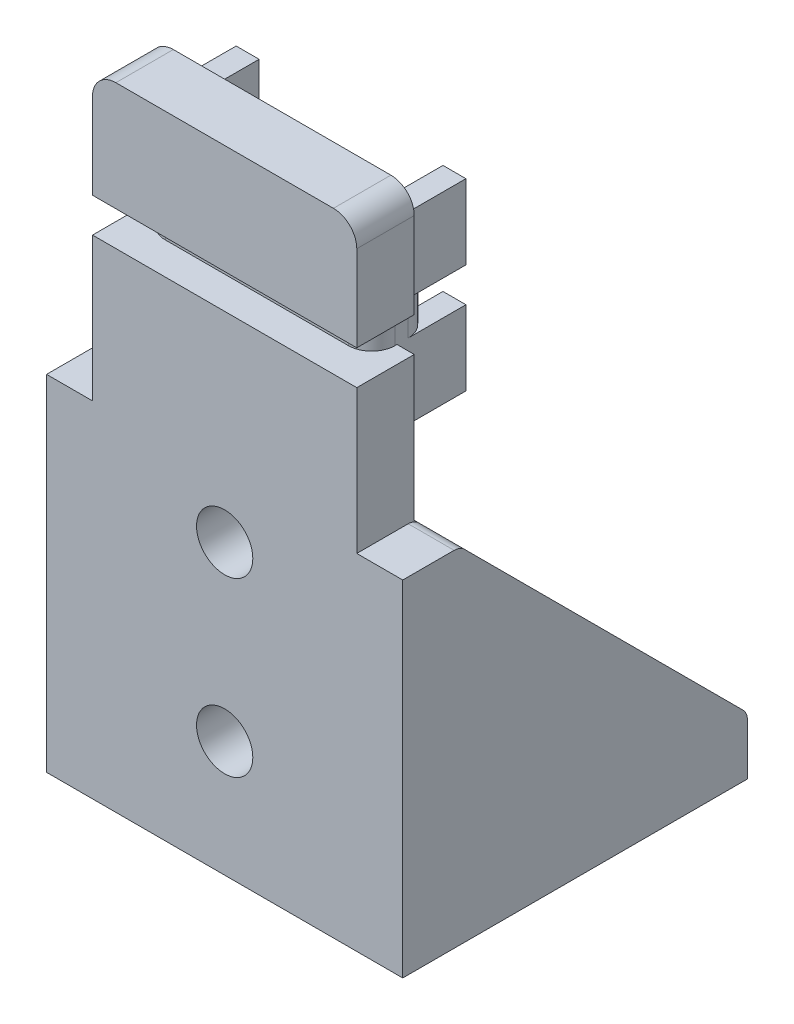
ISO-10303-21;
HEADER;
FILE_DESCRIPTION(('STEP AP214'),'2;1');
FILE_NAME('part.step','',(''),(''),'','','');
FILE_SCHEMA(('AUTOMOTIVE_DESIGN { 1 0 10303 214 1 1 1 1 }'));
ENDSEC;
DATA;
#1=APPLICATION_CONTEXT('core data for automotive mechanical design processes');
#2=APPLICATION_PROTOCOL_DEFINITION('international standard','automotive_design',2000,#1);
#3=PRODUCT_CONTEXT('',#1,'mechanical');
#4=PRODUCT('Part','Part','',(#3));
#5=PRODUCT_RELATED_PRODUCT_CATEGORY('part','',(#4));
#6=PRODUCT_DEFINITION_FORMATION('','',#4);
#7=PRODUCT_DEFINITION_CONTEXT('part definition',#1,'design');
#8=PRODUCT_DEFINITION('design','',#6,#7);
#9=PRODUCT_DEFINITION_SHAPE('','',#8);
#10=(LENGTH_UNIT() NAMED_UNIT(*) SI_UNIT(.MILLI.,.METRE.));
#11=(NAMED_UNIT(*) PLANE_ANGLE_UNIT() SI_UNIT($,.RADIAN.));
#12=(NAMED_UNIT(*) SI_UNIT($,.STERADIAN.) SOLID_ANGLE_UNIT());
#13=UNCERTAINTY_MEASURE_WITH_UNIT(LENGTH_MEASURE(1.E-05),#10,'distance_accuracy_value','');
#14=(GEOMETRIC_REPRESENTATION_CONTEXT(3) GLOBAL_UNCERTAINTY_ASSIGNED_CONTEXT((#13)) GLOBAL_UNIT_ASSIGNED_CONTEXT((#10,
#11,#12)) REPRESENTATION_CONTEXT('',''));
#15=CARTESIAN_POINT('',(0.,0.,0.));
#16=DIRECTION('',(0.,0.,1.));
#17=DIRECTION('',(1.,0.,0.));
#18=AXIS2_PLACEMENT_3D('',#15,#16,#17);
#19=CARTESIAN_POINT('',(0.,0.,-6.));
#20=DIRECTION('',(0.,0.,1.));
#21=DIRECTION('',(1.,0.,0.));
#22=AXIS2_PLACEMENT_3D('',#19,#20,#21);
#23=PLANE('',#22);
#24=DIRECTION('',(0.,-1.,0.));
#25=VECTOR('',#24,1.);
#26=CARTESIAN_POINT('',(-8.,22.,-6.));
#27=LINE('',#26,#25);
#28=CARTESIAN_POINT('',(-8.,22.,-6.));
#29=VERTEX_POINT('',#28);
#30=CARTESIAN_POINT('',(-8.,15.5,-6.));
#31=VERTEX_POINT('',#30);
#32=EDGE_CURVE('E490',#29,#31,#27,.T.);
#33=ORIENTED_EDGE('',*,*,#32,.T.);
#34=DIRECTION('',(1.,0.,0.));
#35=VECTOR('',#34,1.);
#36=CARTESIAN_POINT('',(10.,15.5,-6.));
#37=LINE('',#36,#35);
#38=CARTESIAN_POINT('',(-10.,15.5,-6.));
#39=VERTEX_POINT('',#38);
#40=EDGE_CURVE('E1521',#39,#31,#37,.T.);
#41=ORIENTED_EDGE('',*,*,#40,.F.);
#42=DIRECTION('',(0.,1.,0.));
#43=VECTOR('',#42,1.);
#44=CARTESIAN_POINT('',(-10.,22.,-6.));
#45=LINE('',#44,#43);
#46=CARTESIAN_POINT('',(-10.,22.,-6.));
#47=VERTEX_POINT('',#46);
#48=EDGE_CURVE('E481',#39,#47,#45,.T.);
#49=ORIENTED_EDGE('',*,*,#48,.T.);
#50=DIRECTION('',(1.,0.,0.));
#51=VECTOR('',#50,1.);
#52=CARTESIAN_POINT('',(-10.,22.,-6.));
#53=LINE('',#52,#51);
#54=EDGE_CURVE('E480',#47,#29,#53,.T.);
#55=ORIENTED_EDGE('',*,*,#54,.T.);
#56=EDGE_LOOP('',(#33,#41,#49,#55));
#57=FACE_BOUND('',#56,.T.);
#58=ADVANCED_FACE('F46',(#57),#23,.F.);
#59=CARTESIAN_POINT('',(0.,0.,-6.));
#60=DIRECTION('',(0.,0.,-1.));
#61=DIRECTION('',(-1.,0.,0.));
#62=AXIS2_PLACEMENT_3D('',#59,#60,#61);
#63=PLANE('',#62);
#64=DIRECTION('',(1.,0.,0.));
#65=VECTOR('',#64,1.);
#66=CARTESIAN_POINT('',(0.,15.5,-6.));
#67=LINE('',#66,#65);
#68=CARTESIAN_POINT('',(8.,15.5,-6.));
#69=VERTEX_POINT('',#68);
#70=CARTESIAN_POINT('',(10.,15.5,-6.));
#71=VERTEX_POINT('',#70);
#72=EDGE_CURVE('E547',#69,#71,#67,.T.);
#73=ORIENTED_EDGE('',*,*,#72,.F.);
#74=DIRECTION('',(0.,1.,0.));
#75=VECTOR('',#74,1.);
#76=CARTESIAN_POINT('',(8.,22.,-6.));
#77=LINE('',#76,#75);
#78=CARTESIAN_POINT('',(8.,22.,-6.));
#79=VERTEX_POINT('',#78);
#80=EDGE_CURVE('E585',#69,#79,#77,.T.);
#81=ORIENTED_EDGE('',*,*,#80,.T.);
#82=DIRECTION('',(1.,0.,0.));
#83=VECTOR('',#82,1.);
#84=CARTESIAN_POINT('',(10.,22.,-6.));
#85=LINE('',#84,#83);
#86=CARTESIAN_POINT('',(10.,22.,-6.));
#87=VERTEX_POINT('',#86);
#88=EDGE_CURVE('E581',#79,#87,#85,.T.);
#89=ORIENTED_EDGE('',*,*,#88,.T.);
#90=DIRECTION('',(0.,-1.,0.));
#91=VECTOR('',#90,1.);
#92=CARTESIAN_POINT('',(10.,22.,-6.));
#93=LINE('',#92,#91);
#94=EDGE_CURVE('E573',#87,#71,#93,.T.);
#95=ORIENTED_EDGE('',*,*,#94,.T.);
#96=EDGE_LOOP('',(#73,#81,#89,#95));
#97=FACE_BOUND('',#96,.T.);
#98=ADVANCED_FACE('F578',(#97),#63,.T.);
#99=CARTESIAN_POINT('',(0.,0.,0.));
#100=DIRECTION('',(0.,0.,-1.));
#101=DIRECTION('',(-1.,0.,0.));
#102=AXIS2_PLACEMENT_3D('',#99,#100,#101);
#103=PLANE('',#102);
#104=DIRECTION('',(-1.,0.,0.));
#105=VECTOR('',#104,1.);
#106=CARTESIAN_POINT('',(0.,12.5,0.));
#107=LINE('',#106,#105);
#108=CARTESIAN_POINT('',(11.5,12.5,0.));
#109=VERTEX_POINT('',#108);
#110=CARTESIAN_POINT('',(10.,12.5,0.));
#111=VERTEX_POINT('',#110);
#112=EDGE_CURVE('E991',#109,#111,#107,.T.);
#113=ORIENTED_EDGE('',*,*,#112,.F.);
#114=DIRECTION('',(0.,1.,0.));
#115=VECTOR('',#114,1.);
#116=CARTESIAN_POINT('',(11.5,-25.,0.));
#117=LINE('',#116,#115);
#118=CARTESIAN_POINT('',(11.5,-2.84494650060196E-13,0.));
#119=VERTEX_POINT('',#118);
#120=EDGE_CURVE('E818',#119,#109,#117,.T.);
#121=ORIENTED_EDGE('',*,*,#120,.F.);
#122=DIRECTION('',(-1.,0.,0.));
#123=VECTOR('',#122,1.);
#124=CARTESIAN_POINT('',(11.5,-2.84494650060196E-13,0.));
#125=LINE('',#124,#123);
#126=CARTESIAN_POINT('',(8.96,-2.89401188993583E-13,0.));
#127=VERTEX_POINT('',#126);
#128=EDGE_CURVE('E1378',#119,#127,#125,.T.);
#129=ORIENTED_EDGE('',*,*,#128,.T.);
#130=DIRECTION('',(0.,1.,0.));
#131=VECTOR('',#130,1.);
#132=CARTESIAN_POINT('',(8.96,-25.,0.));
#133=LINE('',#132,#131);
#134=CARTESIAN_POINT('',(8.96,-22.46,0.));
#135=VERTEX_POINT('',#134);
#136=EDGE_CURVE('E1082',#127,#135,#133,.F.);
#137=ORIENTED_EDGE('',*,*,#136,.T.);
#138=DIRECTION('',(1.,0.,0.));
#139=VECTOR('',#138,1.);
#140=CARTESIAN_POINT('',(-11.5,-22.46,0.));
#141=LINE('',#140,#139);
#142=CARTESIAN_POINT('',(4.40748454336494,-22.46,0.));
#143=VERTEX_POINT('',#142);
#144=EDGE_CURVE('E1381',#135,#143,#141,.F.);
#145=ORIENTED_EDGE('',*,*,#144,.T.);
#146=CARTESIAN_POINT('',(1.02025118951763E-13,-19.906,0.));
#147=DIRECTION('',(0.,0.,-1.));
#148=DIRECTION('',(-1.,0.,0.));
#149=AXIS2_PLACEMENT_3D('',#146,#147,#148);
#150=CIRCLE('',#149,5.094);
#151=CARTESIAN_POINT('',(-4.40748454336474,-22.46,0.));
#152=VERTEX_POINT('',#151);
#153=EDGE_CURVE('E1098',#143,#152,#150,.T.);
#154=ORIENTED_EDGE('',*,*,#153,.T.);
#155=CARTESIAN_POINT('',(-8.96,-22.46,0.));
#156=VERTEX_POINT('',#155);
#157=EDGE_CURVE('E1380',#152,#156,#141,.F.);
#158=ORIENTED_EDGE('',*,*,#157,.T.);
#159=DIRECTION('',(0.,1.,0.));
#160=VECTOR('',#159,1.);
#161=CARTESIAN_POINT('',(-8.96,0.,0.));
#162=LINE('',#161,#160);
#163=CARTESIAN_POINT('',(-8.96,-2.89401188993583E-13,0.));
#164=VERTEX_POINT('',#163);
#165=EDGE_CURVE('E1384',#156,#164,#162,.T.);
#166=ORIENTED_EDGE('',*,*,#165,.T.);
#167=DIRECTION('',(-1.,0.,0.));
#168=VECTOR('',#167,1.);
#169=CARTESIAN_POINT('',(-15.5,-2.84494650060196E-13,0.));
#170=LINE('',#169,#168);
#171=CARTESIAN_POINT('',(-11.5,-2.84494650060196E-13,0.));
#172=VERTEX_POINT('',#171);
#173=EDGE_CURVE('E1387',#164,#172,#170,.T.);
#174=ORIENTED_EDGE('',*,*,#173,.T.);
#175=DIRECTION('',(0.,-1.,0.));
#176=VECTOR('',#175,1.);
#177=CARTESIAN_POINT('',(-11.5,-25.,0.));
#178=LINE('',#177,#176);
#179=CARTESIAN_POINT('',(-11.5,12.5,0.));
#180=VERTEX_POINT('',#179);
#181=EDGE_CURVE('E822',#180,#172,#178,.T.);
#182=ORIENTED_EDGE('',*,*,#181,.F.);
#183=DIRECTION('',(-1.,0.,0.));
#184=VECTOR('',#183,1.);
#185=CARTESIAN_POINT('',(0.,12.5,0.));
#186=LINE('',#185,#184);
#187=CARTESIAN_POINT('',(-10.,12.5,0.));
#188=VERTEX_POINT('',#187);
#189=EDGE_CURVE('E1001',#188,#180,#186,.T.);
#190=ORIENTED_EDGE('',*,*,#189,.F.);
#191=DIRECTION('',(0.,1.,0.));
#192=VECTOR('',#191,1.);
#193=CARTESIAN_POINT('',(-10.,22.,0.));
#194=LINE('',#193,#192);
#195=CARTESIAN_POINT('',(-10.,4.73,0.));
#196=VERTEX_POINT('',#195);
#197=EDGE_CURVE('E517',#196,#188,#194,.T.);
#198=ORIENTED_EDGE('',*,*,#197,.F.);
#199=DIRECTION('',(-1.,0.,0.));
#200=VECTOR('',#199,1.);
#201=CARTESIAN_POINT('',(0.,4.73,0.));
#202=LINE('',#201,#200);
#203=CARTESIAN_POINT('',(10.,4.73,0.));
#204=VERTEX_POINT('',#203);
#205=EDGE_CURVE('E845',#196,#204,#202,.F.);
#206=ORIENTED_EDGE('',*,*,#205,.T.);
#207=DIRECTION('',(0.,-1.,0.));
#208=VECTOR('',#207,1.);
#209=CARTESIAN_POINT('',(10.,22.,0.));
#210=LINE('',#209,#208);
#211=EDGE_CURVE('E512',#111,#204,#210,.T.);
#212=ORIENTED_EDGE('',*,*,#211,.F.);
#213=EDGE_LOOP('',(#113,#121,#129,#137,#145,#154,#158,#166,#174,#182,#190,#198,#206,#212));
#214=FACE_BOUND('',#213,.T.);
#215=CARTESIAN_POINT('',(1.02025118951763E-13,-19.906,0.));
#216=DIRECTION('',(0.,0.,1.));
#217=DIRECTION('',(1.,0.,0.));
#218=AXIS2_PLACEMENT_3D('',#215,#216,#217);
#219=CIRCLE('',#218,2.45);
#220=CARTESIAN_POINT('',(2.4500000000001,-19.906,0.));
#221=VERTEX_POINT('',#220);
#222=EDGE_CURVE('E802',#221,#221,#219,.T.);
#223=ORIENTED_EDGE('',*,*,#222,.T.);
#224=EDGE_LOOP('',(#223));
#225=FACE_BOUND('',#224,.T.);
#226=CARTESIAN_POINT('',(0.,-4.906,0.));
#227=DIRECTION('',(0.,0.,1.));
#228=DIRECTION('',(1.,0.,0.));
#229=AXIS2_PLACEMENT_3D('',#226,#227,#228);
#230=CIRCLE('',#229,2.45);
#231=CARTESIAN_POINT('',(2.44999999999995,-4.906,0.));
#232=VERTEX_POINT('',#231);
#233=EDGE_CURVE('E806',#232,#232,#230,.T.);
#234=ORIENTED_EDGE('',*,*,#233,.T.);
#235=EDGE_LOOP('',(#234));
#236=FACE_BOUND('',#235,.T.);
#237=ADVANCED_FACE('F716',(#214,#225,#236),#103,.T.);
#238=CARTESIAN_POINT('',(11.5,-25.,5.));
#239=DIRECTION('',(-1.,0.,0.));
#240=DIRECTION('',(0.,0.,1.));
#241=AXIS2_PLACEMENT_3D('',#238,#239,#240);
#242=PLANE('',#241);
#243=ORIENTED_EDGE('',*,*,#120,.T.);
#244=DIRECTION('',(0.,0.,1.));
#245=VECTOR('',#244,1.);
#246=CARTESIAN_POINT('',(11.5,12.5,5.));
#247=LINE('',#246,#245);
#248=CARTESIAN_POINT('',(11.5,12.5,5.));
#249=VERTEX_POINT('',#248);
#250=EDGE_CURVE('E1016',#109,#249,#247,.T.);
#251=ORIENTED_EDGE('',*,*,#250,.T.);
#252=DIRECTION('',(0.,1.,0.));
#253=VECTOR('',#252,1.);
#254=CARTESIAN_POINT('',(11.5,-25.,5.));
#255=LINE('',#254,#253);
#256=CARTESIAN_POINT('',(11.5,-2.84494650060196E-13,5.));
#257=VERTEX_POINT('',#256);
#258=EDGE_CURVE('E817',#257,#249,#255,.T.);
#259=ORIENTED_EDGE('',*,*,#258,.F.);
#260=DIRECTION('',(0.,0.,1.));
#261=VECTOR('',#260,1.);
#262=CARTESIAN_POINT('',(11.5,-2.84494650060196E-13,0.));
#263=LINE('',#262,#261);
#264=CARTESIAN_POINT('',(11.5,-2.84494650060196E-13,0.526051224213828));
#265=VERTEX_POINT('',#264);
#266=EDGE_CURVE('E1051',#265,#257,#263,.T.);
#267=ORIENTED_EDGE('',*,*,#266,.F.);
#268=CARTESIAN_POINT('',(11.5,-1.27000000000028,0.526051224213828));
#269=DIRECTION('',(-1.,0.,0.));
#270=DIRECTION('',(0.,0.,1.));
#271=AXIS2_PLACEMENT_3D('',#268,#269,#270);
#272=CIRCLE('',#271,1.27);
#273=CARTESIAN_POINT('',(11.5,-0.371974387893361,-0.371974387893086));
#274=VERTEX_POINT('',#273);
#275=EDGE_CURVE('E1257',#265,#274,#272,.T.);
#276=ORIENTED_EDGE('',*,*,#275,.T.);
#277=DIRECTION('',(0.,-0.707106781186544,-0.707106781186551));
#278=VECTOR('',#277,1.);
#279=CARTESIAN_POINT('',(11.5,-10.,-9.99999999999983));
#280=LINE('',#279,#278);
#281=EDGE_CURVE('E1335',#119,#274,#280,.T.);
#282=ORIENTED_EDGE('',*,*,#281,.F.);
#283=EDGE_LOOP('',(#243,#251,#259,#267,#276,#282));
#284=FACE_BOUND('',#283,.T.);
#285=ADVANCED_FACE('F1197',(#284),#242,.F.);
#286=CARTESIAN_POINT('',(-11.5,-25.,5.));
#287=DIRECTION('',(1.,0.,0.));
#288=DIRECTION('',(0.,0.,-1.));
#289=AXIS2_PLACEMENT_3D('',#286,#287,#288);
#290=PLANE('',#289);
#291=DIRECTION('',(0.,0.,1.));
#292=VECTOR('',#291,1.);
#293=CARTESIAN_POINT('',(-11.5,12.5,2.2));
#294=LINE('',#293,#292);
#295=CARTESIAN_POINT('',(-11.5,12.5,5.));
#296=VERTEX_POINT('',#295);
#297=EDGE_CURVE('E1004',#180,#296,#294,.T.);
#298=ORIENTED_EDGE('',*,*,#297,.F.);
#299=ORIENTED_EDGE('',*,*,#181,.T.);
#300=DIRECTION('',(0.,0.707106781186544,0.707106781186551));
#301=VECTOR('',#300,1.);
#302=CARTESIAN_POINT('',(-11.5,-10.,-9.99999999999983));
#303=LINE('',#302,#301);
#304=CARTESIAN_POINT('',(-11.5,-0.371974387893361,-0.371974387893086));
#305=VERTEX_POINT('',#304);
#306=EDGE_CURVE('E1277',#305,#172,#303,.T.);
#307=ORIENTED_EDGE('',*,*,#306,.F.);
#308=CARTESIAN_POINT('',(-11.5,-1.27000000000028,0.526051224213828));
#309=DIRECTION('',(1.,0.,0.));
#310=DIRECTION('',(0.,0.,-1.));
#311=AXIS2_PLACEMENT_3D('',#308,#309,#310);
#312=CIRCLE('',#311,1.27);
#313=CARTESIAN_POINT('',(-11.5,-2.84494650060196E-13,0.526051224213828));
#314=VERTEX_POINT('',#313);
#315=EDGE_CURVE('E1031',#305,#314,#312,.T.);
#316=ORIENTED_EDGE('',*,*,#315,.T.);
#317=DIRECTION('',(0.,0.,1.));
#318=VECTOR('',#317,1.);
#319=CARTESIAN_POINT('',(-11.5,-2.84494650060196E-13,0.));
#320=LINE('',#319,#318);
#321=CARTESIAN_POINT('',(-11.5,-2.84494650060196E-13,5.));
#322=VERTEX_POINT('',#321);
#323=EDGE_CURVE('E1030',#314,#322,#320,.T.);
#324=ORIENTED_EDGE('',*,*,#323,.T.);
#325=DIRECTION('',(0.,-1.,0.));
#326=VECTOR('',#325,1.);
#327=CARTESIAN_POINT('',(-11.5,-25.,5.));
#328=LINE('',#327,#326);
#329=EDGE_CURVE('E518',#296,#322,#328,.T.);
#330=ORIENTED_EDGE('',*,*,#329,.F.);
#331=EDGE_LOOP('',(#298,#299,#307,#316,#324,#330));
#332=FACE_BOUND('',#331,.T.);
#333=ADVANCED_FACE('F1028',(#332),#290,.F.);
#334=CARTESIAN_POINT('',(0.,-30.,0.));
#335=DIRECTION('',(0.,1.,0.));
#336=DIRECTION('',(0.,0.,1.));
#337=AXIS2_PLACEMENT_3D('',#334,#335,#336);
#338=PLANE('',#337);
#339=DIRECTION('',(1.,0.,0.));
#340=VECTOR('',#339,1.);
#341=CARTESIAN_POINT('',(-15.5,-30.,-25.));
#342=LINE('',#341,#340);
#343=CARTESIAN_POINT('',(-6.71037122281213,-30.,-25.));
#344=VERTEX_POINT('',#343);
#345=CARTESIAN_POINT('',(6.72437122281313,-30.,-25.));
#346=VERTEX_POINT('',#345);
#347=EDGE_CURVE('E790',#344,#346,#342,.T.);
#348=ORIENTED_EDGE('',*,*,#347,.T.);
#349=CARTESIAN_POINT('',(7.5,-30.,-17.5));
#350=DIRECTION('',(0.,1.,0.));
#351=DIRECTION('',(0.,0.,1.));
#352=AXIS2_PLACEMENT_3D('',#349,#350,#351);
#353=CIRCLE('',#352,7.54000000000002);
#354=CARTESIAN_POINT('',(0.007000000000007,-30.,-18.340565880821));
#355=VERTEX_POINT('',#354);
#356=EDGE_CURVE('E870',#346,#355,#353,.T.);
#357=ORIENTED_EDGE('',*,*,#356,.T.);
#358=CARTESIAN_POINT('',(-7.486,-30.,-17.5000000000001));
#359=DIRECTION('',(0.,1.,0.));
#360=DIRECTION('',(0.,0.,1.));
#361=AXIS2_PLACEMENT_3D('',#358,#359,#360);
#362=CIRCLE('',#361,7.54000000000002);
#363=EDGE_CURVE('E868',#355,#344,#362,.T.);
#364=ORIENTED_EDGE('',*,*,#363,.T.);
#365=EDGE_LOOP('',(#348,#357,#364));
#366=FACE_BOUND('',#365,.T.);
#367=ADVANCED_FACE('F1408',(#366),#338,.F.);
#368=CARTESIAN_POINT('',(0.,0.,5.));
#369=DIRECTION('',(0.,0.,-1.));
#370=DIRECTION('',(-1.,0.,0.));
#371=AXIS2_PLACEMENT_3D('',#368,#369,#370);
#372=PLANE('',#371);
#373=CARTESIAN_POINT('',(1.02025118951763E-13,-19.906,5.));
#374=DIRECTION('',(0.,0.,1.));
#375=DIRECTION('',(1.,0.,0.));
#376=AXIS2_PLACEMENT_3D('',#373,#374,#375);
#377=CIRCLE('',#376,2.45);
#378=CARTESIAN_POINT('',(2.4500000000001,-19.906,5.));
#379=VERTEX_POINT('',#378);
#380=EDGE_CURVE('E803',#379,#379,#377,.T.);
#381=ORIENTED_EDGE('',*,*,#380,.F.);
#382=EDGE_LOOP('',(#381));
#383=FACE_BOUND('',#382,.T.);
#384=CARTESIAN_POINT('',(0.,-4.906,5.));
#385=DIRECTION('',(0.,0.,1.));
#386=DIRECTION('',(1.,0.,0.));
#387=AXIS2_PLACEMENT_3D('',#384,#385,#386);
#388=CIRCLE('',#387,2.45);
#389=CARTESIAN_POINT('',(2.44999999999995,-4.906,5.));
#390=VERTEX_POINT('',#389);
#391=EDGE_CURVE('E809',#390,#390,#388,.T.);
#392=ORIENTED_EDGE('',*,*,#391,.F.);
#393=EDGE_LOOP('',(#392));
#394=FACE_BOUND('',#393,.T.);
#395=ORIENTED_EDGE('',*,*,#258,.T.);
#396=DIRECTION('',(-1.,0.,0.));
#397=VECTOR('',#396,1.);
#398=CARTESIAN_POINT('',(0.,12.5,5.));
#399=LINE('',#398,#397);
#400=EDGE_CURVE('E589',#249,#296,#399,.T.);
#401=ORIENTED_EDGE('',*,*,#400,.T.);
#402=ORIENTED_EDGE('',*,*,#329,.T.);
#403=DIRECTION('',(1.,0.,0.));
#404=VECTOR('',#403,1.);
#405=CARTESIAN_POINT('',(-15.5,-2.84494650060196E-13,5.));
#406=LINE('',#405,#404);
#407=CARTESIAN_POINT('',(-15.5,-2.84494650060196E-13,5.));
#408=VERTEX_POINT('',#407);
#409=EDGE_CURVE('E1045',#408,#322,#406,.T.);
#410=ORIENTED_EDGE('',*,*,#409,.F.);
#411=DIRECTION('',(0.,1.,0.));
#412=VECTOR('',#411,1.);
#413=CARTESIAN_POINT('',(-15.5,-30.,5.));
#414=LINE('',#413,#412);
#415=CARTESIAN_POINT('',(-15.5,-30.,5.));
#416=VERTEX_POINT('',#415);
#417=EDGE_CURVE('E796',#416,#408,#414,.T.);
#418=ORIENTED_EDGE('',*,*,#417,.F.);
#419=DIRECTION('',(-1.,0.,0.));
#420=VECTOR('',#419,1.);
#421=CARTESIAN_POINT('',(-15.5,-30.,5.));
#422=LINE('',#421,#420);
#423=CARTESIAN_POINT('',(15.5,-30.,5.));
#424=VERTEX_POINT('',#423);
#425=EDGE_CURVE('E781',#424,#416,#422,.T.);
#426=ORIENTED_EDGE('',*,*,#425,.F.);
#427=DIRECTION('',(0.,1.,0.));
#428=VECTOR('',#427,1.);
#429=CARTESIAN_POINT('',(15.5,-30.,5.));
#430=LINE('',#429,#428);
#431=CARTESIAN_POINT('',(15.5,-2.84494650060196E-13,5.));
#432=VERTEX_POINT('',#431);
#433=EDGE_CURVE('E799',#424,#432,#430,.T.);
#434=ORIENTED_EDGE('',*,*,#433,.T.);
#435=DIRECTION('',(1.,0.,0.));
#436=VECTOR('',#435,1.);
#437=CARTESIAN_POINT('',(11.5,-2.84494650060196E-13,5.));
#438=LINE('',#437,#436);
#439=EDGE_CURVE('E775',#257,#432,#438,.T.);
#440=ORIENTED_EDGE('',*,*,#439,.F.);
#441=EDGE_LOOP('',(#395,#401,#402,#410,#418,#426,#434,#440));
#442=FACE_BOUND('',#441,.T.);
#443=ADVANCED_FACE('F733',(#383,#394,#442),#372,.F.);
#444=CARTESIAN_POINT('',(0.,0.,-2.));
#445=DIRECTION('',(0.,0.,1.));
#446=DIRECTION('',(1.,0.,0.));
#447=AXIS2_PLACEMENT_3D('',#444,#445,#446);
#448=PLANE('',#447);
#449=DIRECTION('',(0.,1.,0.));
#450=VECTOR('',#449,1.);
#451=CARTESIAN_POINT('',(8.,22.,-2.));
#452=LINE('',#451,#450);
#453=CARTESIAN_POINT('',(8.,6.,-2.));
#454=VERTEX_POINT('',#453);
#455=CARTESIAN_POINT('',(8.,22.,-2.));
#456=VERTEX_POINT('',#455);
#457=EDGE_CURVE('E587',#454,#456,#452,.T.);
#458=ORIENTED_EDGE('',*,*,#457,.F.);
#459=DIRECTION('',(-1.,0.,0.));
#460=VECTOR('',#459,1.);
#461=CARTESIAN_POINT('',(-10.,6.,-2.));
#462=LINE('',#461,#460);
#463=CARTESIAN_POINT('',(-8.,6.,-2.));
#464=VERTEX_POINT('',#463);
#465=EDGE_CURVE('E515',#454,#464,#462,.T.);
#466=ORIENTED_EDGE('',*,*,#465,.T.);
#467=DIRECTION('',(0.,-1.,0.));
#468=VECTOR('',#467,1.);
#469=CARTESIAN_POINT('',(-8.,22.,-2.));
#470=LINE('',#469,#468);
#471=CARTESIAN_POINT('',(-8.,22.,-2.));
#472=VERTEX_POINT('',#471);
#473=EDGE_CURVE('E485',#472,#464,#470,.T.);
#474=ORIENTED_EDGE('',*,*,#473,.F.);
#475=DIRECTION('',(1.,0.,0.));
#476=VECTOR('',#475,1.);
#477=CARTESIAN_POINT('',(-10.,22.,-2.));
#478=LINE('',#477,#476);
#479=EDGE_CURVE('E503',#472,#456,#478,.T.);
#480=ORIENTED_EDGE('',*,*,#479,.T.);
#481=EDGE_LOOP('',(#458,#466,#474,#480));
#482=FACE_BOUND('',#481,.T.);
#483=ADVANCED_FACE('F614',(#482),#448,.F.);
#484=DIRECTION('',(-1.,0.,0.));
#485=VECTOR('',#484,1.);
#486=CARTESIAN_POINT('',(-11.5,25.,0.));
#487=LINE('',#486,#485);
#488=CARTESIAN_POINT('',(9.468,25.,0.));
#489=VERTEX_POINT('',#488);
#490=CARTESIAN_POINT('',(-9.468,25.,0.));
#491=VERTEX_POINT('',#490);
#492=EDGE_CURVE('E820',#489,#491,#487,.T.);
#493=ORIENTED_EDGE('',*,*,#492,.F.);
#494=CARTESIAN_POINT('',(9.468,22.968,0.));
#495=DIRECTION('',(0.,0.,-1.));
#496=DIRECTION('',(-1.,0.,0.));
#497=AXIS2_PLACEMENT_3D('',#494,#495,#496);
#498=CIRCLE('',#497,2.032);
#499=CARTESIAN_POINT('',(11.5,22.968,0.));
#500=VERTEX_POINT('',#499);
#501=EDGE_CURVE('E1204',#489,#500,#498,.T.);
#502=ORIENTED_EDGE('',*,*,#501,.T.);
#503=CARTESIAN_POINT('',(11.5,15.5,0.));
#504=VERTEX_POINT('',#503);
#505=EDGE_CURVE('E812',#504,#500,#117,.T.);
#506=ORIENTED_EDGE('',*,*,#505,.F.);
#507=DIRECTION('',(1.,0.,0.));
#508=VECTOR('',#507,1.);
#509=CARTESIAN_POINT('',(0.,15.5,0.));
#510=LINE('',#509,#508);
#511=CARTESIAN_POINT('',(10.,15.5,0.));
#512=VERTEX_POINT('',#511);
#513=EDGE_CURVE('E986',#512,#504,#510,.T.);
#514=ORIENTED_EDGE('',*,*,#513,.F.);
#515=CARTESIAN_POINT('',(10.,23.27,0.));
#516=VERTEX_POINT('',#515);
#517=EDGE_CURVE('E1216',#516,#512,#210,.T.);
#518=ORIENTED_EDGE('',*,*,#517,.F.);
#519=DIRECTION('',(1.,0.,0.));
#520=VECTOR('',#519,1.);
#521=CARTESIAN_POINT('',(0.,23.27,0.));
#522=LINE('',#521,#520);
#523=CARTESIAN_POINT('',(-10.,23.27,0.));
#524=VERTEX_POINT('',#523);
#525=EDGE_CURVE('E848',#516,#524,#522,.F.);
#526=ORIENTED_EDGE('',*,*,#525,.T.);
#527=CARTESIAN_POINT('',(-10.,15.5,0.));
#528=VERTEX_POINT('',#527);
#529=EDGE_CURVE('E1220',#528,#524,#194,.T.);
#530=ORIENTED_EDGE('',*,*,#529,.F.);
#531=DIRECTION('',(1.,0.,0.));
#532=VECTOR('',#531,1.);
#533=CARTESIAN_POINT('',(0.,15.5,0.));
#534=LINE('',#533,#532);
#535=CARTESIAN_POINT('',(-11.5,15.5,0.));
#536=VERTEX_POINT('',#535);
#537=EDGE_CURVE('E997',#536,#528,#534,.T.);
#538=ORIENTED_EDGE('',*,*,#537,.F.);
#539=CARTESIAN_POINT('',(-11.5,22.968,0.));
#540=VERTEX_POINT('',#539);
#541=EDGE_CURVE('E529',#540,#536,#178,.T.);
#542=ORIENTED_EDGE('',*,*,#541,.F.);
#543=CARTESIAN_POINT('',(-9.468,22.968,0.));
#544=DIRECTION('',(0.,0.,-1.));
#545=DIRECTION('',(-1.,0.,0.));
#546=AXIS2_PLACEMENT_3D('',#543,#544,#545);
#547=CIRCLE('',#546,2.032);
#548=EDGE_CURVE('E1205',#540,#491,#547,.T.);
#549=ORIENTED_EDGE('',*,*,#548,.T.);
#550=EDGE_LOOP('',(#493,#502,#506,#514,#518,#526,#530,#538,#542,#549));
#551=FACE_BOUND('',#550,.T.);
#552=ADVANCED_FACE('F732',(#551),#103,.T.);
#553=CARTESIAN_POINT('',(-7.486,-30.,-17.5000000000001));
#554=DIRECTION('',(0.,1.,0.));
#555=DIRECTION('',(0.,0.,1.));
#556=AXIS2_PLACEMENT_3D('',#553,#554,#555);
#557=CIRCLE('',#556,7.54000000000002);
#558=CARTESIAN_POINT('',(-8.26162877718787,-30.,-25.));
#559=VERTEX_POINT('',#558);
#560=CARTESIAN_POINT('',(0.00699999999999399,-30.,-16.6594341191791));
#561=VERTEX_POINT('',#560);
#562=EDGE_CURVE('E863',#559,#561,#557,.T.);
#563=ORIENTED_EDGE('',*,*,#562,.T.);
#564=CARTESIAN_POINT('',(7.5,-30.,-17.5));
#565=DIRECTION('',(0.,1.,0.));
#566=DIRECTION('',(0.,0.,1.));
#567=AXIS2_PLACEMENT_3D('',#564,#565,#566);
#568=CIRCLE('',#567,7.54000000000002);
#569=CARTESIAN_POINT('',(8.27562877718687,-30.,-25.));
#570=VERTEX_POINT('',#569);
#571=EDGE_CURVE('E865',#561,#570,#568,.T.);
#572=ORIENTED_EDGE('',*,*,#571,.T.);
#573=CARTESIAN_POINT('',(15.5,-30.,-25.));
#574=VERTEX_POINT('',#573);
#575=EDGE_CURVE('E785',#570,#574,#342,.T.);
#576=ORIENTED_EDGE('',*,*,#575,.T.);
#577=DIRECTION('',(0.,0.,1.));
#578=VECTOR('',#577,1.);
#579=CARTESIAN_POINT('',(15.5,-30.,-25.));
#580=LINE('',#579,#578);
#581=EDGE_CURVE('E771',#574,#424,#580,.T.);
#582=ORIENTED_EDGE('',*,*,#581,.T.);
#583=ORIENTED_EDGE('',*,*,#425,.T.);
#584=DIRECTION('',(0.,0.,-1.));
#585=VECTOR('',#584,1.);
#586=CARTESIAN_POINT('',(-15.5,-30.,-25.));
#587=LINE('',#586,#585);
#588=CARTESIAN_POINT('',(-15.5,-30.,-25.));
#589=VERTEX_POINT('',#588);
#590=EDGE_CURVE('E783',#416,#589,#587,.T.);
#591=ORIENTED_EDGE('',*,*,#590,.T.);
#592=EDGE_CURVE('E786',#589,#559,#342,.T.);
#593=ORIENTED_EDGE('',*,*,#592,.T.);
#594=EDGE_LOOP('',(#563,#572,#576,#582,#583,#591,#593));
#595=FACE_BOUND('',#594,.T.);
#596=ADVANCED_FACE('F1163',(#595),#338,.F.);
#597=CARTESIAN_POINT('',(-7.5,-30.,-17.5000000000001));
#598=DIRECTION('',(0.,-1.,0.));
#599=DIRECTION('',(0.,0.,-1.));
#600=AXIS2_PLACEMENT_3D('',#597,#598,#599);
#601=CIRCLE('',#600,2.5);
#602=CARTESIAN_POINT('',(-7.49300000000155,-30.,-19.9999901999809));
#603=VERTEX_POINT('',#602);
#604=CARTESIAN_POINT('',(-7.49299999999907,-30.,-15.0000098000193));
#605=VERTEX_POINT('',#604);
#606=EDGE_CURVE('E760',#603,#605,#601,.T.);
#607=ORIENTED_EDGE('',*,*,#606,.F.);
#608=CARTESIAN_POINT('',(-7.486,-30.,-17.5000000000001));
#609=DIRECTION('',(0.,-1.,0.));
#610=DIRECTION('',(0.,0.,-1.));
#611=AXIS2_PLACEMENT_3D('',#608,#609,#610);
#612=CIRCLE('',#611,2.5);
#613=EDGE_CURVE('E636',#603,#605,#612,.T.);
#614=ORIENTED_EDGE('',*,*,#613,.T.);
#615=EDGE_LOOP('',(#607,#614));
#616=FACE_BOUND('',#615,.T.);
#617=ADVANCED_FACE('F766',(#616),#338,.F.);
#618=CARTESIAN_POINT('',(-15.5,-25.,-25.));
#619=DIRECTION('',(0.,0.707106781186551,-0.707106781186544));
#620=DIRECTION('',(0.,0.707106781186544,0.707106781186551));
#621=AXIS2_PLACEMENT_3D('',#618,#619,#620);
#622=PLANE('',#621);
#623=DIRECTION('',(0.,0.707106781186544,0.707106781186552));
#624=VECTOR('',#623,1.);
#625=CARTESIAN_POINT('',(-15.5,-25.,-25.));
#626=LINE('',#625,#624);
#627=CARTESIAN_POINT('',(-15.5,-24.6280256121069,-24.6280256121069));
#628=VERTEX_POINT('',#627);
#629=CARTESIAN_POINT('',(-15.5,-0.371974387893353,-0.371974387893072));
#630=VERTEX_POINT('',#629);
#631=EDGE_CURVE('E1034',#628,#630,#626,.T.);
#632=ORIENTED_EDGE('',*,*,#631,.T.);
#633=DIRECTION('',(1.,0.,0.));
#634=VECTOR('',#633,1.);
#635=CARTESIAN_POINT('',(-15.5,-0.371974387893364,-0.371974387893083));
#636=LINE('',#635,#634);
#637=EDGE_CURVE('E1274',#630,#305,#636,.T.);
#638=ORIENTED_EDGE('',*,*,#637,.T.);
#639=ORIENTED_EDGE('',*,*,#306,.T.);
#640=ORIENTED_EDGE('',*,*,#173,.F.);
#641=CARTESIAN_POINT('',(-8.96,-2.54000000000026,-2.54));
#642=DIRECTION('',(0.,0.707106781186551,-0.707106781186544));
#643=DIRECTION('',(0.,0.707106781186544,0.707106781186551));
#644=AXIS2_PLACEMENT_3D('',#641,#642,#643);
#645=ELLIPSE('',#644,3.59210244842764,2.54);
#646=CARTESIAN_POINT('',(-11.5,-2.54000000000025,-2.53999999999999));
#647=VERTEX_POINT('',#646);
#648=EDGE_CURVE('E1084',#164,#647,#645,.F.);
#649=ORIENTED_EDGE('',*,*,#648,.T.);
#650=DIRECTION('',(0.,0.707106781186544,0.707106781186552));
#651=VECTOR('',#650,1.);
#652=CARTESIAN_POINT('',(-11.5,-25.,-25.));
#653=LINE('',#652,#651);
#654=CARTESIAN_POINT('',(-11.5,-13.7399728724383,-13.7399728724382));
#655=VERTEX_POINT('',#654);
#656=EDGE_CURVE('E1041',#655,#647,#653,.T.);
#657=ORIENTED_EDGE('',*,*,#656,.F.);
#658=CARTESIAN_POINT('',(-7.486,-17.5,-17.4999999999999));
#659=DIRECTION('',(0.,0.707106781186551,-0.707106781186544));
#660=DIRECTION('',(0.,-0.707106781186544,-0.707106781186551));
#661=AXIS2_PLACEMENT_3D('',#658,#659,#660);
#662=ELLIPSE('',#661,7.77817459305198,5.5);
#663=CARTESIAN_POINT('',(-11.5,-21.2600271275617,-21.2600271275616));
#664=VERTEX_POINT('',#663);
#665=EDGE_CURVE('E649',#655,#664,#662,.F.);
#666=ORIENTED_EDGE('',*,*,#665,.T.);
#667=CARTESIAN_POINT('',(-11.5,-22.46,-22.46));
#668=VERTEX_POINT('',#667);
#669=EDGE_CURVE('E1035',#668,#664,#653,.T.);
#670=ORIENTED_EDGE('',*,*,#669,.F.);
#671=CARTESIAN_POINT('',(-8.96,-22.46,-22.46));
#672=DIRECTION('',(0.,0.707106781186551,-0.707106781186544));
#673=DIRECTION('',(0.,-0.707106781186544,-0.707106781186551));
#674=AXIS2_PLACEMENT_3D('',#671,#672,#673);
#675=ELLIPSE('',#674,3.59210244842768,2.54);
#676=CARTESIAN_POINT('',(-11.1597045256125,-23.73,-23.73));
#677=VERTEX_POINT('',#676);
#678=EDGE_CURVE('E1390',#668,#677,#675,.F.);
#679=ORIENTED_EDGE('',*,*,#678,.T.);
#680=CARTESIAN_POINT('',(-11.1597045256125,-23.73,-23.73));
#681=CARTESIAN_POINT('',(-11.1382422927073,-23.7672328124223,-23.7672328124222));
#682=CARTESIAN_POINT('',(-11.1172608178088,-23.8046103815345,-23.8046103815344));
#683=CARTESIAN_POINT('',(-11.0765638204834,-23.879772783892,-23.879772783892));
#684=CARTESIAN_POINT('',(-11.0568502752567,-23.9175581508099,-23.9175581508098));
#685=CARTESIAN_POINT('',(-11.0183501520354,-23.994970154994,-23.994970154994));
#686=CARTESIAN_POINT('',(-10.9996263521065,-24.0346125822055,-24.0346125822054));
#687=CARTESIAN_POINT('',(-10.9646863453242,-24.1144282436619,-24.1144282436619));
#688=CARTESIAN_POINT('',(-10.9484685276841,-24.1546011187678,-24.1546011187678));
#689=CARTESIAN_POINT('',(-10.9172946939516,-24.2423842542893,-24.2423842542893));
#690=CARTESIAN_POINT('',(-10.9030018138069,-24.2901160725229,-24.2901160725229));
#691=CARTESIAN_POINT('',(-10.8827912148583,-24.3859457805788,-24.3859457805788));
#692=CARTESIAN_POINT('',(-10.8767591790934,-24.434029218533,-24.434029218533));
#693=CARTESIAN_POINT('',(-10.8777677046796,-24.506553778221,-24.506553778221));
#694=CARTESIAN_POINT('',(-10.8798392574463,-24.5309961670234,-24.5309961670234));
#695=CARTESIAN_POINT('',(-10.8883622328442,-24.5797718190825,-24.5797718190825));
#696=CARTESIAN_POINT('',(-10.8948645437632,-24.6041004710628,-24.6041004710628));
#697=CARTESIAN_POINT('',(-10.9040318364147,-24.6280256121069,-24.6280256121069));
#698=B_SPLINE_CURVE_WITH_KNOTS('',3,(#680,#681,#682,#683,#684,#685,#686,#687,#688,#689,#690,
#691,#692,#693,#694,#695,#696,#697),.UNSPECIFIED.,.F.,.F.,(4,2,2,2,2,2,2,2,4),(0.,
0.170593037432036,0.34144595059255,0.518726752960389,0.695893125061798,0.902649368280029,
1.10651449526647,1.21015138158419,1.31499908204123),.UNSPECIFIED.);
#699=CARTESIAN_POINT('',(-10.9040318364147,-24.6280256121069,-24.6280256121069));
#700=VERTEX_POINT('',#699);
#701=EDGE_CURVE('E1279',#677,#700,#698,.T.);
#702=ORIENTED_EDGE('',*,*,#701,.T.);
#703=DIRECTION('',(1.,0.,0.));
#704=VECTOR('',#703,1.);
#705=CARTESIAN_POINT('',(-15.5,-24.6280256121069,-24.6280256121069));
#706=LINE('',#705,#704);
#707=EDGE_CURVE('E1285',#700,#628,#706,.F.);
#708=ORIENTED_EDGE('',*,*,#707,.T.);
#709=EDGE_LOOP('',(#632,#638,#639,#640,#649,#657,#666,#670,#679,#702,#708));
#710=FACE_BOUND('',#709,.T.);
#711=ADVANCED_FACE('F1287',(#710),#622,.T.);
#712=CARTESIAN_POINT('',(-11.5,0.,0.));
#713=DIRECTION('',(-1.,0.,0.));
#714=DIRECTION('',(0.,0.,1.));
#715=AXIS2_PLACEMENT_3D('',#712,#713,#714);
#716=PLANE('',#715);
#717=DIRECTION('',(0.,-1.,0.));
#718=VECTOR('',#717,1.);
#719=CARTESIAN_POINT('',(-11.5,-10.84,-21.2600271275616));
#720=LINE('',#719,#718);
#721=CARTESIAN_POINT('',(-11.5,-22.46,-21.2600271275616));
#722=VERTEX_POINT('',#721);
#723=EDGE_CURVE('E652',#722,#664,#720,.F.);
#724=ORIENTED_EDGE('',*,*,#723,.F.);
#725=DIRECTION('',(0.,0.,-1.));
#726=VECTOR('',#725,1.);
#727=CARTESIAN_POINT('',(-11.5,-22.46,0.));
#728=LINE('',#727,#726);
#729=EDGE_CURVE('E2001',#722,#668,#728,.T.);
#730=ORIENTED_EDGE('',*,*,#729,.T.);
#731=ORIENTED_EDGE('',*,*,#669,.T.);
#732=EDGE_LOOP('',(#724,#730,#731));
#733=FACE_BOUND('',#732,.T.);
#734=ADVANCED_FACE('F1292',(#733),#716,.F.);
#735=DIRECTION('',(0.,-1.,0.));
#736=VECTOR('',#735,1.);
#737=CARTESIAN_POINT('',(-11.5,-10.84,-13.7399728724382));
#738=LINE('',#737,#736);
#739=CARTESIAN_POINT('',(-11.5,-22.46,-13.7399728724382));
#740=VERTEX_POINT('',#739);
#741=EDGE_CURVE('E647',#655,#740,#738,.T.);
#742=ORIENTED_EDGE('',*,*,#741,.F.);
#743=ORIENTED_EDGE('',*,*,#656,.T.);
#744=DIRECTION('',(0.,1.,0.));
#745=VECTOR('',#744,1.);
#746=CARTESIAN_POINT('',(-11.5,0.,-2.54));
#747=LINE('',#746,#745);
#748=CARTESIAN_POINT('',(-11.5,-22.46,-2.54));
#749=VERTEX_POINT('',#748);
#750=EDGE_CURVE('E537',#647,#749,#747,.F.);
#751=ORIENTED_EDGE('',*,*,#750,.T.);
#752=DIRECTION('',(0.,0.,-1.));
#753=VECTOR('',#752,1.);
#754=CARTESIAN_POINT('',(-11.5,-22.46,0.));
#755=LINE('',#754,#753);
#756=EDGE_CURVE('E2000',#749,#740,#755,.T.);
#757=ORIENTED_EDGE('',*,*,#756,.T.);
#758=EDGE_LOOP('',(#742,#743,#751,#757));
#759=FACE_BOUND('',#758,.T.);
#760=ADVANCED_FACE('F1726',(#759),#716,.F.);
#761=CARTESIAN_POINT('',(-8.96,-22.46,0.));
#762=DIRECTION('',(0.,0.,-1.));
#763=DIRECTION('',(-1.,0.,0.));
#764=AXIS2_PLACEMENT_3D('',#761,#762,#763);
#765=CYLINDRICAL_SURFACE('',#764,2.54);
#766=DIRECTION('',(0.,0.,-1.));
#767=VECTOR('',#766,1.);
#768=CARTESIAN_POINT('',(-8.96,-25.,0.));
#769=LINE('',#768,#767);
#770=CARTESIAN_POINT('',(-8.96,-25.,-23.73));
#771=VERTEX_POINT('',#770);
#772=CARTESIAN_POINT('',(-8.96,-25.,-22.798804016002));
#773=VERTEX_POINT('',#772);
#774=EDGE_CURVE('E1078',#771,#773,#769,.F.);
#775=ORIENTED_EDGE('',*,*,#774,.F.);
#776=CARTESIAN_POINT('',(-8.96,-22.46,-23.73));
#777=DIRECTION('',(0.,0.,1.));
#778=DIRECTION('',(1.,0.,0.));
#779=AXIS2_PLACEMENT_3D('',#776,#777,#778);
#780=CIRCLE('',#779,2.54);
#781=EDGE_CURVE('E1318',#771,#677,#780,.F.);
#782=ORIENTED_EDGE('',*,*,#781,.T.);
#783=ORIENTED_EDGE('',*,*,#678,.F.);
#784=ORIENTED_EDGE('',*,*,#729,.F.);
#785=CARTESIAN_POINT('',(-11.5,-22.46,-21.2600271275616));
#786=CARTESIAN_POINT('',(-11.5000010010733,-22.4014865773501,-21.2600255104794));
#787=CARTESIAN_POINT('',(-11.4979727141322,-22.3429835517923,-21.2621952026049));
#788=CARTESIAN_POINT('',(-11.4899240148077,-22.2265556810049,-21.2707590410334));
#789=CARTESIAN_POINT('',(-11.4839021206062,-22.1686310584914,-21.2771547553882));
#790=CARTESIAN_POINT('',(-11.4600134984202,-21.996388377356,-21.3023389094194));
#791=CARTESIAN_POINT('',(-11.4363241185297,-21.8836841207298,-21.3271237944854));
#792=CARTESIAN_POINT('',(-11.3756762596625,-21.6671072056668,-21.3887297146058));
#793=CARTESIAN_POINT('',(-11.338869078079,-21.5631499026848,-21.4254130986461));
#794=CARTESIAN_POINT('',(-11.2537647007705,-21.3636382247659,-21.5071741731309));
#795=CARTESIAN_POINT('',(-11.2054604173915,-21.2680890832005,-21.5522570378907));
#796=CARTESIAN_POINT('',(-11.0725149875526,-21.0409416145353,-21.6711189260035));
#797=CARTESIAN_POINT('',(-10.9816726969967,-20.9146522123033,-21.7481261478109));
#798=CARTESIAN_POINT('',(-10.7802301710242,-20.6817680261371,-21.9061918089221));
#799=CARTESIAN_POINT('',(-10.6695961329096,-20.5752075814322,-21.9872570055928));
#800=CARTESIAN_POINT('',(-10.4288400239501,-20.381971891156,-22.1487587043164));
#801=CARTESIAN_POINT('',(-10.2984993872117,-20.2955514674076,-22.2291758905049));
#802=CARTESIAN_POINT('',(-10.0212533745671,-20.1469953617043,-22.3833961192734));
#803=CARTESIAN_POINT('',(-9.8743745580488,-20.0848214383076,-22.4572094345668));
#804=CARTESIAN_POINT('',(-9.59398563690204,-19.9968128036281,-22.5818944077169));
#805=CARTESIAN_POINT('',(-9.46265910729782,-19.9665133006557,-22.6345183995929));
#806=CARTESIAN_POINT('',(-9.19345853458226,-19.927103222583,-22.7301946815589));
#807=CARTESIAN_POINT('',(-9.05558810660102,-19.9179810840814,-22.7732521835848));
#808=CARTESIAN_POINT('',(-8.77652805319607,-19.9227791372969,-22.8484113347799));
#809=CARTESIAN_POINT('',(-8.63532604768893,-19.9368058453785,-22.8804615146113));
#810=CARTESIAN_POINT('',(-8.35518728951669,-19.9889520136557,-22.9327528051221));
#811=CARTESIAN_POINT('',(-8.21625002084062,-20.0270659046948,-22.9529966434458));
#812=CARTESIAN_POINT('',(-7.95693426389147,-20.1226962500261,-22.9812281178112));
#813=CARTESIAN_POINT('',(-7.83596646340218,-20.1783759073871,-22.9900809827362));
#814=CARTESIAN_POINT('',(-7.60400750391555,-20.3081298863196,-22.9999599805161));
#815=CARTESIAN_POINT('',(-7.4930166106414,-20.3822046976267,-23.0009859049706));
#816=CARTESIAN_POINT('',(-7.28325279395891,-20.5473869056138,-22.9972726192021));
#817=CARTESIAN_POINT('',(-7.18458338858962,-20.638624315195,-22.9924877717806));
#818=CARTESIAN_POINT('',(-7.00293495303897,-20.8353663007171,-22.9795033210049));
#819=CARTESIAN_POINT('',(-6.91996009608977,-20.940874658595,-22.9713028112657));
#820=CARTESIAN_POINT('',(-6.76778294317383,-21.1694190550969,-22.9534718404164));
#821=CARTESIAN_POINT('',(-6.69952848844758,-21.2930833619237,-22.9437890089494));
#822=CARTESIAN_POINT('',(-6.58439297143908,-21.5500979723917,-22.9259115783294));
#823=CARTESIAN_POINT('',(-6.53751284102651,-21.6834486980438,-22.917717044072));
#824=CARTESIAN_POINT('',(-6.46595971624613,-21.9582079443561,-22.9047087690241));
#825=CARTESIAN_POINT('',(-6.44161387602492,-22.0997044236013,-22.8999450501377));
#826=CARTESIAN_POINT('',(-6.41708358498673,-22.384845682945,-22.8951442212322));
#827=CARTESIAN_POINT('',(-6.41689605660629,-22.5284901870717,-22.8951065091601));
#828=CARTESIAN_POINT('',(-6.44046076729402,-22.8110936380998,-22.8997202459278));
#829=CARTESIAN_POINT('',(-6.4637805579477,-22.9500903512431,-22.9042869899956));
#830=CARTESIAN_POINT('',(-6.53298810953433,-23.2221848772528,-22.9169172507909));
#831=CARTESIAN_POINT('',(-6.57887879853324,-23.3552819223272,-22.9249812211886));
#832=CARTESIAN_POINT('',(-6.69234317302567,-23.612952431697,-22.9427395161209));
#833=CARTESIAN_POINT('',(-6.76007560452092,-23.7374551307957,-22.9524455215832));
#834=CARTESIAN_POINT('',(-6.91532303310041,-23.973558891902,-22.9708701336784));
#835=CARTESIAN_POINT('',(-7.0028406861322,-24.0851582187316,-22.9795886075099));
#836=CARTESIAN_POINT('',(-7.19652974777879,-24.2936448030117,-22.9932434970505));
#837=CARTESIAN_POINT('',(-7.3029121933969,-24.3903396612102,-22.9981333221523));
#838=CARTESIAN_POINT('',(-7.53051603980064,-24.5644434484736,-23.0009938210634));
#839=CARTESIAN_POINT('',(-7.6517318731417,-24.6418595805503,-22.998967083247));
#840=CARTESIAN_POINT('',(-7.90026052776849,-24.7724667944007,-22.9857328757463));
#841=CARTESIAN_POINT('',(-8.02716633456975,-24.8264669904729,-22.9748773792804));
#842=CARTESIAN_POINT('',(-8.28684829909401,-24.9129947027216,-22.9429519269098));
#843=CARTESIAN_POINT('',(-8.41962252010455,-24.9455292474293,-22.9218853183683));
#844=CARTESIAN_POINT('',(-8.68087743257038,-24.9879377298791,-22.8702191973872));
#845=CARTESIAN_POINT('',(-8.80930154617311,-24.9987137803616,-22.840061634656));
#846=CARTESIAN_POINT('',(-9.06377085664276,-25.0010694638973,-22.770488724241));
#847=CARTESIAN_POINT('',(-9.18981552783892,-24.99264490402,-22.7310713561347));
#848=CARTESIAN_POINT('',(-9.4414932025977,-24.9573119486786,-22.6424279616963));
#849=CARTESIAN_POINT('',(-9.56690422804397,-24.9296711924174,-22.5928702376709));
#850=CARTESIAN_POINT('',(-9.80947926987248,-24.8570882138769,-22.4868820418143));
#851=CARTESIAN_POINT('',(-9.92664141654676,-24.8121420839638,-22.4304500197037));
#852=CARTESIAN_POINT('',(-10.1658787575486,-24.6998969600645,-22.3050801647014));
#853=CARTESIAN_POINT('',(-10.2865861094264,-24.6304407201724,-22.2354725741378));
#854=CARTESIAN_POINT('',(-10.5142095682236,-24.473745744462,-22.0932540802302));
#855=CARTESIAN_POINT('',(-10.6211021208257,-24.3864772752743,-22.0206383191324));
#856=CARTESIAN_POINT('',(-10.7771659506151,-24.236431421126,-21.9071728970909));
#857=CARTESIAN_POINT('',(-10.831473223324,-24.1791397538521,-21.8660183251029));
#858=CARTESIAN_POINT('',(-10.9348666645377,-24.0593040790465,-21.7848166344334));
#859=CARTESIAN_POINT('',(-10.9839513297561,-23.9967585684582,-21.7447698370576));
#860=CARTESIAN_POINT('',(-11.1227351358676,-23.8015002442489,-21.6277902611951));
#861=CARTESIAN_POINT('',(-11.2043031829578,-23.6608425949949,-21.5537638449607));
#862=CARTESIAN_POINT('',(-11.3158180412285,-23.4153099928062,-21.4479233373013));
#863=CARTESIAN_POINT('',(-11.3537100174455,-23.3163569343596,-21.4106076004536));
#864=CARTESIAN_POINT('',(-11.4173688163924,-23.1114343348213,-21.3466064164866));
#865=CARTESIAN_POINT('',(-11.4431677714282,-23.0054842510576,-21.3198928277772));
#866=CARTESIAN_POINT('',(-11.4745780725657,-22.825739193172,-21.2870260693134));
#867=CARTESIAN_POINT('',(-11.4840743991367,-22.753313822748,-21.276967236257));
#868=CARTESIAN_POINT('',(-11.4967852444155,-22.6072536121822,-21.2634682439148));
#869=CARTESIAN_POINT('',(-11.4999987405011,-22.5336185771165,-21.2600291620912));
#870=CARTESIAN_POINT('',(-11.5,-22.46,-21.2600271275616));
#871=B_SPLINE_CURVE_WITH_KNOTS('',3,(#785,#786,#787,#788,#789,#790,#791,#792,#793,#794,#795,
#796,#797,#798,#799,#800,#801,#802,#803,#804,#805,#806,#807,#808,#809,#810,#811,#812,#813,#814,
#815,#816,#817,#818,#819,#820,#821,#822,#823,#824,#825,#826,#827,#828,#829,#830,#831,#832,#833,
#834,#835,#836,#837,#838,#839,#840,#841,#842,#843,#844,#845,#846,#847,#848,#849,#850,#851,#852,
#853,#854,#855,#856,#857,#858,#859,#860,#861,#862,#863,#864,#865,#866,#867,#868,#869,#870),
.UNSPECIFIED.,.T.,.F.,(4,2,2,2,2,2,2,2,2,2,2,2,2,2,2,2,2,2,2,2,2,2,2,2,2,2,2,2,2,2,2,2,2,2,2,2,
2,2,2,2,2,2,4),(0.,0.175442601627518,0.350950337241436,0.702209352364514,1.04954160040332,
1.39708852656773,1.91512444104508,2.43405371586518,2.95922990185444,3.48357440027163,
3.91581575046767,4.34782102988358,4.7818196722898,5.21571800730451,5.61421423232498,
6.01272106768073,6.41437807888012,6.81614174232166,7.23892795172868,7.66173259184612,
8.09058343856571,8.51937965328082,8.94042898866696,9.36153296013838,9.78576923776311,
10.2100624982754,10.6394420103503,11.0686608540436,11.4815611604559,11.8943262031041,
12.2895943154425,12.6849487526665,13.0962613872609,13.5076669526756,13.9729799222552,
14.4390760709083,14.7058529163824,14.9727063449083,15.5048330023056,15.8408114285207,
16.175891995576,16.3965889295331,16.6173217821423),.UNSPECIFIED.);
#872=EDGE_CURVE('E654',#773,#722,#871,.T.);
#873=ORIENTED_EDGE('',*,*,#872,.F.);
#874=EDGE_LOOP('',(#775,#782,#783,#784,#873));
#875=FACE_BOUND('',#874,.T.);
#876=ADVANCED_FACE('F662',(#875),#765,.F.);
#877=CARTESIAN_POINT('',(-8.96,-22.46,0.));
#878=DIRECTION('',(0.,0.,-1.));
#879=DIRECTION('',(-1.,0.,0.));
#880=AXIS2_PLACEMENT_3D('',#877,#878,#879);
#881=CYLINDRICAL_SURFACE('',#880,2.54);
#882=CARTESIAN_POINT('',(-11.5,-22.46,-13.7399728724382));
#883=CARTESIAN_POINT('',(-11.5000010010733,-22.5185134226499,-13.7399744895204));
#884=CARTESIAN_POINT('',(-11.4979727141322,-22.5770164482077,-13.7378047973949));
#885=CARTESIAN_POINT('',(-11.4899240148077,-22.6934443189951,-13.7292409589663));
#886=CARTESIAN_POINT('',(-11.4839021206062,-22.7513689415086,-13.7228452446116));
#887=CARTESIAN_POINT('',(-11.4600134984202,-22.9236116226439,-13.6976610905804));
#888=CARTESIAN_POINT('',(-11.4363241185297,-23.0363158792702,-13.6728762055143));
#889=CARTESIAN_POINT('',(-11.3756762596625,-23.2528927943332,-13.611270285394));
#890=CARTESIAN_POINT('',(-11.338869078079,-23.3568500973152,-13.5745869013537));
#891=CARTESIAN_POINT('',(-11.2537647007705,-23.5563617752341,-13.4928258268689));
#892=CARTESIAN_POINT('',(-11.2054604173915,-23.6519109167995,-13.4477429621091));
#893=CARTESIAN_POINT('',(-11.0725149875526,-23.8790583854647,-13.3288810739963));
#894=CARTESIAN_POINT('',(-10.9816726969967,-24.0053477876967,-13.2518738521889));
#895=CARTESIAN_POINT('',(-10.7802301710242,-24.2382319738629,-13.0938081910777));
#896=CARTESIAN_POINT('',(-10.6695961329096,-24.3447924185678,-13.012742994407));
#897=CARTESIAN_POINT('',(-10.4288400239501,-24.538028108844,-12.8512412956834));
#898=CARTESIAN_POINT('',(-10.2984993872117,-24.6244485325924,-12.7708241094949));
#899=CARTESIAN_POINT('',(-10.0212533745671,-24.7730046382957,-12.6166038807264));
#900=CARTESIAN_POINT('',(-9.8743745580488,-24.8351785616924,-12.542790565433));
#901=CARTESIAN_POINT('',(-9.59398563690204,-24.9231871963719,-12.4181055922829));
#902=CARTESIAN_POINT('',(-9.46265910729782,-24.9534866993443,-12.3654816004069));
#903=CARTESIAN_POINT('',(-9.19345853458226,-24.992896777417,-12.2698053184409));
#904=CARTESIAN_POINT('',(-9.05558810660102,-25.0020189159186,-12.226747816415));
#905=CARTESIAN_POINT('',(-8.77652805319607,-24.9972208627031,-12.1515886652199));
#906=CARTESIAN_POINT('',(-8.63532604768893,-24.9831941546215,-12.1195384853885));
#907=CARTESIAN_POINT('',(-8.35518728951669,-24.9310479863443,-12.0672471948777));
#908=CARTESIAN_POINT('',(-8.21625002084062,-24.8929340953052,-12.047003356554));
#909=CARTESIAN_POINT('',(-7.95693426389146,-24.7973037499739,-12.0187718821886));
#910=CARTESIAN_POINT('',(-7.83596646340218,-24.7416240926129,-12.0099190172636));
#911=CARTESIAN_POINT('',(-7.60400750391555,-24.6118701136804,-12.0000400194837));
#912=CARTESIAN_POINT('',(-7.4930166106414,-24.5377953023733,-11.9990140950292));
#913=CARTESIAN_POINT('',(-7.28325279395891,-24.3726130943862,-12.0027273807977));
#914=CARTESIAN_POINT('',(-7.18458338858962,-24.281375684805,-12.0075122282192));
#915=CARTESIAN_POINT('',(-7.00293495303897,-24.0846336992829,-12.0204966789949));
#916=CARTESIAN_POINT('',(-6.91996009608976,-23.979125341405,-12.0286971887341));
#917=CARTESIAN_POINT('',(-6.76778294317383,-23.7505809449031,-12.0465281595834));
#918=CARTESIAN_POINT('',(-6.69952848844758,-23.6269166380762,-12.0562109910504));
#919=CARTESIAN_POINT('',(-6.58439297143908,-23.3699020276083,-12.0740884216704));
#920=CARTESIAN_POINT('',(-6.53751284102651,-23.2365513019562,-12.0822829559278));
#921=CARTESIAN_POINT('',(-6.46595971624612,-22.9617920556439,-12.0952912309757));
#922=CARTESIAN_POINT('',(-6.44161387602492,-22.8202955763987,-12.1000549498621));
#923=CARTESIAN_POINT('',(-6.41708358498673,-22.535154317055,-12.1048557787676));
#924=CARTESIAN_POINT('',(-6.41689605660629,-22.3915098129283,-12.1048934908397));
#925=CARTESIAN_POINT('',(-6.44046076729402,-22.1089063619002,-12.100279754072));
#926=CARTESIAN_POINT('',(-6.4637805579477,-21.9699096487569,-12.0957130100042));
#927=CARTESIAN_POINT('',(-6.53298810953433,-21.6978151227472,-12.0830827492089));
#928=CARTESIAN_POINT('',(-6.57887879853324,-21.5647180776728,-12.0750187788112));
#929=CARTESIAN_POINT('',(-6.69234317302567,-21.307047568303,-12.0572604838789));
#930=CARTESIAN_POINT('',(-6.76007560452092,-21.1825448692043,-12.0475544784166));
#931=CARTESIAN_POINT('',(-6.91532303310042,-20.946441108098,-12.0291298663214));
#932=CARTESIAN_POINT('',(-7.0028406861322,-20.8348417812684,-12.0204113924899));
#933=CARTESIAN_POINT('',(-7.1965297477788,-20.6263551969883,-12.0067565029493));
#934=CARTESIAN_POINT('',(-7.30291219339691,-20.5296603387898,-12.0018666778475));
#935=CARTESIAN_POINT('',(-7.53051603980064,-20.3555565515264,-11.9990061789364));
#936=CARTESIAN_POINT('',(-7.6517318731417,-20.2781404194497,-12.0010329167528));
#937=CARTESIAN_POINT('',(-7.90026052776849,-20.1475332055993,-12.0142671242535));
#938=CARTESIAN_POINT('',(-8.02716633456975,-20.0935330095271,-12.0251226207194));
#939=CARTESIAN_POINT('',(-8.28684829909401,-20.0070052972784,-12.05704807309));
#940=CARTESIAN_POINT('',(-8.41962252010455,-19.9744707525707,-12.0781146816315));
#941=CARTESIAN_POINT('',(-8.68087743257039,-19.932062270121,-12.1297808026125));
#942=CARTESIAN_POINT('',(-8.80930154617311,-19.9212862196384,-12.1599383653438));
#943=CARTESIAN_POINT('',(-9.06377085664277,-19.9189305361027,-12.2295112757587));
#944=CARTESIAN_POINT('',(-9.18981552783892,-19.92735509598,-12.2689286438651));
#945=CARTESIAN_POINT('',(-9.4414932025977,-19.9626880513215,-12.3575720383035));
#946=CARTESIAN_POINT('',(-9.56690422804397,-19.9903288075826,-12.4071297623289));
#947=CARTESIAN_POINT('',(-9.80947926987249,-20.0629117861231,-12.5131179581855));
#948=CARTESIAN_POINT('',(-9.92664141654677,-20.1078579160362,-12.5695499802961));
#949=CARTESIAN_POINT('',(-10.1658787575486,-20.2201030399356,-12.6949198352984));
#950=CARTESIAN_POINT('',(-10.2865861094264,-20.2895592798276,-12.764527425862));
#951=CARTESIAN_POINT('',(-10.5142095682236,-20.446254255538,-12.9067459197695));
#952=CARTESIAN_POINT('',(-10.6211021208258,-20.5335227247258,-12.9793616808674));
#953=CARTESIAN_POINT('',(-10.7771659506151,-20.683568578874,-13.0928271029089));
#954=CARTESIAN_POINT('',(-10.831473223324,-20.7408602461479,-13.1339816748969));
#955=CARTESIAN_POINT('',(-10.9348666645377,-20.8606959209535,-13.2151833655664));
#956=CARTESIAN_POINT('',(-10.9839513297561,-20.9232414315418,-13.2552301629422));
#957=CARTESIAN_POINT('',(-11.1227351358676,-21.1184997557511,-13.3722097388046));
#958=CARTESIAN_POINT('',(-11.2043031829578,-21.2591574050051,-13.4462361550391));
#959=CARTESIAN_POINT('',(-11.3158180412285,-21.5046900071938,-13.5520766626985));
#960=CARTESIAN_POINT('',(-11.3537100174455,-21.6036430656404,-13.5893923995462));
#961=CARTESIAN_POINT('',(-11.4173688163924,-21.8085656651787,-13.6533935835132));
#962=CARTESIAN_POINT('',(-11.4431677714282,-21.9145157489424,-13.6801071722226));
#963=CARTESIAN_POINT('',(-11.4745780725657,-22.094260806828,-13.7129739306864));
#964=CARTESIAN_POINT('',(-11.4840743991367,-22.166686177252,-13.7230327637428));
#965=CARTESIAN_POINT('',(-11.4967852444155,-22.3127463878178,-13.736531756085));
#966=CARTESIAN_POINT('',(-11.4999987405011,-22.3863814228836,-13.7399708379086));
#967=CARTESIAN_POINT('',(-11.5,-22.46,-13.7399728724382));
#968=B_SPLINE_CURVE_WITH_KNOTS('',3,(#882,#883,#884,#885,#886,#887,#888,#889,#890,#891,#892,
#893,#894,#895,#896,#897,#898,#899,#900,#901,#902,#903,#904,#905,#906,#907,#908,#909,#910,#911,
#912,#913,#914,#915,#916,#917,#918,#919,#920,#921,#922,#923,#924,#925,#926,#927,#928,#929,#930,
#931,#932,#933,#934,#935,#936,#937,#938,#939,#940,#941,#942,#943,#944,#945,#946,#947,#948,#949,
#950,#951,#952,#953,#954,#955,#956,#957,#958,#959,#960,#961,#962,#963,#964,#965,#966,#967),
.UNSPECIFIED.,.T.,.F.,(4,2,2,2,2,2,2,2,2,2,2,2,2,2,2,2,2,2,2,2,2,2,2,2,2,2,2,2,2,2,2,2,2,2,2,2,
2,2,2,2,2,2,4),(0.,0.175442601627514,0.350950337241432,0.702209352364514,1.04954160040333,
1.39708852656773,1.91512444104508,2.43405371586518,2.95922990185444,3.48357440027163,
3.91581575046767,4.34782102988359,4.7818196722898,5.21571800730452,5.61421423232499,
6.01272106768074,6.41437807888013,6.81614174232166,7.23892795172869,7.66173259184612,
8.09058343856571,8.51937965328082,8.94042898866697,9.36153296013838,9.78576923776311,
10.2100624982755,10.6394420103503,11.0686608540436,11.4815611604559,11.8943262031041,
12.2895943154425,12.6849487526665,13.0962613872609,13.5076669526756,13.9729799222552,
14.4390760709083,14.7058529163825,14.9727063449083,15.5048330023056,15.8408114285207,
16.175891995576,16.3965889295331,16.6173217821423),.UNSPECIFIED.);
#969=CARTESIAN_POINT('',(-8.96,-25.,-12.2011959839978));
#970=VERTEX_POINT('',#969);
#971=EDGE_CURVE('E678',#740,#970,#968,.T.);
#972=ORIENTED_EDGE('',*,*,#971,.F.);
#973=ORIENTED_EDGE('',*,*,#756,.F.);
#974=CARTESIAN_POINT('',(-8.96,-22.46,-2.54));
#975=DIRECTION('',(0.,0.,-1.));
#976=DIRECTION('',(-1.,0.,0.));
#977=AXIS2_PLACEMENT_3D('',#974,#975,#976);
#978=CIRCLE('',#977,2.54);
#979=CARTESIAN_POINT('',(-8.96,-25.,-2.54));
#980=VERTEX_POINT('',#979);
#981=EDGE_CURVE('E1094',#749,#980,#978,.F.);
#982=ORIENTED_EDGE('',*,*,#981,.T.);
#983=DIRECTION('',(0.,0.,-1.));
#984=VECTOR('',#983,1.);
#985=CARTESIAN_POINT('',(-8.96,-25.,0.));
#986=LINE('',#985,#984);
#987=EDGE_CURVE('E1366',#970,#980,#986,.F.);
#988=ORIENTED_EDGE('',*,*,#987,.F.);
#989=EDGE_LOOP('',(#972,#973,#982,#988));
#990=FACE_BOUND('',#989,.T.);
#991=ADVANCED_FACE('F689',(#990),#881,.F.);
#992=CARTESIAN_POINT('',(11.5,-25.,-25.));
#993=DIRECTION('',(0.,0.707106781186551,-0.707106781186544));
#994=DIRECTION('',(0.,0.707106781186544,0.707106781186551));
#995=AXIS2_PLACEMENT_3D('',#992,#993,#994);
#996=PLANE('',#995);
#997=DIRECTION('',(1.,0.,0.));
#998=VECTOR('',#997,1.);
#999=CARTESIAN_POINT('',(8.95999999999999,-24.6280256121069,-24.6280256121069));
#1000=LINE('',#999,#998);
#1001=CARTESIAN_POINT('',(15.5,-24.6280256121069,-24.6280256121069));
#1002=VERTEX_POINT('',#1001);
#1003=CARTESIAN_POINT('',(10.9040318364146,-24.6280256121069,-24.6280256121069));
#1004=VERTEX_POINT('',#1003);
#1005=EDGE_CURVE('E1314',#1002,#1004,#1000,.F.);
#1006=ORIENTED_EDGE('',*,*,#1005,.T.);
#1007=CARTESIAN_POINT('',(10.9040318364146,-24.6280256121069,-24.6280256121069));
#1008=CARTESIAN_POINT('',(10.8964482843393,-24.6082267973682,-24.6082267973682));
#1009=CARTESIAN_POINT('',(10.8906816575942,-24.5881293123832,-24.5881293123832));
#1010=CARTESIAN_POINT('',(10.8823094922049,-24.5476942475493,-24.5476942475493));
#1011=CARTESIAN_POINT('',(10.8796896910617,-24.5273581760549,-24.5273581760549));
#1012=CARTESIAN_POINT('',(10.8770980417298,-24.4869247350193,-24.4869247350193));
#1013=CARTESIAN_POINT('',(10.8770869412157,-24.4668283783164,-24.4668283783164));
#1014=CARTESIAN_POINT('',(10.879154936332,-24.4266743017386,-24.4266743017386));
#1015=CARTESIAN_POINT('',(10.8812362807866,-24.4066166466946,-24.4066166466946));
#1016=CARTESIAN_POINT('',(10.8882298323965,-24.3588645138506,-24.3588645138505));
#1017=CARTESIAN_POINT('',(10.8939274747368,-24.3312290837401,-24.3312290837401));
#1018=CARTESIAN_POINT('',(10.9077571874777,-24.2762589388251,-24.2762589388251));
#1019=CARTESIAN_POINT('',(10.9158909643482,-24.2489244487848,-24.2489244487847));
#1020=CARTESIAN_POINT('',(10.9430497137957,-24.1671988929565,-24.1671988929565));
#1021=CARTESIAN_POINT('',(10.9647972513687,-24.1132641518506,-24.1132641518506));
#1022=CARTESIAN_POINT('',(11.0011775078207,-24.0317627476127,-24.0317627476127));
#1023=CARTESIAN_POINT('',(11.0142870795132,-24.0038327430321,-24.0038327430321));
#1024=CARTESIAN_POINT('',(11.0414508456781,-23.9481965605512,-23.9481965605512));
#1025=CARTESIAN_POINT('',(11.0555051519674,-23.920490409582,-23.920490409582));
#1026=CARTESIAN_POINT('',(11.0842273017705,-23.8655499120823,-23.8655499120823));
#1027=CARTESIAN_POINT('',(11.0988877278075,-23.8383136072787,-23.8383136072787));
#1028=CARTESIAN_POINT('',(11.1288439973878,-23.7840254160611,-23.7840254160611));
#1029=CARTESIAN_POINT('',(11.1441396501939,-23.756973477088,-23.7569734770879));
#1030=CARTESIAN_POINT('',(11.1597045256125,-23.73,-23.73));
#1031=B_SPLINE_CURVE_WITH_KNOTS('',3,(#1007,#1008,#1009,#1010,#1011,#1012,#1013,#1014,#1015,
#1016,#1017,#1018,#1019,#1020,#1021,#1022,#1023,#1024,#1025,#1026,#1027,#1028,#1029,#1030),
.UNSPECIFIED.,.F.,.F.,(4,2,2,2,2,2,2,2,2,2,2,4),(0.,0.0868693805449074,0.173343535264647,
0.258516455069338,0.343781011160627,0.46215588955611,0.580613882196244,0.818290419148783,
0.943142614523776,1.06800961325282,1.19164519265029,1.315243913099),.UNSPECIFIED.);
#1032=CARTESIAN_POINT('',(11.1597045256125,-23.73,-23.73));
#1033=VERTEX_POINT('',#1032);
#1034=EDGE_CURVE('E1307',#1004,#1033,#1031,.T.);
#1035=ORIENTED_EDGE('',*,*,#1034,.T.);
#1036=CARTESIAN_POINT('',(8.96,-22.46,-22.46));
#1037=DIRECTION('',(0.,0.707106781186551,-0.707106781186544));
#1038=DIRECTION('',(0.,0.707106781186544,0.707106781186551));
#1039=AXIS2_PLACEMENT_3D('',#1036,#1037,#1038);
#1040=ELLIPSE('',#1039,3.59210244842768,2.54);
#1041=CARTESIAN_POINT('',(11.5,-22.46,-22.46));
#1042=VERTEX_POINT('',#1041);
#1043=EDGE_CURVE('E1090',#1033,#1042,#1040,.F.);
#1044=ORIENTED_EDGE('',*,*,#1043,.T.);
#1045=DIRECTION('',(0.,0.707106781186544,0.707106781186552));
#1046=VECTOR('',#1045,1.);
#1047=CARTESIAN_POINT('',(11.5,-25.,-25.));
#1048=LINE('',#1047,#1046);
#1049=CARTESIAN_POINT('',(11.5,-21.2749172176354,-21.2749172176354));
#1050=VERTEX_POINT('',#1049);
#1051=EDGE_CURVE('E1048',#1042,#1050,#1048,.T.);
#1052=ORIENTED_EDGE('',*,*,#1051,.T.);
#1053=CARTESIAN_POINT('',(7.5,-17.5000000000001,-17.5));
#1054=DIRECTION('',(0.,0.707106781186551,-0.707106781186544));
#1055=DIRECTION('',(0.,-0.707106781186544,-0.707106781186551));
#1056=AXIS2_PLACEMENT_3D('',#1053,#1054,#1055);
#1057=ELLIPSE('',#1056,7.77817459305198,5.5);
#1058=CARTESIAN_POINT('',(11.5,-13.7250827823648,-13.7250827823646));
#1059=VERTEX_POINT('',#1058);
#1060=EDGE_CURVE('E1067',#1050,#1059,#1057,.F.);
#1061=ORIENTED_EDGE('',*,*,#1060,.T.);
#1062=CARTESIAN_POINT('',(11.5,-2.54000000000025,-2.53999999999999));
#1063=VERTEX_POINT('',#1062);
#1064=EDGE_CURVE('E1052',#1059,#1063,#1048,.T.);
#1065=ORIENTED_EDGE('',*,*,#1064,.T.);
#1066=CARTESIAN_POINT('',(8.96,-2.54000000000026,-2.54));
#1067=DIRECTION('',(0.,0.707106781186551,-0.707106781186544));
#1068=DIRECTION('',(0.,-0.707106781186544,-0.707106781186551));
#1069=AXIS2_PLACEMENT_3D('',#1066,#1067,#1068);
#1070=ELLIPSE('',#1069,3.59210244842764,2.54);
#1071=EDGE_CURVE('E1065',#1063,#127,#1070,.F.);
#1072=ORIENTED_EDGE('',*,*,#1071,.T.);
#1073=ORIENTED_EDGE('',*,*,#128,.F.);
#1074=ORIENTED_EDGE('',*,*,#281,.T.);
#1075=DIRECTION('',(1.,0.,0.));
#1076=VECTOR('',#1075,1.);
#1077=CARTESIAN_POINT('',(11.5,-0.371974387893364,-0.371974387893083));
#1078=LINE('',#1077,#1076);
#1079=CARTESIAN_POINT('',(15.5,-0.371974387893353,-0.371974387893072));
#1080=VERTEX_POINT('',#1079);
#1081=EDGE_CURVE('E1338',#274,#1080,#1078,.T.);
#1082=ORIENTED_EDGE('',*,*,#1081,.T.);
#1083=DIRECTION('',(0.,0.707106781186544,0.707106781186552));
#1084=VECTOR('',#1083,1.);
#1085=CARTESIAN_POINT('',(15.5,-25.,-25.));
#1086=LINE('',#1085,#1084);
#1087=EDGE_CURVE('E1047',#1002,#1080,#1086,.T.);
#1088=ORIENTED_EDGE('',*,*,#1087,.F.);
#1089=EDGE_LOOP('',(#1006,#1035,#1044,#1052,#1061,#1065,#1072,#1073,#1074,#1082,#1088));
#1090=FACE_BOUND('',#1089,.T.);
#1091=ADVANCED_FACE('F693',(#1090),#996,.T.);
#1092=CARTESIAN_POINT('',(11.5,0.,0.));
#1093=DIRECTION('',(-1.,0.,0.));
#1094=DIRECTION('',(0.,0.,1.));
#1095=AXIS2_PLACEMENT_3D('',#1092,#1093,#1094);
#1096=PLANE('',#1095);
#1097=DIRECTION('',(0.,0.,-1.));
#1098=VECTOR('',#1097,1.);
#1099=CARTESIAN_POINT('',(11.5,-22.46,0.));
#1100=LINE('',#1099,#1098);
#1101=CARTESIAN_POINT('',(11.5,-22.46,-21.2749172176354));
#1102=VERTEX_POINT('',#1101);
#1103=EDGE_CURVE('E1374',#1042,#1102,#1100,.F.);
#1104=ORIENTED_EDGE('',*,*,#1103,.T.);
#1105=DIRECTION('',(0.,-1.,0.));
#1106=VECTOR('',#1105,1.);
#1107=CARTESIAN_POINT('',(11.5,-10.84,-21.2749172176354));
#1108=LINE('',#1107,#1106);
#1109=EDGE_CURVE('E1150',#1102,#1050,#1108,.F.);
#1110=ORIENTED_EDGE('',*,*,#1109,.T.);
#1111=ORIENTED_EDGE('',*,*,#1051,.F.);
#1112=EDGE_LOOP('',(#1104,#1110,#1111));
#1113=FACE_BOUND('',#1112,.T.);
#1114=ADVANCED_FACE('F1294',(#1113),#1096,.T.);
#1115=ORIENTED_EDGE('',*,*,#1064,.F.);
#1116=DIRECTION('',(0.,-1.,0.));
#1117=VECTOR('',#1116,1.);
#1118=CARTESIAN_POINT('',(11.5,-10.84,-13.7250827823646));
#1119=LINE('',#1118,#1117);
#1120=CARTESIAN_POINT('',(11.5,-22.46,-13.7250827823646));
#1121=VERTEX_POINT('',#1120);
#1122=EDGE_CURVE('E1395',#1059,#1121,#1119,.T.);
#1123=ORIENTED_EDGE('',*,*,#1122,.T.);
#1124=DIRECTION('',(0.,0.,-1.));
#1125=VECTOR('',#1124,1.);
#1126=CARTESIAN_POINT('',(11.5,-22.46,0.));
#1127=LINE('',#1126,#1125);
#1128=CARTESIAN_POINT('',(11.5,-22.46,-2.54));
#1129=VERTEX_POINT('',#1128);
#1130=EDGE_CURVE('E1074',#1121,#1129,#1127,.F.);
#1131=ORIENTED_EDGE('',*,*,#1130,.T.);
#1132=DIRECTION('',(0.,1.,0.));
#1133=VECTOR('',#1132,1.);
#1134=CARTESIAN_POINT('',(11.5,-2.84494650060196E-13,-2.54));
#1135=LINE('',#1134,#1133);
#1136=EDGE_CURVE('E1071',#1129,#1063,#1135,.T.);
#1137=ORIENTED_EDGE('',*,*,#1136,.T.);
#1138=EDGE_LOOP('',(#1115,#1123,#1131,#1137));
#1139=FACE_BOUND('',#1138,.T.);
#1140=ADVANCED_FACE('F1072',(#1139),#1096,.T.);
#1141=CARTESIAN_POINT('',(8.96,-22.46,0.));
#1142=DIRECTION('',(0.,0.,1.));
#1143=DIRECTION('',(1.,0.,0.));
#1144=AXIS2_PLACEMENT_3D('',#1141,#1142,#1143);
#1145=CYLINDRICAL_SURFACE('',#1144,2.54);
#1146=ORIENTED_EDGE('',*,*,#1043,.F.);
#1147=CARTESIAN_POINT('',(8.96,-22.46,-23.73));
#1148=DIRECTION('',(0.,0.,1.));
#1149=DIRECTION('',(1.,0.,0.));
#1150=AXIS2_PLACEMENT_3D('',#1147,#1148,#1149);
#1151=CIRCLE('',#1150,2.54);
#1152=CARTESIAN_POINT('',(8.96,-25.,-23.73));
#1153=VERTEX_POINT('',#1152);
#1154=EDGE_CURVE('E1313',#1033,#1153,#1151,.F.);
#1155=ORIENTED_EDGE('',*,*,#1154,.T.);
#1156=DIRECTION('',(0.,0.,-1.));
#1157=VECTOR('',#1156,1.);
#1158=CARTESIAN_POINT('',(8.96,-25.,-25.));
#1159=LINE('',#1158,#1157);
#1160=CARTESIAN_POINT('',(8.96,-25.,-22.8026785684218));
#1161=VERTEX_POINT('',#1160);
#1162=EDGE_CURVE('E1360',#1161,#1153,#1159,.T.);
#1163=ORIENTED_EDGE('',*,*,#1162,.F.);
#1164=CARTESIAN_POINT('',(11.5,-22.46,-21.2749172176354));
#1165=CARTESIAN_POINT('',(11.5000009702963,-22.5186204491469,-21.2749156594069));
#1166=CARTESIAN_POINT('',(11.49796531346,-22.5772307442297,-21.2770770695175));
#1167=CARTESIAN_POINT('',(11.489886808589,-22.6938744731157,-21.285608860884));
#1168=CARTESIAN_POINT('',(11.4838424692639,-22.7519076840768,-21.2919808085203));
#1169=CARTESIAN_POINT('',(11.4598629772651,-22.9244786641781,-21.3170734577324));
#1170=CARTESIAN_POINT('',(11.4360816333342,-23.0374059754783,-21.3417704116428));
#1171=CARTESIAN_POINT('',(11.3751797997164,-23.2544401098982,-21.4031760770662));
#1172=CARTESIAN_POINT('',(11.3382099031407,-23.3586307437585,-21.4397487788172));
#1173=CARTESIAN_POINT('',(11.2527111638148,-23.5585914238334,-21.5212761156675));
#1174=CARTESIAN_POINT('',(11.2041751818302,-23.6543562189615,-21.5662359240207));
#1175=CARTESIAN_POINT('',(11.0708601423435,-23.8815056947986,-21.6845233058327));
#1176=CARTESIAN_POINT('',(10.9799220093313,-24.0076294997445,-21.7610308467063));
#1177=CARTESIAN_POINT('',(10.7782997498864,-24.2402006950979,-21.9180496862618));
#1178=CARTESIAN_POINT('',(10.667582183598,-24.3466141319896,-21.9985675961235));
#1179=CARTESIAN_POINT('',(10.426721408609,-24.5395174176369,-22.1589138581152));
#1180=CARTESIAN_POINT('',(10.2963660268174,-24.6257595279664,-22.2387231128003));
#1181=CARTESIAN_POINT('',(10.019144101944,-24.7739649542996,-22.3917157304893));
#1182=CARTESIAN_POINT('',(9.87230393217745,-24.8359663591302,-22.4649093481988));
#1183=CARTESIAN_POINT('',(9.59201565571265,-24.923690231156,-22.5884834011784));
#1184=CARTESIAN_POINT('',(9.46073628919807,-24.9538685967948,-22.6406134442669));
#1185=CARTESIAN_POINT('',(9.19168588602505,-24.9930546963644,-22.7353112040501));
#1186=CARTESIAN_POINT('',(9.05391843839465,-25.0020739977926,-22.777884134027));
#1187=CARTESIAN_POINT('',(8.77512966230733,-24.9971117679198,-22.8520964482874));
#1188=CARTESIAN_POINT('',(8.63409636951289,-24.9830252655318,-22.88368513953));
#1189=CARTESIAN_POINT('',(8.35433533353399,-24.930829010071,-22.9351012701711));
#1190=CARTESIAN_POINT('',(8.21560708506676,-24.8927245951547,-22.9549313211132));
#1191=CARTESIAN_POINT('',(7.95656598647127,-24.7971424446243,-22.9824413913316));
#1192=CARTESIAN_POINT('',(7.83567003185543,-24.7414734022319,-22.9909717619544));
#1193=CARTESIAN_POINT('',(7.6038609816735,-24.6117729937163,-23.0002434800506));
#1194=CARTESIAN_POINT('',(7.49294818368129,-24.5377410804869,-23.0009845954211));
#1195=CARTESIAN_POINT('',(7.28323471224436,-24.3725991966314,-22.9967382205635));
#1196=CARTESIAN_POINT('',(7.18454957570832,-24.2813442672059,-22.9917001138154));
#1197=CARTESIAN_POINT('',(7.00287732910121,-24.0845660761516,-22.9782463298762));
#1198=CARTESIAN_POINT('',(6.91989443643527,-23.9790389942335,-22.9698297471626));
#1199=CARTESIAN_POINT('',(6.76769048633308,-23.7504291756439,-22.9515979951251));
#1200=CARTESIAN_POINT('',(6.69942132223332,-23.626715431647,-22.9417325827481));
#1201=CARTESIAN_POINT('',(6.58427130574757,-23.3695923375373,-22.9235464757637));
#1202=CARTESIAN_POINT('',(6.53739131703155,-23.2361825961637,-22.9152258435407));
#1203=CARTESIAN_POINT('',(6.46587251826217,-22.9613576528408,-22.9020309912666));
#1204=CARTESIAN_POINT('',(6.44155110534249,-22.8198570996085,-22.8972061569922));
#1205=CARTESIAN_POINT('',(6.41707048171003,-22.5347099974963,-22.8923489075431));
#1206=CARTESIAN_POINT('',(6.41690811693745,-22.3910637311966,-22.8923158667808));
#1207=CARTESIAN_POINT('',(6.4405169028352,-22.1085300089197,-22.8970016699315));
#1208=CARTESIAN_POINT('',(6.46384458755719,-21.9696036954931,-22.9016324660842));
#1209=CARTESIAN_POINT('',(6.53304360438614,-21.6976512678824,-22.9144455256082));
#1210=CARTESIAN_POINT('',(6.57891787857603,-21.5646259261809,-22.9226282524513));
#1211=CARTESIAN_POINT('',(6.69233311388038,-21.3070738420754,-22.9406781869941));
#1212=CARTESIAN_POINT('',(6.76003604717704,-21.1826193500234,-22.9505577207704));
#1213=CARTESIAN_POINT('',(6.91520797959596,-20.9466017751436,-22.9693791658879));
#1214=CARTESIAN_POINT('',(7.00267970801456,-20.8350404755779,-22.9783209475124));
#1215=CARTESIAN_POINT('',(7.19632121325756,-20.6265539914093,-22.992476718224));
#1216=CARTESIAN_POINT('',(7.30271180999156,-20.529829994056,-22.9976425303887));
#1217=CARTESIAN_POINT('',(7.53035126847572,-20.3556662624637,-23.0010906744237));
#1218=CARTESIAN_POINT('',(7.65159459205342,-20.2782193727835,-22.999375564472));
#1219=CARTESIAN_POINT('',(7.90022967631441,-20.147542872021,-22.9867754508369));
#1220=CARTESIAN_POINT('',(8.02721530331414,-20.093507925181,-22.9762398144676));
#1221=CARTESIAN_POINT('',(8.28709015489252,-20.0069334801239,-22.9449598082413));
#1222=CARTESIAN_POINT('',(8.41997740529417,-19.9743868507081,-22.924218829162));
#1223=CARTESIAN_POINT('',(8.68140773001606,-19.9320014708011,-22.8731981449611));
#1224=CARTESIAN_POINT('',(8.80989232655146,-19.9212476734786,-22.8433662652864));
#1225=CARTESIAN_POINT('',(9.06450216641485,-19.9189570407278,-22.7744421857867));
#1226=CARTESIAN_POINT('',(9.19062689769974,-19.9274243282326,-22.7353480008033));
#1227=CARTESIAN_POINT('',(9.44236437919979,-19.962857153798,-22.6473973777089));
#1228=CARTESIAN_POINT('',(9.56776073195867,-19.990539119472,-22.5982167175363));
#1229=CARTESIAN_POINT('',(9.81032210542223,-20.0632103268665,-22.4929869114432));
#1230=CARTESIAN_POINT('',(9.9274852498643,-20.1082034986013,-22.4369362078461));
#1231=CARTESIAN_POINT('',(10.1666273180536,-20.220511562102,-22.3124374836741));
#1232=CARTESIAN_POINT('',(10.2872495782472,-20.2899689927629,-22.2433252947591));
#1233=CARTESIAN_POINT('',(10.514720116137,-20.4466530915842,-22.1021092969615));
#1234=CARTESIAN_POINT('',(10.6215451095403,-20.5339091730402,-22.0300006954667));
#1235=CARTESIAN_POINT('',(10.7774645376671,-20.6838783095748,-21.9173676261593));
#1236=CARTESIAN_POINT('',(10.8316960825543,-20.7411074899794,-21.8765369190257));
#1237=CARTESIAN_POINT('',(10.9349478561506,-20.8608011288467,-21.7959788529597));
#1238=CARTESIAN_POINT('',(10.9839666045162,-20.9232670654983,-21.7562518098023));
#1239=CARTESIAN_POINT('',(11.1225691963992,-21.118258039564,-21.6402138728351));
#1240=CARTESIAN_POINT('',(11.2040342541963,-21.258695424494,-21.5667964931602));
#1241=CARTESIAN_POINT('',(11.3156508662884,-21.5042398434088,-21.4616179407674));
#1242=CARTESIAN_POINT('',(11.3536752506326,-21.6035046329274,-21.4244382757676));
#1243=CARTESIAN_POINT('',(11.4175120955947,-21.8090532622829,-21.3607172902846));
#1244=CARTESIAN_POINT('',(11.4433569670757,-21.9153176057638,-21.334147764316));
#1245=CARTESIAN_POINT('',(11.4747101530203,-22.0952035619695,-21.3015779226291));
#1246=CARTESIAN_POINT('',(11.4841576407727,-22.1674509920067,-21.2916443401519));
#1247=CARTESIAN_POINT('',(11.4968024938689,-22.3131374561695,-21.2783144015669));
#1248=CARTESIAN_POINT('',(11.4999987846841,-22.3865766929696,-21.2749191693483));
#1249=CARTESIAN_POINT('',(11.5,-22.46,-21.2749172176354));
#1250=B_SPLINE_CURVE_WITH_KNOTS('',3,(#1164,#1165,#1166,#1167,#1168,#1169,#1170,#1171,#1172,
#1173,#1174,#1175,#1176,#1177,#1178,#1179,#1180,#1181,#1182,#1183,#1184,#1185,#1186,#1187,#1188,
#1189,#1190,#1191,#1192,#1193,#1194,#1195,#1196,#1197,#1198,#1199,#1200,#1201,#1202,#1203,#1204,
#1205,#1206,#1207,#1208,#1209,#1210,#1211,#1212,#1213,#1214,#1215,#1216,#1217,#1218,#1219,#1220,
#1221,#1222,#1223,#1224,#1225,#1226,#1227,#1228,#1229,#1230,#1231,#1232,#1233,#1234,#1235,#1236,
#1237,#1238,#1239,#1240,#1241,#1242,#1243,#1244,#1245,#1246,#1247,#1248,#1249),.UNSPECIFIED.,
.T.,.F.,(4,2,2,2,2,2,2,2,2,2,2,2,2,2,2,2,2,2,2,2,2,2,2,2,2,2,2,2,2,2,2,2,2,2,2,2,2,2,2,2,2,2,4),
(0.,0.175764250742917,0.351593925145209,0.703494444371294,1.05149905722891,1.39971903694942,
1.91688798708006,2.43493970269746,2.95905413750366,3.48234170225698,3.91384261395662,
4.34510757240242,4.77833722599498,5.21147062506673,5.60969918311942,6.00793960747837,
6.40969477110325,6.81155768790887,7.23453048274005,7.65752035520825,8.0863751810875,
8.51517401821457,8.93602660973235,9.35693413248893,9.7810396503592,10.2052037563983,
10.6346894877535,11.0640155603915,11.4770995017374,11.8900462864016,12.2852615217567,
12.6805615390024,13.0914528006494,13.5024373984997,13.9668925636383,14.4321215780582,
14.6981920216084,14.9643378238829,15.4950709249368,15.831865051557,16.1677578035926,
16.3878682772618,16.6080165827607),.UNSPECIFIED.);
#1251=EDGE_CURVE('E1145',#1102,#1161,#1250,.T.);
#1252=ORIENTED_EDGE('',*,*,#1251,.F.);
#1253=ORIENTED_EDGE('',*,*,#1103,.F.);
#1254=EDGE_LOOP('',(#1146,#1155,#1163,#1252,#1253));
#1255=FACE_BOUND('',#1254,.T.);
#1256=ADVANCED_FACE('F1136',(#1255),#1145,.F.);
#1257=CARTESIAN_POINT('',(8.96,-22.46,0.));
#1258=DIRECTION('',(0.,0.,1.));
#1259=DIRECTION('',(1.,0.,0.));
#1260=AXIS2_PLACEMENT_3D('',#1257,#1258,#1259);
#1261=CYLINDRICAL_SURFACE('',#1260,2.54);
#1262=CARTESIAN_POINT('',(11.5,-22.46,-13.7250827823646));
#1263=CARTESIAN_POINT('',(11.5000009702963,-22.4013795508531,-13.7250843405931));
#1264=CARTESIAN_POINT('',(11.49796531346,-22.3427692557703,-13.7229229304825));
#1265=CARTESIAN_POINT('',(11.489886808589,-22.2261255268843,-13.714391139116));
#1266=CARTESIAN_POINT('',(11.4838424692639,-22.1680923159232,-13.7080191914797));
#1267=CARTESIAN_POINT('',(11.4598629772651,-21.9955213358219,-13.6829265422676));
#1268=CARTESIAN_POINT('',(11.4360816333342,-21.8825940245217,-13.6582295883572));
#1269=CARTESIAN_POINT('',(11.3751797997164,-21.6655598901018,-13.5968239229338));
#1270=CARTESIAN_POINT('',(11.3382099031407,-21.5613692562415,-13.5602512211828));
#1271=CARTESIAN_POINT('',(11.2527111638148,-21.3614085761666,-13.4787238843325));
#1272=CARTESIAN_POINT('',(11.2041751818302,-21.2656437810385,-13.4337640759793));
#1273=CARTESIAN_POINT('',(11.0708601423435,-21.0384943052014,-13.3154766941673));
#1274=CARTESIAN_POINT('',(10.9799220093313,-20.9123705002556,-13.2389691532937));
#1275=CARTESIAN_POINT('',(10.7782997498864,-20.6797993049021,-13.0819503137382));
#1276=CARTESIAN_POINT('',(10.667582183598,-20.5733858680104,-13.0014324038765));
#1277=CARTESIAN_POINT('',(10.426721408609,-20.3804825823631,-12.8410861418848));
#1278=CARTESIAN_POINT('',(10.2963660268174,-20.2942404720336,-12.7612768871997));
#1279=CARTESIAN_POINT('',(10.019144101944,-20.1460350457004,-12.6082842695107));
#1280=CARTESIAN_POINT('',(9.87230393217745,-20.0840336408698,-12.5350906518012));
#1281=CARTESIAN_POINT('',(9.59201565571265,-19.996309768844,-12.4115165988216));
#1282=CARTESIAN_POINT('',(9.46073628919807,-19.9661314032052,-12.3593865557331));
#1283=CARTESIAN_POINT('',(9.19168588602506,-19.9269453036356,-12.2646887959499));
#1284=CARTESIAN_POINT('',(9.05391843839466,-19.9179260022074,-12.222115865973));
#1285=CARTESIAN_POINT('',(8.77512966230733,-19.9228882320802,-12.1479035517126));
#1286=CARTESIAN_POINT('',(8.6340963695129,-19.9369747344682,-12.11631486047));
#1287=CARTESIAN_POINT('',(8.35433533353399,-19.989170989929,-12.0648987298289));
#1288=CARTESIAN_POINT('',(8.21560708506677,-20.0272754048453,-12.0450686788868));
#1289=CARTESIAN_POINT('',(7.95656598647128,-20.1228575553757,-12.0175586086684));
#1290=CARTESIAN_POINT('',(7.83567003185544,-20.1785265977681,-12.0090282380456));
#1291=CARTESIAN_POINT('',(7.60386098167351,-20.3082270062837,-11.9997565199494));
#1292=CARTESIAN_POINT('',(7.49294818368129,-20.3822589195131,-11.9990154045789));
#1293=CARTESIAN_POINT('',(7.28323471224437,-20.5474008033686,-12.0032617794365));
#1294=CARTESIAN_POINT('',(7.18454957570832,-20.6386557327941,-12.0082998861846));
#1295=CARTESIAN_POINT('',(7.00287732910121,-20.8354339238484,-12.0217536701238));
#1296=CARTESIAN_POINT('',(6.91989443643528,-20.9409610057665,-12.0301702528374));
#1297=CARTESIAN_POINT('',(6.76769048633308,-21.1695708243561,-12.0484020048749));
#1298=CARTESIAN_POINT('',(6.69942132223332,-21.293284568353,-12.0582674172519));
#1299=CARTESIAN_POINT('',(6.58427130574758,-21.5504076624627,-12.0764535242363));
#1300=CARTESIAN_POINT('',(6.53739131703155,-21.6838174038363,-12.0847741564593));
#1301=CARTESIAN_POINT('',(6.46587251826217,-21.9586423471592,-12.0979690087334));
#1302=CARTESIAN_POINT('',(6.44155110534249,-22.1001429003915,-12.1027938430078));
#1303=CARTESIAN_POINT('',(6.41707048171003,-22.3852900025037,-12.1076510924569));
#1304=CARTESIAN_POINT('',(6.41690811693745,-22.5289362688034,-12.1076841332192));
#1305=CARTESIAN_POINT('',(6.4405169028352,-22.8114699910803,-12.1029983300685));
#1306=CARTESIAN_POINT('',(6.46384458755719,-22.9503963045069,-12.0983675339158));
#1307=CARTESIAN_POINT('',(6.53304360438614,-23.2223487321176,-12.0855544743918));
#1308=CARTESIAN_POINT('',(6.57891787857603,-23.3553740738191,-12.0773717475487));
#1309=CARTESIAN_POINT('',(6.69233311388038,-23.6129261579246,-12.0593218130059));
#1310=CARTESIAN_POINT('',(6.76003604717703,-23.7373806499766,-12.0494422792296));
#1311=CARTESIAN_POINT('',(6.91520797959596,-23.9733982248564,-12.0306208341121));
#1312=CARTESIAN_POINT('',(7.00267970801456,-24.0849595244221,-12.0216790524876));
#1313=CARTESIAN_POINT('',(7.19632121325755,-24.2934460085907,-12.007523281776));
#1314=CARTESIAN_POINT('',(7.30271180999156,-24.390170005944,-12.0023574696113));
#1315=CARTESIAN_POINT('',(7.53035126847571,-24.5643337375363,-11.9989093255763));
#1316=CARTESIAN_POINT('',(7.65159459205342,-24.6417806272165,-12.000624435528));
#1317=CARTESIAN_POINT('',(7.9002296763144,-24.772457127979,-12.0132245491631));
#1318=CARTESIAN_POINT('',(8.02721530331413,-24.826492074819,-12.0237601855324));
#1319=CARTESIAN_POINT('',(8.28709015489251,-24.9130665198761,-12.0550401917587));
#1320=CARTESIAN_POINT('',(8.41997740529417,-24.9456131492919,-12.075781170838));
#1321=CARTESIAN_POINT('',(8.68140773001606,-24.9879985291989,-12.1268018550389));
#1322=CARTESIAN_POINT('',(8.80989232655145,-24.9987523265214,-12.1566337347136));
#1323=CARTESIAN_POINT('',(9.06450216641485,-25.0010429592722,-12.2255578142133));
#1324=CARTESIAN_POINT('',(9.19062689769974,-24.9925756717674,-12.2646519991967));
#1325=CARTESIAN_POINT('',(9.44236437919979,-24.957142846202,-12.3526026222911));
#1326=CARTESIAN_POINT('',(9.56776073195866,-24.929460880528,-12.4017832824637));
#1327=CARTESIAN_POINT('',(9.81032210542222,-24.8567896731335,-12.5070130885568));
#1328=CARTESIAN_POINT('',(9.92748524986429,-24.8117965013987,-12.5630637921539));
#1329=CARTESIAN_POINT('',(10.1666273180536,-24.699488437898,-12.6875625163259));
#1330=CARTESIAN_POINT('',(10.2872495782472,-24.6300310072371,-12.7566747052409));
#1331=CARTESIAN_POINT('',(10.514720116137,-24.4733469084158,-12.8978907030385));
#1332=CARTESIAN_POINT('',(10.6215451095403,-24.3860908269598,-12.9699993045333));
#1333=CARTESIAN_POINT('',(10.7774645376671,-24.2361216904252,-13.0826323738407));
#1334=CARTESIAN_POINT('',(10.8316960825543,-24.1788925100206,-13.1234630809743));
#1335=CARTESIAN_POINT('',(10.9349478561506,-24.0591988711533,-13.2040211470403));
#1336=CARTESIAN_POINT('',(10.9839666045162,-23.9967329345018,-13.2437481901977));
#1337=CARTESIAN_POINT('',(11.1225691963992,-23.801741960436,-13.3597861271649));
#1338=CARTESIAN_POINT('',(11.2040342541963,-23.661304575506,-13.4332035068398));
#1339=CARTESIAN_POINT('',(11.3156508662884,-23.4157601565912,-13.5383820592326));
#1340=CARTESIAN_POINT('',(11.3536752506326,-23.3164953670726,-13.5755617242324));
#1341=CARTESIAN_POINT('',(11.4175120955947,-23.1109467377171,-13.6392827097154));
#1342=CARTESIAN_POINT('',(11.4433569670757,-23.0046823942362,-13.665852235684));
#1343=CARTESIAN_POINT('',(11.4747101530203,-22.8247964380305,-13.6984220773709));
#1344=CARTESIAN_POINT('',(11.4841576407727,-22.7525490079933,-13.7083556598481));
#1345=CARTESIAN_POINT('',(11.4968024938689,-22.6068625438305,-13.7216855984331));
#1346=CARTESIAN_POINT('',(11.4999987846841,-22.5334233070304,-13.7250808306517));
#1347=CARTESIAN_POINT('',(11.5,-22.46,-13.7250827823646));
#1348=B_SPLINE_CURVE_WITH_KNOTS('',3,(#1262,#1263,#1264,#1265,#1266,#1267,#1268,#1269,#1270,
#1271,#1272,#1273,#1274,#1275,#1276,#1277,#1278,#1279,#1280,#1281,#1282,#1283,#1284,#1285,#1286,
#1287,#1288,#1289,#1290,#1291,#1292,#1293,#1294,#1295,#1296,#1297,#1298,#1299,#1300,#1301,#1302,
#1303,#1304,#1305,#1306,#1307,#1308,#1309,#1310,#1311,#1312,#1313,#1314,#1315,#1316,#1317,#1318,
#1319,#1320,#1321,#1322,#1323,#1324,#1325,#1326,#1327,#1328,#1329,#1330,#1331,#1332,#1333,#1334,
#1335,#1336,#1337,#1338,#1339,#1340,#1341,#1342,#1343,#1344,#1345,#1346,#1347),.UNSPECIFIED.,
.T.,.F.,(4,2,2,2,2,2,2,2,2,2,2,2,2,2,2,2,2,2,2,2,2,2,2,2,2,2,2,2,2,2,2,2,2,2,2,2,2,2,2,2,2,2,4),
(0.,0.17576425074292,0.351593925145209,0.703494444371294,1.0514990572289,1.39971903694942,
1.91688798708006,2.43493970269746,2.95905413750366,3.48234170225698,3.91384261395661,
4.34510757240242,4.77833722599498,5.21147062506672,5.60969918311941,6.00793960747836,
6.40969477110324,6.81155768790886,7.23453048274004,7.65752035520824,8.08637518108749,
8.51517401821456,8.93602660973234,9.35693413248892,9.78103965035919,10.2052037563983,
10.6346894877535,11.0640155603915,11.4770995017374,11.8900462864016,12.2852615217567,
12.6805615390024,13.0914528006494,13.5024373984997,13.9668925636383,14.4321215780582,
14.6981920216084,14.9643378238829,15.4950709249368,15.831865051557,16.1677578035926,
16.3878682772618,16.6080165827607),.UNSPECIFIED.);
#1349=CARTESIAN_POINT('',(8.96,-25.,-12.1973214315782));
#1350=VERTEX_POINT('',#1349);
#1351=EDGE_CURVE('E684',#1350,#1121,#1348,.T.);
#1352=ORIENTED_EDGE('',*,*,#1351,.F.);
#1353=DIRECTION('',(0.,0.,-1.));
#1354=VECTOR('',#1353,1.);
#1355=CARTESIAN_POINT('',(8.96,-25.,-25.));
#1356=LINE('',#1355,#1354);
#1357=CARTESIAN_POINT('',(8.96,-25.,-2.54));
#1358=VERTEX_POINT('',#1357);
#1359=EDGE_CURVE('E1369',#1358,#1350,#1356,.T.);
#1360=ORIENTED_EDGE('',*,*,#1359,.F.);
#1361=CARTESIAN_POINT('',(8.96,-22.46,-2.54));
#1362=DIRECTION('',(0.,0.,-1.));
#1363=DIRECTION('',(-1.,0.,0.));
#1364=AXIS2_PLACEMENT_3D('',#1361,#1362,#1363);
#1365=CIRCLE('',#1364,2.54);
#1366=EDGE_CURVE('E1109',#1129,#1358,#1365,.T.);
#1367=ORIENTED_EDGE('',*,*,#1366,.F.);
#1368=ORIENTED_EDGE('',*,*,#1130,.F.);
#1369=EDGE_LOOP('',(#1352,#1360,#1367,#1368));
#1370=FACE_BOUND('',#1369,.T.);
#1371=ADVANCED_FACE('F1125',(#1370),#1261,.F.);
#1372=CARTESIAN_POINT('',(0.,-22.46,-2.54));
#1373=DIRECTION('',(-1.,0.,0.));
#1374=DIRECTION('',(0.,0.,1.));
#1375=AXIS2_PLACEMENT_3D('',#1372,#1373,#1374);
#1376=CYLINDRICAL_SURFACE('',#1375,2.54);
#1377=CARTESIAN_POINT('',(4.40748454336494,-22.46,0.));
#1378=CARTESIAN_POINT('',(4.35244940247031,-22.555042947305,4.81810126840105E-07));
#1379=CARTESIAN_POINT('',(4.294347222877,-22.6481625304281,-0.00533044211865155));
#1380=CARTESIAN_POINT('',(4.17293420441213,-22.829566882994,-0.0253787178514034));
#1381=CARTESIAN_POINT('',(4.1096368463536,-22.9178632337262,-0.0400724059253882));
#1382=CARTESIAN_POINT('',(3.97933912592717,-23.0879895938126,-0.0773350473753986));
#1383=CARTESIAN_POINT('',(3.91239862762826,-23.1698895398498,-0.0997975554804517));
#1384=CARTESIAN_POINT('',(3.77469557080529,-23.3282099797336,-0.151537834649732));
#1385=CARTESIAN_POINT('',(3.70393023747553,-23.4046263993,-0.180820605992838));
#1386=CARTESIAN_POINT('',(3.54525317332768,-23.5659404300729,-0.25140401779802));
#1387=CARTESIAN_POINT('',(3.45666506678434,-23.6496348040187,-0.293933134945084));
#1388=CARTESIAN_POINT('',(3.27583538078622,-23.808853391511,-0.385785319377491));
#1389=CARTESIAN_POINT('',(3.18359371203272,-23.8843774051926,-0.435108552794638));
#1390=CARTESIAN_POINT('',(2.90133042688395,-24.0997226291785,-0.592025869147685));
#1391=CARTESIAN_POINT('',(2.70666163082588,-24.2274271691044,-0.70815194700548));
#1392=CARTESIAN_POINT('',(2.36870803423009,-24.4186268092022,-0.918533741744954));
#1393=CARTESIAN_POINT('',(2.22731949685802,-24.4899299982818,-1.00905202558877));
#1394=CARTESIAN_POINT('',(1.94158185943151,-24.6180694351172,-1.19569829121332));
#1395=CARTESIAN_POINT('',(1.79723145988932,-24.6748991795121,-1.29182877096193));
#1396=CARTESIAN_POINT('',(1.50671493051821,-24.7744906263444,-1.48794776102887));
#1397=CARTESIAN_POINT('',(1.36055188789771,-24.8172735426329,-1.5879301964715));
#1398=CARTESIAN_POINT('',(1.06688542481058,-24.8893154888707,-1.79061000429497));
#1399=CARTESIAN_POINT('',(0.919382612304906,-24.9185803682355,-1.8933061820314));
#1400=CARTESIAN_POINT('',(0.645175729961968,-24.9605929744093,-2.08522227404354));
#1401=CARTESIAN_POINT('',(0.518582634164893,-24.9751296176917,-2.17421811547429));
#1402=CARTESIAN_POINT('',(0.265203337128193,-24.9946764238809,-2.35273671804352));
#1403=CARTESIAN_POINT('',(0.138417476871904,-24.9996965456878,-2.44225882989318));
#1404=CARTESIAN_POINT('',(0.00777356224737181,-24.9999955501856,-2.53451082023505));
#1405=CARTESIAN_POINT('',(0.00388676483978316,-24.9999999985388,-2.53725542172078));
#1406=CARTESIAN_POINT('',(1.02025118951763E-13,-25.,-2.54));
#1407=B_SPLINE_CURVE_WITH_KNOTS('',3,(#1377,#1378,#1379,#1380,#1381,#1382,#1383,#1384,#1385,
#1386,#1387,#1388,#1389,#1390,#1391,#1392,#1393,#1394,#1395,#1396,#1397,#1398,#1399,#1400,#1401,
#1402,#1403,#1404,#1405,#1406),.UNSPECIFIED.,.F.,.F.,(4,2,2,2,2,2,2,2,2,2,2,2,2,2,4),(0.,
0.329110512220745,0.657392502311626,0.981343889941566,1.30553353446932,1.69219405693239,
2.07886403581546,2.85613549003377,3.40272958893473,3.94956885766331,4.49557843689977,
5.04135152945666,5.50735801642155,5.9728765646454,5.98715102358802),.UNSPECIFIED.);
#1408=CARTESIAN_POINT('',(1.02025118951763E-13,-25.,-2.54));
#1409=VERTEX_POINT('',#1408);
#1410=EDGE_CURVE('E1087',#143,#1409,#1407,.T.);
#1411=ORIENTED_EDGE('',*,*,#1410,.F.);
#1412=ORIENTED_EDGE('',*,*,#144,.F.);
#1413=CARTESIAN_POINT('',(8.96,-22.46,-2.54));
#1414=DIRECTION('',(-1.,0.,0.));
#1415=DIRECTION('',(0.,0.,1.));
#1416=AXIS2_PLACEMENT_3D('',#1413,#1414,#1415);
#1417=CIRCLE('',#1416,2.54);
#1418=EDGE_CURVE('E1103',#135,#1358,#1417,.F.);
#1419=ORIENTED_EDGE('',*,*,#1418,.T.);
#1420=DIRECTION('',(1.,0.,0.));
#1421=VECTOR('',#1420,1.);
#1422=CARTESIAN_POINT('',(11.5,-25.,-2.54));
#1423=LINE('',#1422,#1421);
#1424=EDGE_CURVE('E1992',#1409,#1358,#1423,.T.);
#1425=ORIENTED_EDGE('',*,*,#1424,.F.);
#1426=EDGE_LOOP('',(#1411,#1412,#1419,#1425));
#1427=FACE_BOUND('',#1426,.T.);
#1428=ADVANCED_FACE('F1120',(#1427),#1376,.F.);
#1429=CARTESIAN_POINT('',(-4.40748454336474,-22.46,0.));
#1430=CARTESIAN_POINT('',(-4.3524494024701,-22.555042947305,4.81810127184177E-07));
#1431=CARTESIAN_POINT('',(-4.29434722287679,-22.6481625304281,-0.00533044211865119));
#1432=CARTESIAN_POINT('',(-4.17293420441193,-22.829566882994,-0.0253787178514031));
#1433=CARTESIAN_POINT('',(-4.10963684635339,-22.9178632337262,-0.0400724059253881));
#1434=CARTESIAN_POINT('',(-3.97933912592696,-23.0879895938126,-0.0773350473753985));
#1435=CARTESIAN_POINT('',(-3.91239862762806,-23.1698895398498,-0.0997975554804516));
#1436=CARTESIAN_POINT('',(-3.77469557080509,-23.3282099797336,-0.151537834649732));
#1437=CARTESIAN_POINT('',(-3.70393023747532,-23.4046263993,-0.180820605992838));
#1438=CARTESIAN_POINT('',(-3.54525317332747,-23.5659404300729,-0.25140401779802));
#1439=CARTESIAN_POINT('',(-3.45666506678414,-23.6496348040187,-0.293933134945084));
#1440=CARTESIAN_POINT('',(-3.27583538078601,-23.808853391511,-0.385785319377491));
#1441=CARTESIAN_POINT('',(-3.18359371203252,-23.8843774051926,-0.435108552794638));
#1442=CARTESIAN_POINT('',(-2.90133042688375,-24.0997226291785,-0.592025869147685));
#1443=CARTESIAN_POINT('',(-2.70666163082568,-24.2274271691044,-0.708151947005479));
#1444=CARTESIAN_POINT('',(-2.36870803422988,-24.4186268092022,-0.918533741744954));
#1445=CARTESIAN_POINT('',(-2.22731949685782,-24.4899299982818,-1.00905202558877));
#1446=CARTESIAN_POINT('',(-1.9415818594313,-24.6180694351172,-1.19569829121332));
#1447=CARTESIAN_POINT('',(-1.79723145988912,-24.6748991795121,-1.29182877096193));
#1448=CARTESIAN_POINT('',(-1.50671493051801,-24.7744906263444,-1.48794776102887));
#1449=CARTESIAN_POINT('',(-1.3605518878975,-24.8172735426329,-1.5879301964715));
#1450=CARTESIAN_POINT('',(-1.06688542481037,-24.8893154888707,-1.79061000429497));
#1451=CARTESIAN_POINT('',(-0.919382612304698,-24.9185803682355,-1.89330618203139));
#1452=CARTESIAN_POINT('',(-0.645175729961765,-24.9605929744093,-2.08522227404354));
#1453=CARTESIAN_POINT('',(-0.518582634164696,-24.9751296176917,-2.1742181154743));
#1454=CARTESIAN_POINT('',(-0.265203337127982,-24.9946764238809,-2.35273671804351));
#1455=CARTESIAN_POINT('',(-0.138417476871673,-24.9996965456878,-2.44225882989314));
#1456=CARTESIAN_POINT('',(-0.00777356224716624,-24.9999955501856,-2.53451082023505));
#1457=CARTESIAN_POINT('',(-0.00388676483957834,-24.9999999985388,-2.53725542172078));
#1458=CARTESIAN_POINT('',(1.02025118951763E-13,-25.,-2.54));
#1459=B_SPLINE_CURVE_WITH_KNOTS('',3,(#1429,#1430,#1431,#1432,#1433,#1434,#1435,#1436,#1437,
#1438,#1439,#1440,#1441,#1442,#1443,#1444,#1445,#1446,#1447,#1448,#1449,#1450,#1451,#1452,#1453,
#1454,#1455,#1456,#1457,#1458),.UNSPECIFIED.,.F.,.F.,(4,2,2,2,2,2,2,2,2,2,2,2,2,2,4),(0.,
0.329110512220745,0.657392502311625,0.98134388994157,1.30553353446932,1.69219405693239,
2.07886403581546,2.85613549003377,3.40272958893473,3.94956885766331,4.49557843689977,
5.04135152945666,5.50735801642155,5.9728765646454,5.98715102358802),.UNSPECIFIED.);
#1460=EDGE_CURVE('E1083',#1409,#152,#1459,.F.);
#1461=ORIENTED_EDGE('',*,*,#1460,.F.);
#1462=EDGE_CURVE('E1988',#980,#1409,#1423,.T.);
#1463=ORIENTED_EDGE('',*,*,#1462,.F.);
#1464=CARTESIAN_POINT('',(-8.96,-22.46,-2.54));
#1465=DIRECTION('',(1.,0.,0.));
#1466=DIRECTION('',(0.,0.,-1.));
#1467=AXIS2_PLACEMENT_3D('',#1464,#1465,#1466);
#1468=CIRCLE('',#1467,2.54);
#1469=EDGE_CURVE('E1100',#156,#980,#1468,.T.);
#1470=ORIENTED_EDGE('',*,*,#1469,.F.);
#1471=ORIENTED_EDGE('',*,*,#157,.F.);
#1472=EDGE_LOOP('',(#1461,#1463,#1470,#1471));
#1473=FACE_BOUND('',#1472,.T.);
#1474=ADVANCED_FACE('F1124',(#1473),#1376,.F.);
#1475=CARTESIAN_POINT('',(0.,-25.,0.));
#1476=DIRECTION('',(0.,1.,0.));
#1477=DIRECTION('',(0.,0.,1.));
#1478=AXIS2_PLACEMENT_3D('',#1475,#1476,#1477);
#1479=PLANE('',#1478);
#1480=CARTESIAN_POINT('',(-7.5,-25.,-17.5000000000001));
#1481=DIRECTION('',(0.,-1.,0.));
#1482=DIRECTION('',(0.,0.,-1.));
#1483=AXIS2_PLACEMENT_3D('',#1480,#1481,#1482);
#1484=CIRCLE('',#1483,2.5);
#1485=CARTESIAN_POINT('',(-7.5,-25.,-20.0000000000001));
#1486=VERTEX_POINT('',#1485);
#1487=EDGE_CURVE('E761',#1486,#1486,#1484,.T.);
#1488=ORIENTED_EDGE('',*,*,#1487,.T.);
#1489=EDGE_LOOP('',(#1488));
#1490=FACE_BOUND('',#1489,.T.);
#1491=ORIENTED_EDGE('',*,*,#1162,.T.);
#1492=DIRECTION('',(1.,0.,0.));
#1493=VECTOR('',#1492,1.);
#1494=CARTESIAN_POINT('',(-8.96,-25.,-23.73));
#1495=LINE('',#1494,#1493);
#1496=EDGE_CURVE('E1317',#1153,#771,#1495,.F.);
#1497=ORIENTED_EDGE('',*,*,#1496,.T.);
#1498=ORIENTED_EDGE('',*,*,#774,.T.);
#1499=CARTESIAN_POINT('',(-7.486,-25.,-17.4999999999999));
#1500=DIRECTION('',(0.,1.,0.));
#1501=DIRECTION('',(0.,0.,1.));
#1502=AXIS2_PLACEMENT_3D('',#1499,#1500,#1501);
#1503=CIRCLE('',#1502,5.5);
#1504=EDGE_CURVE('E645',#773,#970,#1503,.T.);
#1505=ORIENTED_EDGE('',*,*,#1504,.T.);
#1506=ORIENTED_EDGE('',*,*,#987,.T.);
#1507=ORIENTED_EDGE('',*,*,#1462,.T.);
#1508=ORIENTED_EDGE('',*,*,#1424,.T.);
#1509=ORIENTED_EDGE('',*,*,#1359,.T.);
#1510=CARTESIAN_POINT('',(7.5,-25.,-17.5));
#1511=DIRECTION('',(0.,1.,0.));
#1512=DIRECTION('',(0.,0.,1.));
#1513=AXIS2_PLACEMENT_3D('',#1510,#1511,#1512);
#1514=CIRCLE('',#1513,5.5);
#1515=EDGE_CURVE('E660',#1350,#1161,#1514,.T.);
#1516=ORIENTED_EDGE('',*,*,#1515,.T.);
#1517=EDGE_LOOP('',(#1491,#1497,#1498,#1505,#1506,#1507,#1508,#1509,#1516));
#1518=FACE_BOUND('',#1517,.T.);
#1519=CARTESIAN_POINT('',(7.5,-25.,-17.5));
#1520=DIRECTION('',(0.,-1.,0.));
#1521=DIRECTION('',(0.,0.,-1.));
#1522=AXIS2_PLACEMENT_3D('',#1519,#1520,#1521);
#1523=CIRCLE('',#1522,2.5);
#1524=CARTESIAN_POINT('',(7.5,-25.,-20.));
#1525=VERTEX_POINT('',#1524);
#1526=EDGE_CURVE('E769',#1525,#1525,#1523,.T.);
#1527=ORIENTED_EDGE('',*,*,#1526,.T.);
#1528=EDGE_LOOP('',(#1527));
#1529=FACE_BOUND('',#1528,.T.);
#1530=ADVANCED_FACE('F1186',(#1490,#1518,#1529),#1479,.T.);
#1531=CARTESIAN_POINT('',(11.5,15.5,5.));
#1532=VERTEX_POINT('',#1531);
#1533=CARTESIAN_POINT('',(11.5,22.968,5.));
#1534=VERTEX_POINT('',#1533);
#1535=EDGE_CURVE('E831',#1532,#1534,#255,.T.);
#1536=ORIENTED_EDGE('',*,*,#1535,.T.);
#1537=CARTESIAN_POINT('',(9.468,22.968,5.));
#1538=DIRECTION('',(0.,0.,-1.));
#1539=DIRECTION('',(-1.,0.,0.));
#1540=AXIS2_PLACEMENT_3D('',#1537,#1538,#1539);
#1541=CIRCLE('',#1540,2.032);
#1542=CARTESIAN_POINT('',(9.468,25.,5.));
#1543=VERTEX_POINT('',#1542);
#1544=EDGE_CURVE('E542',#1534,#1543,#1541,.F.);
#1545=ORIENTED_EDGE('',*,*,#1544,.T.);
#1546=DIRECTION('',(-1.,0.,0.));
#1547=VECTOR('',#1546,1.);
#1548=CARTESIAN_POINT('',(-11.5,25.,5.));
#1549=LINE('',#1548,#1547);
#1550=CARTESIAN_POINT('',(-9.468,25.,5.));
#1551=VERTEX_POINT('',#1550);
#1552=EDGE_CURVE('E523',#1543,#1551,#1549,.T.);
#1553=ORIENTED_EDGE('',*,*,#1552,.T.);
#1554=CARTESIAN_POINT('',(-9.468,22.968,5.));
#1555=DIRECTION('',(0.,0.,-1.));
#1556=DIRECTION('',(-1.,0.,0.));
#1557=AXIS2_PLACEMENT_3D('',#1554,#1555,#1556);
#1558=CIRCLE('',#1557,2.032);
#1559=CARTESIAN_POINT('',(-11.5,22.968,5.));
#1560=VERTEX_POINT('',#1559);
#1561=EDGE_CURVE('E540',#1551,#1560,#1558,.F.);
#1562=ORIENTED_EDGE('',*,*,#1561,.T.);
#1563=CARTESIAN_POINT('',(-11.5,15.5,5.));
#1564=VERTEX_POINT('',#1563);
#1565=EDGE_CURVE('E522',#1560,#1564,#328,.T.);
#1566=ORIENTED_EDGE('',*,*,#1565,.T.);
#1567=DIRECTION('',(1.,0.,0.));
#1568=VECTOR('',#1567,1.);
#1569=CARTESIAN_POINT('',(0.,15.5,5.));
#1570=LINE('',#1569,#1568);
#1571=EDGE_CURVE('E1015',#1564,#1532,#1570,.T.);
#1572=ORIENTED_EDGE('',*,*,#1571,.T.);
#1573=EDGE_LOOP('',(#1536,#1545,#1553,#1562,#1566,#1572));
#1574=FACE_BOUND('',#1573,.T.);
#1575=ADVANCED_FACE('F1183',(#1574),#372,.F.);
#1576=ORIENTED_EDGE('',*,*,#505,.T.);
#1577=DIRECTION('',(0.,0.,-1.));
#1578=VECTOR('',#1577,1.);
#1579=CARTESIAN_POINT('',(11.5,22.968,5.));
#1580=LINE('',#1579,#1578);
#1581=EDGE_CURVE('E538',#500,#1534,#1580,.F.);
#1582=ORIENTED_EDGE('',*,*,#1581,.T.);
#1583=ORIENTED_EDGE('',*,*,#1535,.F.);
#1584=DIRECTION('',(0.,0.,-1.));
#1585=VECTOR('',#1584,1.);
#1586=CARTESIAN_POINT('',(11.5,15.5,5.));
#1587=LINE('',#1586,#1585);
#1588=EDGE_CURVE('E1011',#1532,#504,#1587,.T.);
#1589=ORIENTED_EDGE('',*,*,#1588,.T.);
#1590=EDGE_LOOP('',(#1576,#1582,#1583,#1589));
#1591=FACE_BOUND('',#1590,.T.);
#1592=ADVANCED_FACE('F695',(#1591),#242,.F.);
#1593=CARTESIAN_POINT('',(-11.5,25.,5.));
#1594=DIRECTION('',(0.,-1.,0.));
#1595=DIRECTION('',(0.,0.,-1.));
#1596=AXIS2_PLACEMENT_3D('',#1593,#1594,#1595);
#1597=PLANE('',#1596);
#1598=ORIENTED_EDGE('',*,*,#1552,.F.);
#1599=DIRECTION('',(0.,0.,-1.));
#1600=VECTOR('',#1599,1.);
#1601=CARTESIAN_POINT('',(9.468,25.,5.));
#1602=LINE('',#1601,#1600);
#1603=EDGE_CURVE('E1200',#1543,#489,#1602,.T.);
#1604=ORIENTED_EDGE('',*,*,#1603,.T.);
#1605=ORIENTED_EDGE('',*,*,#492,.T.);
#1606=DIRECTION('',(0.,0.,-1.));
#1607=VECTOR('',#1606,1.);
#1608=CARTESIAN_POINT('',(-9.468,25.,5.));
#1609=LINE('',#1608,#1607);
#1610=EDGE_CURVE('E1201',#491,#1551,#1609,.F.);
#1611=ORIENTED_EDGE('',*,*,#1610,.T.);
#1612=EDGE_LOOP('',(#1598,#1604,#1605,#1611));
#1613=FACE_BOUND('',#1612,.T.);
#1614=ADVANCED_FACE('F1191',(#1613),#1597,.F.);
#1615=ORIENTED_EDGE('',*,*,#1565,.F.);
#1616=DIRECTION('',(0.,0.,-1.));
#1617=VECTOR('',#1616,1.);
#1618=CARTESIAN_POINT('',(-11.5,22.968,5.));
#1619=LINE('',#1618,#1617);
#1620=EDGE_CURVE('E544',#1560,#540,#1619,.T.);
#1621=ORIENTED_EDGE('',*,*,#1620,.T.);
#1622=ORIENTED_EDGE('',*,*,#541,.T.);
#1623=DIRECTION('',(0.,0.,1.));
#1624=VECTOR('',#1623,1.);
#1625=CARTESIAN_POINT('',(-11.5,15.5,5.));
#1626=LINE('',#1625,#1624);
#1627=EDGE_CURVE('E524',#536,#1564,#1626,.T.);
#1628=ORIENTED_EDGE('',*,*,#1627,.T.);
#1629=EDGE_LOOP('',(#1615,#1621,#1622,#1628));
#1630=FACE_BOUND('',#1629,.T.);
#1631=ADVANCED_FACE('F1181',(#1630),#290,.F.);
#1632=CARTESIAN_POINT('',(0.,-4.906,5.));
#1633=DIRECTION('',(0.,0.,-1.));
#1634=DIRECTION('',(-1.,0.,0.));
#1635=AXIS2_PLACEMENT_3D('',#1632,#1633,#1634);
#1636=CYLINDRICAL_SURFACE('',#1635,2.45);
#1637=ORIENTED_EDGE('',*,*,#391,.T.);
#1638=EDGE_LOOP('',(#1637));
#1639=FACE_BOUND('',#1638,.T.);
#1640=ORIENTED_EDGE('',*,*,#233,.F.);
#1641=EDGE_LOOP('',(#1640));
#1642=FACE_BOUND('',#1641,.T.);
#1643=ADVANCED_FACE('F1175',(#1639,#1642),#1636,.F.);
#1644=CARTESIAN_POINT('',(1.02025118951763E-13,-19.906,5.));
#1645=DIRECTION('',(0.,0.,-1.));
#1646=DIRECTION('',(-1.,0.,0.));
#1647=AXIS2_PLACEMENT_3D('',#1644,#1645,#1646);
#1648=CYLINDRICAL_SURFACE('',#1647,2.45);
#1649=ORIENTED_EDGE('',*,*,#380,.T.);
#1650=EDGE_LOOP('',(#1649));
#1651=FACE_BOUND('',#1650,.T.);
#1652=ORIENTED_EDGE('',*,*,#222,.F.);
#1653=EDGE_LOOP('',(#1652));
#1654=FACE_BOUND('',#1653,.T.);
#1655=ADVANCED_FACE('F1169',(#1651,#1654),#1648,.F.);
#1656=CARTESIAN_POINT('',(15.5,-30.,-25.));
#1657=DIRECTION('',(-1.,0.,0.));
#1658=DIRECTION('',(0.,0.,1.));
#1659=AXIS2_PLACEMENT_3D('',#1656,#1657,#1658);
#1660=PLANE('',#1659);
#1661=DIRECTION('',(0.,1.,0.));
#1662=VECTOR('',#1661,1.);
#1663=CARTESIAN_POINT('',(15.5,-30.,-25.));
#1664=LINE('',#1663,#1662);
#1665=CARTESIAN_POINT('',(15.5,-25.5260512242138,-25.));
#1666=VERTEX_POINT('',#1665);
#1667=EDGE_CURVE('E789',#574,#1666,#1664,.T.);
#1668=ORIENTED_EDGE('',*,*,#1667,.T.);
#1669=CARTESIAN_POINT('',(15.5,-25.5260512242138,-23.73));
#1670=DIRECTION('',(-1.,0.,0.));
#1671=DIRECTION('',(0.,0.,1.));
#1672=AXIS2_PLACEMENT_3D('',#1669,#1670,#1671);
#1673=CIRCLE('',#1672,1.27);
#1674=EDGE_CURVE('E1265',#1666,#1002,#1673,.F.);
#1675=ORIENTED_EDGE('',*,*,#1674,.T.);
#1676=ORIENTED_EDGE('',*,*,#1087,.T.);
#1677=CARTESIAN_POINT('',(15.5,-1.27000000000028,0.526051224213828));
#1678=DIRECTION('',(-1.,0.,0.));
#1679=DIRECTION('',(0.,0.,1.));
#1680=AXIS2_PLACEMENT_3D('',#1677,#1678,#1679);
#1681=CIRCLE('',#1680,1.27);
#1682=CARTESIAN_POINT('',(15.5,-2.84494650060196E-13,0.526051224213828));
#1683=VERTEX_POINT('',#1682);
#1684=EDGE_CURVE('E1267',#1080,#1683,#1681,.F.);
#1685=ORIENTED_EDGE('',*,*,#1684,.T.);
#1686=DIRECTION('',(0.,0.,1.));
#1687=VECTOR('',#1686,1.);
#1688=CARTESIAN_POINT('',(15.5,-2.84494650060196E-13,0.));
#1689=LINE('',#1688,#1687);
#1690=EDGE_CURVE('E1055',#1683,#432,#1689,.T.);
#1691=ORIENTED_EDGE('',*,*,#1690,.T.);
#1692=ORIENTED_EDGE('',*,*,#433,.F.);
#1693=ORIENTED_EDGE('',*,*,#581,.F.);
#1694=EDGE_LOOP('',(#1668,#1675,#1676,#1685,#1691,#1692,#1693));
#1695=FACE_BOUND('',#1694,.T.);
#1696=ADVANCED_FACE('F1166',(#1695),#1660,.F.);
#1697=CARTESIAN_POINT('',(-15.5,-30.,-25.));
#1698=DIRECTION('',(1.,0.,0.));
#1699=DIRECTION('',(0.,0.,-1.));
#1700=AXIS2_PLACEMENT_3D('',#1697,#1698,#1699);
#1701=PLANE('',#1700);
#1702=DIRECTION('',(0.,0.,1.));
#1703=VECTOR('',#1702,1.);
#1704=CARTESIAN_POINT('',(-15.5,-2.84494650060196E-13,0.));
#1705=LINE('',#1704,#1703);
#1706=CARTESIAN_POINT('',(-15.5,-2.84494650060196E-13,0.526051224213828));
#1707=VERTEX_POINT('',#1706);
#1708=EDGE_CURVE('E1038',#1707,#408,#1705,.T.);
#1709=ORIENTED_EDGE('',*,*,#1708,.F.);
#1710=CARTESIAN_POINT('',(-15.5,-1.27000000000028,0.526051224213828));
#1711=DIRECTION('',(1.,0.,0.));
#1712=DIRECTION('',(0.,0.,-1.));
#1713=AXIS2_PLACEMENT_3D('',#1710,#1711,#1712);
#1714=CIRCLE('',#1713,1.27);
#1715=EDGE_CURVE('E1269',#1707,#630,#1714,.F.);
#1716=ORIENTED_EDGE('',*,*,#1715,.T.);
#1717=ORIENTED_EDGE('',*,*,#631,.F.);
#1718=CARTESIAN_POINT('',(-15.5,-25.5260512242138,-23.73));
#1719=DIRECTION('',(1.,0.,0.));
#1720=DIRECTION('',(0.,0.,-1.));
#1721=AXIS2_PLACEMENT_3D('',#1718,#1719,#1720);
#1722=CIRCLE('',#1721,1.27);
#1723=CARTESIAN_POINT('',(-15.5,-25.5260512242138,-25.));
#1724=VERTEX_POINT('',#1723);
#1725=EDGE_CURVE('E1271',#628,#1724,#1722,.F.);
#1726=ORIENTED_EDGE('',*,*,#1725,.T.);
#1727=DIRECTION('',(0.,1.,0.));
#1728=VECTOR('',#1727,1.);
#1729=CARTESIAN_POINT('',(-15.5,-30.,-25.));
#1730=LINE('',#1729,#1728);
#1731=EDGE_CURVE('E793',#589,#1724,#1730,.T.);
#1732=ORIENTED_EDGE('',*,*,#1731,.F.);
#1733=ORIENTED_EDGE('',*,*,#590,.F.);
#1734=ORIENTED_EDGE('',*,*,#417,.T.);
#1735=EDGE_LOOP('',(#1709,#1716,#1717,#1726,#1732,#1733,#1734));
#1736=FACE_BOUND('',#1735,.T.);
#1737=ADVANCED_FACE('F1158',(#1736),#1701,.F.);
#1738=CARTESIAN_POINT('',(-15.5,-30.,-25.));
#1739=DIRECTION('',(0.,0.,1.));
#1740=DIRECTION('',(1.,0.,0.));
#1741=AXIS2_PLACEMENT_3D('',#1738,#1739,#1740);
#1742=PLANE('',#1741);
#1743=ORIENTED_EDGE('',*,*,#1731,.T.);
#1744=DIRECTION('',(1.,0.,0.));
#1745=VECTOR('',#1744,1.);
#1746=CARTESIAN_POINT('',(-8.96,-25.5260512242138,-25.));
#1747=LINE('',#1746,#1745);
#1748=CARTESIAN_POINT('',(-11.2217316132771,-25.5260512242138,-25.));
#1749=VERTEX_POINT('',#1748);
#1750=EDGE_CURVE('E1331',#1724,#1749,#1747,.T.);
#1751=ORIENTED_EDGE('',*,*,#1750,.T.);
#1752=CARTESIAN_POINT('',(-8.96,-22.46,-25.));
#1753=DIRECTION('',(0.,0.,1.));
#1754=DIRECTION('',(1.,0.,0.));
#1755=AXIS2_PLACEMENT_3D('',#1752,#1753,#1754);
#1756=CIRCLE('',#1755,3.81);
#1757=CARTESIAN_POINT('',(-8.96,-26.27,-25.));
#1758=VERTEX_POINT('',#1757);
#1759=EDGE_CURVE('E1336',#1749,#1758,#1756,.T.);
#1760=ORIENTED_EDGE('',*,*,#1759,.T.);
#1761=DIRECTION('',(1.,0.,0.));
#1762=VECTOR('',#1761,1.);
#1763=CARTESIAN_POINT('',(8.95999999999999,-26.27,-25.));
#1764=LINE('',#1763,#1762);
#1765=CARTESIAN_POINT('',(8.96,-26.27,-25.));
#1766=VERTEX_POINT('',#1765);
#1767=EDGE_CURVE('E1340',#1758,#1766,#1764,.T.);
#1768=ORIENTED_EDGE('',*,*,#1767,.T.);
#1769=CARTESIAN_POINT('',(8.96,-22.46,-25.));
#1770=DIRECTION('',(0.,0.,1.));
#1771=DIRECTION('',(1.,0.,0.));
#1772=AXIS2_PLACEMENT_3D('',#1769,#1770,#1771);
#1773=CIRCLE('',#1772,3.81);
#1774=CARTESIAN_POINT('',(11.2217316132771,-25.5260512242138,-25.));
#1775=VERTEX_POINT('',#1774);
#1776=EDGE_CURVE('E1546',#1766,#1775,#1773,.T.);
#1777=ORIENTED_EDGE('',*,*,#1776,.T.);
#1778=DIRECTION('',(1.,0.,0.));
#1779=VECTOR('',#1778,1.);
#1780=CARTESIAN_POINT('',(15.5,-25.5260512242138,-25.));
#1781=LINE('',#1780,#1779);
#1782=EDGE_CURVE('E1351',#1775,#1666,#1781,.T.);
#1783=ORIENTED_EDGE('',*,*,#1782,.T.);
#1784=ORIENTED_EDGE('',*,*,#1667,.F.);
#1785=ORIENTED_EDGE('',*,*,#575,.F.);
#1786=CARTESIAN_POINT('',(8.27562877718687,-30.,-25.));
#1787=CARTESIAN_POINT('',(8.01708585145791,-30.0266666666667,-25.));
#1788=CARTESIAN_POINT('',(7.75854292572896,-30.04,-25.));
#1789=CARTESIAN_POINT('',(7.24145707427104,-30.04,-25.));
#1790=CARTESIAN_POINT('',(6.98291414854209,-30.0266666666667,-25.));
#1791=CARTESIAN_POINT('',(6.72437122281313,-30.,-25.));
#1792=B_SPLINE_CURVE_WITH_KNOTS('',3,(#1786,#1787,#1788,#1789,#1790,#1791),.UNSPECIFIED.,.F.,
.F.,(4,2,4),(0.,0.776659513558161,1.55331902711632),.UNSPECIFIED.);
#1793=EDGE_CURVE('E875',#570,#346,#1792,.T.);
#1794=ORIENTED_EDGE('',*,*,#1793,.T.);
#1795=ORIENTED_EDGE('',*,*,#347,.F.);
#1796=CARTESIAN_POINT('',(-6.71037122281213,-30.,-25.));
#1797=CARTESIAN_POINT('',(-6.96891414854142,-30.0266666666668,-25.));
#1798=CARTESIAN_POINT('',(-7.22745707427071,-30.0400000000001,-25.));
#1799=CARTESIAN_POINT('',(-7.74454292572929,-30.0400000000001,-25.));
#1800=CARTESIAN_POINT('',(-8.00308585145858,-30.0266666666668,-25.));
#1801=CARTESIAN_POINT('',(-8.26162877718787,-30.,-25.));
#1802=B_SPLINE_CURVE_WITH_KNOTS('',3,(#1796,#1797,#1798,#1799,#1800,#1801),.UNSPECIFIED.,.F.,
.F.,(4,2,4),(0.,0.776659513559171,1.55331902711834),.UNSPECIFIED.);
#1803=EDGE_CURVE('E1541',#344,#559,#1802,.T.);
#1804=ORIENTED_EDGE('',*,*,#1803,.T.);
#1805=ORIENTED_EDGE('',*,*,#592,.F.);
#1806=EDGE_LOOP('',(#1743,#1751,#1760,#1768,#1777,#1783,#1784,#1785,#1794,#1795,#1804,#1805));
#1807=FACE_BOUND('',#1806,.T.);
#1808=ADVANCED_FACE('F884',(#1807),#1742,.F.);
#1809=CARTESIAN_POINT('',(7.5,-30.,-17.5));
#1810=DIRECTION('',(0.,1.,0.));
#1811=DIRECTION('',(0.,0.,1.));
#1812=AXIS2_PLACEMENT_3D('',#1809,#1810,#1811);
#1813=CYLINDRICAL_SURFACE('',#1812,2.5);
#1814=ORIENTED_EDGE('',*,*,#1526,.F.);
#1815=EDGE_LOOP('',(#1814));
#1816=FACE_BOUND('',#1815,.T.);
#1817=CARTESIAN_POINT('',(7.5,-32.,-17.5));
#1818=DIRECTION('',(0.,-1.,0.));
#1819=DIRECTION('',(0.,0.,-1.));
#1820=AXIS2_PLACEMENT_3D('',#1817,#1818,#1819);
#1821=CIRCLE('',#1820,2.5);
#1822=CARTESIAN_POINT('',(7.5,-32.,-20.));
#1823=VERTEX_POINT('',#1822);
#1824=EDGE_CURVE('E640',#1823,#1823,#1821,.T.);
#1825=ORIENTED_EDGE('',*,*,#1824,.T.);
#1826=EDGE_LOOP('',(#1825));
#1827=FACE_BOUND('',#1826,.T.);
#1828=ADVANCED_FACE('F1663',(#1816,#1827),#1813,.F.);
#1829=CARTESIAN_POINT('',(-7.5,-30.,-17.5000000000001));
#1830=DIRECTION('',(0.,1.,0.));
#1831=DIRECTION('',(0.,0.,1.));
#1832=AXIS2_PLACEMENT_3D('',#1829,#1830,#1831);
#1833=CYLINDRICAL_SURFACE('',#1832,2.5);
#1834=ORIENTED_EDGE('',*,*,#606,.T.);
#1835=EDGE_CURVE('E754',#605,#603,#601,.T.);
#1836=ORIENTED_EDGE('',*,*,#1835,.T.);
#1837=EDGE_LOOP('',(#1834,#1836));
#1838=FACE_BOUND('',#1837,.T.);
#1839=ORIENTED_EDGE('',*,*,#1487,.F.);
#1840=EDGE_LOOP('',(#1839));
#1841=FACE_BOUND('',#1840,.T.);
#1842=ADVANCED_FACE('F767',(#1838,#1841),#1833,.F.);
#1843=CARTESIAN_POINT('',(11.5,-2.84494650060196E-13,0.));
#1844=DIRECTION('',(0.,1.,0.));
#1845=DIRECTION('',(0.,0.,1.));
#1846=AXIS2_PLACEMENT_3D('',#1843,#1844,#1845);
#1847=PLANE('',#1846);
#1848=ORIENTED_EDGE('',*,*,#1690,.F.);
#1849=DIRECTION('',(1.,0.,0.));
#1850=VECTOR('',#1849,1.);
#1851=CARTESIAN_POINT('',(11.5,-2.84494650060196E-13,0.526051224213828));
#1852=LINE('',#1851,#1850);
#1853=EDGE_CURVE('E1261',#1683,#265,#1852,.F.);
#1854=ORIENTED_EDGE('',*,*,#1853,.T.);
#1855=ORIENTED_EDGE('',*,*,#266,.T.);
#1856=ORIENTED_EDGE('',*,*,#439,.T.);
#1857=EDGE_LOOP('',(#1848,#1854,#1855,#1856));
#1858=FACE_BOUND('',#1857,.T.);
#1859=ADVANCED_FACE('F1298',(#1858),#1847,.T.);
#1860=CARTESIAN_POINT('',(-15.5,-2.84494650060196E-13,0.));
#1861=DIRECTION('',(0.,1.,0.));
#1862=DIRECTION('',(0.,0.,1.));
#1863=AXIS2_PLACEMENT_3D('',#1860,#1861,#1862);
#1864=PLANE('',#1863);
#1865=ORIENTED_EDGE('',*,*,#323,.F.);
#1866=DIRECTION('',(1.,0.,0.));
#1867=VECTOR('',#1866,1.);
#1868=CARTESIAN_POINT('',(-15.5,-2.84494650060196E-13,0.526051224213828));
#1869=LINE('',#1868,#1867);
#1870=EDGE_CURVE('E1153',#314,#1707,#1869,.F.);
#1871=ORIENTED_EDGE('',*,*,#1870,.T.);
#1872=ORIENTED_EDGE('',*,*,#1708,.T.);
#1873=ORIENTED_EDGE('',*,*,#409,.T.);
#1874=EDGE_LOOP('',(#1865,#1871,#1872,#1873));
#1875=FACE_BOUND('',#1874,.T.);
#1876=ADVANCED_FACE('F1132',(#1875),#1864,.T.);
#1877=CARTESIAN_POINT('',(8.96,0.,-2.54));
#1878=DIRECTION('',(0.,-1.,0.));
#1879=DIRECTION('',(0.,0.,-1.));
#1880=AXIS2_PLACEMENT_3D('',#1877,#1878,#1879);
#1881=CYLINDRICAL_SURFACE('',#1880,2.54);
#1882=ORIENTED_EDGE('',*,*,#1071,.F.);
#1883=ORIENTED_EDGE('',*,*,#1136,.F.);
#1884=CARTESIAN_POINT('',(8.96,-22.46,-2.54));
#1885=DIRECTION('',(0.,1.,0.));
#1886=DIRECTION('',(0.,0.,1.));
#1887=AXIS2_PLACEMENT_3D('',#1884,#1885,#1886);
#1888=CIRCLE('',#1887,2.54);
#1889=EDGE_CURVE('E1106',#135,#1129,#1888,.T.);
#1890=ORIENTED_EDGE('',*,*,#1889,.F.);
#1891=ORIENTED_EDGE('',*,*,#136,.F.);
#1892=EDGE_LOOP('',(#1882,#1883,#1890,#1891));
#1893=FACE_BOUND('',#1892,.T.);
#1894=ADVANCED_FACE('F1081',(#1893),#1881,.F.);
#1895=CARTESIAN_POINT('',(8.96,-22.46,-2.54));
#1896=DIRECTION('',(0.,0.,1.));
#1897=DIRECTION('',(1.,0.,0.));
#1898=AXIS2_PLACEMENT_3D('',#1895,#1896,#1897);
#1899=SPHERICAL_SURFACE('',#1898,2.54);
#1900=ORIENTED_EDGE('',*,*,#1889,.T.);
#1901=ORIENTED_EDGE('',*,*,#1366,.T.);
#1902=ORIENTED_EDGE('',*,*,#1418,.F.);
#1903=EDGE_LOOP('',(#1900,#1901,#1902));
#1904=FACE_BOUND('',#1903,.T.);
#1905=ADVANCED_FACE('F707',(#1904),#1899,.F.);
#1906=CARTESIAN_POINT('',(-8.96,0.,-2.54));
#1907=DIRECTION('',(0.,1.,0.));
#1908=DIRECTION('',(0.,0.,1.));
#1909=AXIS2_PLACEMENT_3D('',#1906,#1907,#1908);
#1910=CYLINDRICAL_SURFACE('',#1909,2.54);
#1911=ORIENTED_EDGE('',*,*,#648,.F.);
#1912=ORIENTED_EDGE('',*,*,#165,.F.);
#1913=CARTESIAN_POINT('',(-8.96,-22.46,-2.54));
#1914=DIRECTION('',(0.,1.,0.));
#1915=DIRECTION('',(0.,0.,1.));
#1916=AXIS2_PLACEMENT_3D('',#1913,#1914,#1915);
#1917=CIRCLE('',#1916,2.54);
#1918=EDGE_CURVE('E1097',#749,#156,#1917,.T.);
#1919=ORIENTED_EDGE('',*,*,#1918,.F.);
#1920=ORIENTED_EDGE('',*,*,#750,.F.);
#1921=EDGE_LOOP('',(#1911,#1912,#1919,#1920));
#1922=FACE_BOUND('',#1921,.T.);
#1923=ADVANCED_FACE('F700',(#1922),#1910,.F.);
#1924=CARTESIAN_POINT('',(-8.96,-22.46,-2.54));
#1925=DIRECTION('',(0.,0.,1.));
#1926=DIRECTION('',(1.,0.,0.));
#1927=AXIS2_PLACEMENT_3D('',#1924,#1925,#1926);
#1928=SPHERICAL_SURFACE('',#1927,2.54);
#1929=ORIENTED_EDGE('',*,*,#1918,.T.);
#1930=ORIENTED_EDGE('',*,*,#1469,.T.);
#1931=ORIENTED_EDGE('',*,*,#981,.F.);
#1932=EDGE_LOOP('',(#1929,#1930,#1931));
#1933=FACE_BOUND('',#1932,.T.);
#1934=ADVANCED_FACE('F697',(#1933),#1928,.F.);
#1935=CARTESIAN_POINT('',(1.02025118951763E-13,-19.906,-4.));
#1936=DIRECTION('',(0.,0.,1.));
#1937=DIRECTION('',(1.,0.,0.));
#1938=AXIS2_PLACEMENT_3D('',#1935,#1936,#1937);
#1939=CYLINDRICAL_SURFACE('',#1938,5.094);
#1940=ORIENTED_EDGE('',*,*,#1410,.T.);
#1941=ORIENTED_EDGE('',*,*,#1460,.T.);
#1942=ORIENTED_EDGE('',*,*,#153,.F.);
#1943=EDGE_LOOP('',(#1940,#1941,#1942));
#1944=FACE_BOUND('',#1943,.T.);
#1945=ADVANCED_FACE('F699',(#1944),#1939,.F.);
#1946=CARTESIAN_POINT('',(7.5,-10.84,-17.5));
#1947=DIRECTION('',(0.,-1.,0.));
#1948=DIRECTION('',(0.,0.,-1.));
#1949=AXIS2_PLACEMENT_3D('',#1946,#1947,#1948);
#1950=CYLINDRICAL_SURFACE('',#1949,5.5);
#1951=ORIENTED_EDGE('',*,*,#1251,.T.);
#1952=ORIENTED_EDGE('',*,*,#1515,.F.);
#1953=ORIENTED_EDGE('',*,*,#1351,.T.);
#1954=ORIENTED_EDGE('',*,*,#1122,.F.);
#1955=ORIENTED_EDGE('',*,*,#1060,.F.);
#1956=ORIENTED_EDGE('',*,*,#1109,.F.);
#1957=EDGE_LOOP('',(#1951,#1952,#1953,#1954,#1955,#1956));
#1958=FACE_BOUND('',#1957,.T.);
#1959=ADVANCED_FACE('F672',(#1958),#1950,.F.);
#1960=CARTESIAN_POINT('',(-7.486,-10.84,-17.4999999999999));
#1961=DIRECTION('',(0.,-1.,0.));
#1962=DIRECTION('',(0.,0.,-1.));
#1963=AXIS2_PLACEMENT_3D('',#1960,#1961,#1962);
#1964=CYLINDRICAL_SURFACE('',#1963,5.5);
#1965=ORIENTED_EDGE('',*,*,#872,.T.);
#1966=ORIENTED_EDGE('',*,*,#723,.T.);
#1967=ORIENTED_EDGE('',*,*,#665,.F.);
#1968=ORIENTED_EDGE('',*,*,#741,.T.);
#1969=ORIENTED_EDGE('',*,*,#971,.T.);
#1970=ORIENTED_EDGE('',*,*,#1504,.F.);
#1971=EDGE_LOOP('',(#1965,#1966,#1967,#1968,#1969,#1970));
#1972=FACE_BOUND('',#1971,.T.);
#1973=ADVANCED_FACE('F666',(#1972),#1964,.F.);
#1974=CARTESIAN_POINT('',(7.5,-32.,-17.5));
#1975=DIRECTION('',(0.,-1.,0.));
#1976=DIRECTION('',(0.,0.,-1.));
#1977=AXIS2_PLACEMENT_3D('',#1974,#1975,#1976);
#1978=PLANE('',#1977);
#1979=CARTESIAN_POINT('',(7.5,-32.,-17.5));
#1980=DIRECTION('',(0.,-1.,0.));
#1981=DIRECTION('',(0.,0.,-1.));
#1982=AXIS2_PLACEMENT_3D('',#1979,#1980,#1981);
#1983=CIRCLE('',#1982,5.54000000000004);
#1984=CARTESIAN_POINT('',(7.5,-32.,-23.04));
#1985=VERTEX_POINT('',#1984);
#1986=EDGE_CURVE('E872',#1985,#1985,#1983,.T.);
#1987=ORIENTED_EDGE('',*,*,#1986,.T.);
#1988=EDGE_LOOP('',(#1987));
#1989=FACE_BOUND('',#1988,.T.);
#1990=ORIENTED_EDGE('',*,*,#1824,.F.);
#1991=EDGE_LOOP('',(#1990));
#1992=FACE_BOUND('',#1991,.T.);
#1993=ADVANCED_FACE('F671',(#1989,#1992),#1978,.T.);
#1994=CARTESIAN_POINT('',(-7.486,-32.,-17.5000000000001));
#1995=DIRECTION('',(0.,-1.,0.));
#1996=DIRECTION('',(0.,0.,-1.));
#1997=AXIS2_PLACEMENT_3D('',#1994,#1995,#1996);
#1998=PLANE('',#1997);
#1999=CARTESIAN_POINT('',(-7.486,-32.,-17.5000000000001));
#2000=DIRECTION('',(0.,-1.,0.));
#2001=DIRECTION('',(0.,0.,-1.));
#2002=AXIS2_PLACEMENT_3D('',#1999,#2000,#2001);
#2003=CIRCLE('',#2002,5.54000000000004);
#2004=CARTESIAN_POINT('',(-7.486,-32.,-23.0400000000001));
#2005=VERTEX_POINT('',#2004);
#2006=EDGE_CURVE('E882',#2005,#2005,#2003,.T.);
#2007=ORIENTED_EDGE('',*,*,#2006,.T.);
#2008=EDGE_LOOP('',(#2007));
#2009=FACE_BOUND('',#2008,.T.);
#2010=CARTESIAN_POINT('',(-7.486,-32.,-17.5000000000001));
#2011=DIRECTION('',(0.,-1.,0.));
#2012=DIRECTION('',(0.,0.,-1.));
#2013=AXIS2_PLACEMENT_3D('',#2010,#2011,#2012);
#2014=CIRCLE('',#2013,2.5);
#2015=CARTESIAN_POINT('',(-7.486,-32.,-20.0000000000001));
#2016=VERTEX_POINT('',#2015);
#2017=EDGE_CURVE('E637',#2016,#2016,#2014,.T.);
#2018=ORIENTED_EDGE('',*,*,#2017,.F.);
#2019=EDGE_LOOP('',(#2018));
#2020=FACE_BOUND('',#2019,.T.);
#2021=ADVANCED_FACE('F746',(#2009,#2020),#1998,.T.);
#2022=CARTESIAN_POINT('',(-7.486,-30.,-17.5000000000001));
#2023=DIRECTION('',(0.,-1.,0.));
#2024=DIRECTION('',(0.,0.,-1.));
#2025=AXIS2_PLACEMENT_3D('',#2022,#2023,#2024);
#2026=PLANE('',#2025);
#2027=ORIENTED_EDGE('',*,*,#1835,.F.);
#2028=EDGE_CURVE('E641',#605,#603,#612,.T.);
#2029=ORIENTED_EDGE('',*,*,#2028,.T.);
#2030=EDGE_LOOP('',(#2027,#2029));
#2031=FACE_BOUND('',#2030,.T.);
#2032=ADVANCED_FACE('F744',(#2031),#2026,.F.);
#2033=CARTESIAN_POINT('',(-7.486,-32.,-17.5000000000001));
#2034=DIRECTION('',(0.,1.,0.));
#2035=DIRECTION('',(0.,0.,1.));
#2036=AXIS2_PLACEMENT_3D('',#2033,#2034,#2035);
#2037=CYLINDRICAL_SURFACE('',#2036,2.5);
#2038=ORIENTED_EDGE('',*,*,#2017,.T.);
#2039=EDGE_LOOP('',(#2038));
#2040=FACE_BOUND('',#2039,.T.);
#2041=ORIENTED_EDGE('',*,*,#2028,.F.);
#2042=ORIENTED_EDGE('',*,*,#613,.F.);
#2043=EDGE_LOOP('',(#2041,#2042));
#2044=FACE_BOUND('',#2043,.T.);
#2045=ADVANCED_FACE('F741',(#2040,#2044),#2037,.F.);
#2046=CARTESIAN_POINT('',(10.,22.,-2.));
#2047=DIRECTION('',(-1.,0.,0.));
#2048=DIRECTION('',(0.,-1.,0.));
#2049=AXIS2_PLACEMENT_3D('',#2046,#2047,#2048);
#2050=PLANE('',#2049);
#2051=DIRECTION('',(0.,0.,-1.));
#2052=VECTOR('',#2051,1.);
#2053=CARTESIAN_POINT('',(10.,12.5,-3.));
#2054=LINE('',#2053,#2052);
#2055=CARTESIAN_POINT('',(10.,12.5,-0.968251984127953));
#2056=VERTEX_POINT('',#2055);
#2057=CARTESIAN_POINT('',(10.,12.5,-6.));
#2058=VERTEX_POINT('',#2057);
#2059=EDGE_CURVE('E61',#2056,#2058,#2054,.T.);
#2060=ORIENTED_EDGE('',*,*,#2059,.F.);
#2061=DIRECTION('',(0.,-1.,0.));
#2062=VECTOR('',#2061,1.);
#2063=CARTESIAN_POINT('',(10.,22.,-0.968251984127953));
#2064=LINE('',#2063,#2062);
#2065=CARTESIAN_POINT('',(10.,15.5,-0.968251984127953));
#2066=VERTEX_POINT('',#2065);
#2067=EDGE_CURVE('E553',#2056,#2066,#2064,.F.);
#2068=ORIENTED_EDGE('',*,*,#2067,.T.);
#2069=DIRECTION('',(0.,0.,-1.));
#2070=VECTOR('',#2069,1.);
#2071=CARTESIAN_POINT('',(10.,15.5,-3.));
#2072=LINE('',#2071,#2070);
#2073=EDGE_CURVE('E68',#2066,#71,#2072,.T.);
#2074=ORIENTED_EDGE('',*,*,#2073,.T.);
#2075=ORIENTED_EDGE('',*,*,#94,.F.);
#2076=DIRECTION('',(0.,0.,1.));
#2077=VECTOR('',#2076,1.);
#2078=CARTESIAN_POINT('',(10.,22.,-2.));
#2079=LINE('',#2078,#2077);
#2080=CARTESIAN_POINT('',(10.,22.,-1.27));
#2081=VERTEX_POINT('',#2080);
#2082=EDGE_CURVE('E624',#87,#2081,#2079,.T.);
#2083=ORIENTED_EDGE('',*,*,#2082,.T.);
#2084=CARTESIAN_POINT('',(10.,23.27,-1.27));
#2085=DIRECTION('',(-1.,0.,0.));
#2086=DIRECTION('',(0.,-1.,0.));
#2087=AXIS2_PLACEMENT_3D('',#2084,#2085,#2086);
#2088=CIRCLE('',#2087,1.27);
#2089=EDGE_CURVE('E854',#2081,#516,#2088,.T.);
#2090=ORIENTED_EDGE('',*,*,#2089,.T.);
#2091=ORIENTED_EDGE('',*,*,#517,.T.);
#2092=DIRECTION('',(0.,0.,1.));
#2093=VECTOR('',#2092,1.);
#2094=CARTESIAN_POINT('',(10.,15.5,-25.));
#2095=LINE('',#2094,#2093);
#2096=CARTESIAN_POINT('',(10.,15.5,0.167999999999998));
#2097=VERTEX_POINT('',#2096);
#2098=EDGE_CURVE('E982',#512,#2097,#2095,.T.);
#2099=ORIENTED_EDGE('',*,*,#2098,.T.);
#2100=DIRECTION('',(0.,1.,0.));
#2101=VECTOR('',#2100,1.);
#2102=CARTESIAN_POINT('',(10.,22.,0.167999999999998));
#2103=LINE('',#2102,#2101);
#2104=CARTESIAN_POINT('',(10.,12.5,0.167999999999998));
#2105=VERTEX_POINT('',#2104);
#2106=EDGE_CURVE('E1242',#2097,#2105,#2103,.F.);
#2107=ORIENTED_EDGE('',*,*,#2106,.T.);
#2108=DIRECTION('',(0.,0.,1.));
#2109=VECTOR('',#2108,1.);
#2110=CARTESIAN_POINT('',(10.,12.5,-25.));
#2111=LINE('',#2110,#2109);
#2112=EDGE_CURVE('E983',#111,#2105,#2111,.T.);
#2113=ORIENTED_EDGE('',*,*,#2112,.F.);
#2114=ORIENTED_EDGE('',*,*,#211,.T.);
#2115=CARTESIAN_POINT('',(10.,4.73,-1.27));
#2116=DIRECTION('',(-1.,0.,0.));
#2117=DIRECTION('',(0.,-1.,0.));
#2118=AXIS2_PLACEMENT_3D('',#2115,#2116,#2117);
#2119=CIRCLE('',#2118,1.27);
#2120=CARTESIAN_POINT('',(10.,6.,-1.27));
#2121=VERTEX_POINT('',#2120);
#2122=EDGE_CURVE('E861',#204,#2121,#2119,.T.);
#2123=ORIENTED_EDGE('',*,*,#2122,.T.);
#2124=DIRECTION('',(0.,0.,1.));
#2125=VECTOR('',#2124,1.);
#2126=CARTESIAN_POINT('',(10.,6.,-2.));
#2127=LINE('',#2126,#2125);
#2128=CARTESIAN_POINT('',(10.,6.,-6.));
#2129=VERTEX_POINT('',#2128);
#2130=EDGE_CURVE('E634',#2129,#2121,#2127,.T.);
#2131=ORIENTED_EDGE('',*,*,#2130,.F.);
#2132=EDGE_CURVE('E583',#2058,#2129,#93,.T.);
#2133=ORIENTED_EDGE('',*,*,#2132,.F.);
#2134=EDGE_LOOP('',(#2060,#2068,#2074,#2075,#2083,#2090,#2091,#2099,#2107,#2113,#2114,#2123,
#2131,#2133));
#2135=FACE_BOUND('',#2134,.T.);
#2136=ADVANCED_FACE('F569',(#2135),#2050,.F.);
#2137=CARTESIAN_POINT('',(-10.,6.,-2.));
#2138=DIRECTION('',(0.,1.,0.));
#2139=DIRECTION('',(-1.,0.,0.));
#2140=AXIS2_PLACEMENT_3D('',#2137,#2138,#2139);
#2141=PLANE('',#2140);
#2142=ORIENTED_EDGE('',*,*,#2130,.T.);
#2143=DIRECTION('',(-1.,0.,0.));
#2144=VECTOR('',#2143,1.);
#2145=CARTESIAN_POINT('',(-10.,6.,-1.27));
#2146=LINE('',#2145,#2144);
#2147=CARTESIAN_POINT('',(-10.,6.,-1.27));
#2148=VERTEX_POINT('',#2147);
#2149=EDGE_CURVE('E851',#2121,#2148,#2146,.T.);
#2150=ORIENTED_EDGE('',*,*,#2149,.T.);
#2151=DIRECTION('',(0.,0.,1.));
#2152=VECTOR('',#2151,1.);
#2153=CARTESIAN_POINT('',(-10.,6.,-2.));
#2154=LINE('',#2153,#2152);
#2155=CARTESIAN_POINT('',(-10.,6.,-6.));
#2156=VERTEX_POINT('',#2155);
#2157=EDGE_CURVE('E628',#2156,#2148,#2154,.T.);
#2158=ORIENTED_EDGE('',*,*,#2157,.F.);
#2159=DIRECTION('',(-1.,0.,0.));
#2160=VECTOR('',#2159,1.);
#2161=CARTESIAN_POINT('',(-10.,6.,-6.));
#2162=LINE('',#2161,#2160);
#2163=CARTESIAN_POINT('',(-8.,6.,-6.));
#2164=VERTEX_POINT('',#2163);
#2165=EDGE_CURVE('E479',#2164,#2156,#2162,.T.);
#2166=ORIENTED_EDGE('',*,*,#2165,.F.);
#2167=DIRECTION('',(0.,0.,1.));
#2168=VECTOR('',#2167,1.);
#2169=CARTESIAN_POINT('',(-8.,6.,-6.));
#2170=LINE('',#2169,#2168);
#2171=EDGE_CURVE('E494',#2164,#464,#2170,.T.);
#2172=ORIENTED_EDGE('',*,*,#2171,.T.);
#2173=ORIENTED_EDGE('',*,*,#465,.F.);
#2174=DIRECTION('',(0.,0.,1.));
#2175=VECTOR('',#2174,1.);
#2176=CARTESIAN_POINT('',(8.,6.,-6.));
#2177=LINE('',#2176,#2175);
#2178=CARTESIAN_POINT('',(8.,6.,-6.));
#2179=VERTEX_POINT('',#2178);
#2180=EDGE_CURVE('E487',#2179,#454,#2177,.T.);
#2181=ORIENTED_EDGE('',*,*,#2180,.F.);
#2182=DIRECTION('',(-1.,0.,0.));
#2183=VECTOR('',#2182,1.);
#2184=CARTESIAN_POINT('',(10.,6.,-6.));
#2185=LINE('',#2184,#2183);
#2186=EDGE_CURVE('E582',#2129,#2179,#2185,.T.);
#2187=ORIENTED_EDGE('',*,*,#2186,.F.);
#2188=EDGE_LOOP('',(#2142,#2150,#2158,#2166,#2172,#2173,#2181,#2187));
#2189=FACE_BOUND('',#2188,.T.);
#2190=ADVANCED_FACE('F611',(#2189),#2141,.F.);
#2191=CARTESIAN_POINT('',(-10.,22.,-2.));
#2192=DIRECTION('',(1.,0.,0.));
#2193=DIRECTION('',(0.,1.,0.));
#2194=AXIS2_PLACEMENT_3D('',#2191,#2192,#2193);
#2195=PLANE('',#2194);
#2196=DIRECTION('',(0.,0.,-1.));
#2197=VECTOR('',#2196,1.);
#2198=CARTESIAN_POINT('',(-10.,15.5,-3.));
#2199=LINE('',#2198,#2197);
#2200=CARTESIAN_POINT('',(-10.,15.5,-0.968251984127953));
#2201=VERTEX_POINT('',#2200);
#2202=EDGE_CURVE('E474',#2201,#39,#2199,.T.);
#2203=ORIENTED_EDGE('',*,*,#2202,.F.);
#2204=DIRECTION('',(0.,1.,0.));
#2205=VECTOR('',#2204,1.);
#2206=CARTESIAN_POINT('',(-10.,22.,-0.968251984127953));
#2207=LINE('',#2206,#2205);
#2208=CARTESIAN_POINT('',(-10.,12.5,-0.968251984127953));
#2209=VERTEX_POINT('',#2208);
#2210=EDGE_CURVE('E472',#2201,#2209,#2207,.F.);
#2211=ORIENTED_EDGE('',*,*,#2210,.T.);
#2212=DIRECTION('',(0.,0.,-1.));
#2213=VECTOR('',#2212,1.);
#2214=CARTESIAN_POINT('',(-10.,12.5,-3.));
#2215=LINE('',#2214,#2213);
#2216=CARTESIAN_POINT('',(-10.,12.5,-6.));
#2217=VERTEX_POINT('',#2216);
#2218=EDGE_CURVE('E457',#2209,#2217,#2215,.T.);
#2219=ORIENTED_EDGE('',*,*,#2218,.T.);
#2220=EDGE_CURVE('E470',#2156,#2217,#45,.T.);
#2221=ORIENTED_EDGE('',*,*,#2220,.F.);
#2222=ORIENTED_EDGE('',*,*,#2157,.T.);
#2223=CARTESIAN_POINT('',(-10.,4.73,-1.27));
#2224=DIRECTION('',(1.,0.,0.));
#2225=DIRECTION('',(0.,1.,0.));
#2226=AXIS2_PLACEMENT_3D('',#2223,#2224,#2225);
#2227=CIRCLE('',#2226,1.27);
#2228=EDGE_CURVE('E858',#2148,#196,#2227,.T.);
#2229=ORIENTED_EDGE('',*,*,#2228,.T.);
#2230=ORIENTED_EDGE('',*,*,#197,.T.);
#2231=DIRECTION('',(0.,0.,1.));
#2232=VECTOR('',#2231,1.);
#2233=CARTESIAN_POINT('',(-10.,12.5,-25.));
#2234=LINE('',#2233,#2232);
#2235=CARTESIAN_POINT('',(-10.,12.5,0.167999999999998));
#2236=VERTEX_POINT('',#2235);
#2237=EDGE_CURVE('E994',#188,#2236,#2234,.T.);
#2238=ORIENTED_EDGE('',*,*,#2237,.T.);
#2239=DIRECTION('',(0.,-1.,0.));
#2240=VECTOR('',#2239,1.);
#2241=CARTESIAN_POINT('',(-10.,22.,0.167999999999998));
#2242=LINE('',#2241,#2240);
#2243=CARTESIAN_POINT('',(-10.,15.5,0.167999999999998));
#2244=VERTEX_POINT('',#2243);
#2245=EDGE_CURVE('E1236',#2236,#2244,#2242,.F.);
#2246=ORIENTED_EDGE('',*,*,#2245,.T.);
#2247=DIRECTION('',(0.,0.,1.));
#2248=VECTOR('',#2247,1.);
#2249=CARTESIAN_POINT('',(-10.,15.5,-25.));
#2250=LINE('',#2249,#2248);
#2251=EDGE_CURVE('E993',#528,#2244,#2250,.T.);
#2252=ORIENTED_EDGE('',*,*,#2251,.F.);
#2253=ORIENTED_EDGE('',*,*,#529,.T.);
#2254=CARTESIAN_POINT('',(-10.,23.27,-1.27));
#2255=DIRECTION('',(1.,0.,0.));
#2256=DIRECTION('',(0.,1.,0.));
#2257=AXIS2_PLACEMENT_3D('',#2254,#2255,#2256);
#2258=CIRCLE('',#2257,1.27);
#2259=CARTESIAN_POINT('',(-10.,22.,-1.27));
#2260=VERTEX_POINT('',#2259);
#2261=EDGE_CURVE('E856',#524,#2260,#2258,.T.);
#2262=ORIENTED_EDGE('',*,*,#2261,.T.);
#2263=DIRECTION('',(0.,0.,1.));
#2264=VECTOR('',#2263,1.);
#2265=CARTESIAN_POINT('',(-10.,22.,-2.));
#2266=LINE('',#2265,#2264);
#2267=EDGE_CURVE('E625',#47,#2260,#2266,.T.);
#2268=ORIENTED_EDGE('',*,*,#2267,.F.);
#2269=ORIENTED_EDGE('',*,*,#48,.F.);
#2270=EDGE_LOOP('',(#2203,#2211,#2219,#2221,#2222,#2229,#2230,#2238,#2246,#2252,#2253,#2262,
#2268,#2269));
#2271=FACE_BOUND('',#2270,.T.);
#2272=ADVANCED_FACE('F468',(#2271),#2195,.F.);
#2273=CARTESIAN_POINT('',(-10.,22.,-2.));
#2274=DIRECTION('',(0.,-1.,0.));
#2275=DIRECTION('',(1.,0.,0.));
#2276=AXIS2_PLACEMENT_3D('',#2273,#2274,#2275);
#2277=PLANE('',#2276);
#2278=ORIENTED_EDGE('',*,*,#2267,.T.);
#2279=DIRECTION('',(1.,0.,0.));
#2280=VECTOR('',#2279,1.);
#2281=CARTESIAN_POINT('',(-10.,22.,-1.27));
#2282=LINE('',#2281,#2280);
#2283=EDGE_CURVE('E842',#2260,#2081,#2282,.T.);
#2284=ORIENTED_EDGE('',*,*,#2283,.T.);
#2285=ORIENTED_EDGE('',*,*,#2082,.F.);
#2286=ORIENTED_EDGE('',*,*,#88,.F.);
#2287=DIRECTION('',(0.,0.,1.));
#2288=VECTOR('',#2287,1.);
#2289=CARTESIAN_POINT('',(8.,22.,-6.));
#2290=LINE('',#2289,#2288);
#2291=EDGE_CURVE('E596',#79,#456,#2290,.T.);
#2292=ORIENTED_EDGE('',*,*,#2291,.T.);
#2293=ORIENTED_EDGE('',*,*,#479,.F.);
#2294=DIRECTION('',(0.,0.,1.));
#2295=VECTOR('',#2294,1.);
#2296=CARTESIAN_POINT('',(-8.,22.,-6.));
#2297=LINE('',#2296,#2295);
#2298=EDGE_CURVE('E507',#29,#472,#2297,.T.);
#2299=ORIENTED_EDGE('',*,*,#2298,.F.);
#2300=ORIENTED_EDGE('',*,*,#54,.F.);
#2301=EDGE_LOOP('',(#2278,#2284,#2285,#2286,#2292,#2293,#2299,#2300));
#2302=FACE_BOUND('',#2301,.T.);
#2303=ADVANCED_FACE('F623',(#2302),#2277,.F.);
#2304=CARTESIAN_POINT('',(-8.,22.,-6.));
#2305=DIRECTION('',(-1.,0.,0.));
#2306=DIRECTION('',(0.,-1.,0.));
#2307=AXIS2_PLACEMENT_3D('',#2304,#2305,#2306);
#2308=PLANE('',#2307);
#2309=DIRECTION('',(0.,-1.,0.));
#2310=VECTOR('',#2309,1.);
#2311=CARTESIAN_POINT('',(-8.,22.,-3.));
#2312=LINE('',#2311,#2310);
#2313=CARTESIAN_POINT('',(-8.,15.5,-3.));
#2314=VERTEX_POINT('',#2313);
#2315=CARTESIAN_POINT('',(-8.,12.5,-3.));
#2316=VERTEX_POINT('',#2315);
#2317=EDGE_CURVE('E971',#2314,#2316,#2312,.T.);
#2318=ORIENTED_EDGE('',*,*,#2317,.F.);
#2319=DIRECTION('',(0.,0.,-1.));
#2320=VECTOR('',#2319,1.);
#2321=CARTESIAN_POINT('',(-8.,15.5,-6.));
#2322=LINE('',#2321,#2320);
#2323=EDGE_CURVE('E975',#2314,#31,#2322,.T.);
#2324=ORIENTED_EDGE('',*,*,#2323,.T.);
#2325=ORIENTED_EDGE('',*,*,#32,.F.);
#2326=ORIENTED_EDGE('',*,*,#2298,.T.);
#2327=ORIENTED_EDGE('',*,*,#473,.T.);
#2328=ORIENTED_EDGE('',*,*,#2171,.F.);
#2329=CARTESIAN_POINT('',(-8.,12.5,-6.));
#2330=VERTEX_POINT('',#2329);
#2331=EDGE_CURVE('E483',#2330,#2164,#27,.T.);
#2332=ORIENTED_EDGE('',*,*,#2331,.F.);
#2333=DIRECTION('',(0.,0.,1.));
#2334=VECTOR('',#2333,1.);
#2335=CARTESIAN_POINT('',(-8.,12.5,-6.));
#2336=LINE('',#2335,#2334);
#2337=EDGE_CURVE('E460',#2330,#2316,#2336,.T.);
#2338=ORIENTED_EDGE('',*,*,#2337,.T.);
#2339=EDGE_LOOP('',(#2318,#2324,#2325,#2326,#2327,#2328,#2332,#2338));
#2340=FACE_BOUND('',#2339,.T.);
#2341=ADVANCED_FACE('F617',(#2340),#2308,.F.);
#2342=ORIENTED_EDGE('',*,*,#2220,.T.);
#2343=DIRECTION('',(-1.,0.,0.));
#2344=VECTOR('',#2343,1.);
#2345=CARTESIAN_POINT('',(10.,12.5,-6.));
#2346=LINE('',#2345,#2344);
#2347=EDGE_CURVE('E454',#2330,#2217,#2346,.T.);
#2348=ORIENTED_EDGE('',*,*,#2347,.F.);
#2349=ORIENTED_EDGE('',*,*,#2331,.T.);
#2350=ORIENTED_EDGE('',*,*,#2165,.T.);
#2351=EDGE_LOOP('',(#2342,#2348,#2349,#2350));
#2352=FACE_BOUND('',#2351,.T.);
#2353=ADVANCED_FACE('F477',(#2352),#23,.F.);
#2354=CARTESIAN_POINT('',(8.,22.,-6.));
#2355=DIRECTION('',(1.,0.,0.));
#2356=DIRECTION('',(0.,1.,0.));
#2357=AXIS2_PLACEMENT_3D('',#2354,#2355,#2356);
#2358=PLANE('',#2357);
#2359=ORIENTED_EDGE('',*,*,#80,.F.);
#2360=DIRECTION('',(0.,0.,1.));
#2361=VECTOR('',#2360,1.);
#2362=CARTESIAN_POINT('',(8.,15.5,-6.));
#2363=LINE('',#2362,#2361);
#2364=CARTESIAN_POINT('',(8.,15.5,-3.));
#2365=VERTEX_POINT('',#2364);
#2366=EDGE_CURVE('E972',#69,#2365,#2363,.T.);
#2367=ORIENTED_EDGE('',*,*,#2366,.T.);
#2368=DIRECTION('',(0.,1.,0.));
#2369=VECTOR('',#2368,1.);
#2370=CARTESIAN_POINT('',(8.,22.,-3.));
#2371=LINE('',#2370,#2369);
#2372=CARTESIAN_POINT('',(8.,12.5,-3.));
#2373=VERTEX_POINT('',#2372);
#2374=EDGE_CURVE('E549',#2373,#2365,#2371,.T.);
#2375=ORIENTED_EDGE('',*,*,#2374,.F.);
#2376=DIRECTION('',(0.,0.,-1.));
#2377=VECTOR('',#2376,1.);
#2378=CARTESIAN_POINT('',(8.,12.5,-6.));
#2379=LINE('',#2378,#2377);
#2380=CARTESIAN_POINT('',(8.,12.5,-6.));
#2381=VERTEX_POINT('',#2380);
#2382=EDGE_CURVE('E565',#2373,#2381,#2379,.T.);
#2383=ORIENTED_EDGE('',*,*,#2382,.T.);
#2384=EDGE_CURVE('E592',#2179,#2381,#77,.T.);
#2385=ORIENTED_EDGE('',*,*,#2384,.F.);
#2386=ORIENTED_EDGE('',*,*,#2180,.T.);
#2387=ORIENTED_EDGE('',*,*,#457,.T.);
#2388=ORIENTED_EDGE('',*,*,#2291,.F.);
#2389=EDGE_LOOP('',(#2359,#2367,#2375,#2383,#2385,#2386,#2387,#2388));
#2390=FACE_BOUND('',#2389,.T.);
#2391=ADVANCED_FACE('F606',(#2390),#2358,.F.);
#2392=EDGE_CURVE('E464',#2058,#2381,#2346,.T.);
#2393=ORIENTED_EDGE('',*,*,#2392,.F.);
#2394=ORIENTED_EDGE('',*,*,#2132,.T.);
#2395=ORIENTED_EDGE('',*,*,#2186,.T.);
#2396=ORIENTED_EDGE('',*,*,#2384,.T.);
#2397=EDGE_LOOP('',(#2393,#2394,#2395,#2396));
#2398=FACE_BOUND('',#2397,.T.);
#2399=ADVANCED_FACE('F718',(#2398),#63,.T.);
#2400=CARTESIAN_POINT('',(15.5,12.5,2.2));
#2401=DIRECTION('',(0.,-1.,0.));
#2402=DIRECTION('',(0.,0.,-1.));
#2403=AXIS2_PLACEMENT_3D('',#2400,#2401,#2402);
#2404=PLANE('',#2403);
#2405=ORIENTED_EDGE('',*,*,#297,.T.);
#2406=ORIENTED_EDGE('',*,*,#400,.F.);
#2407=ORIENTED_EDGE('',*,*,#250,.F.);
#2408=ORIENTED_EDGE('',*,*,#112,.T.);
#2409=ORIENTED_EDGE('',*,*,#2112,.T.);
#2410=CARTESIAN_POINT('',(7.968,12.5,0.167999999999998));
#2411=DIRECTION('',(0.,-1.,0.));
#2412=DIRECTION('',(0.,0.,-1.));
#2413=AXIS2_PLACEMENT_3D('',#2410,#2411,#2412);
#2414=CIRCLE('',#2413,2.032);
#2415=CARTESIAN_POINT('',(7.968,12.5,2.2));
#2416=VERTEX_POINT('',#2415);
#2417=EDGE_CURVE('E1208',#2105,#2416,#2414,.T.);
#2418=ORIENTED_EDGE('',*,*,#2417,.T.);
#2419=DIRECTION('',(-1.,0.,0.));
#2420=VECTOR('',#2419,1.);
#2421=CARTESIAN_POINT('',(15.5,12.5,2.2));
#2422=LINE('',#2421,#2420);
#2423=CARTESIAN_POINT('',(-7.968,12.5,2.2));
#2424=VERTEX_POINT('',#2423);
#2425=EDGE_CURVE('E1008',#2416,#2424,#2422,.T.);
#2426=ORIENTED_EDGE('',*,*,#2425,.T.);
#2427=CARTESIAN_POINT('',(-7.968,12.5,0.167999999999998));
#2428=DIRECTION('',(0.,-1.,0.));
#2429=DIRECTION('',(0.,0.,-1.));
#2430=AXIS2_PLACEMENT_3D('',#2427,#2428,#2429);
#2431=CIRCLE('',#2430,2.032);
#2432=EDGE_CURVE('E1239',#2424,#2236,#2431,.T.);
#2433=ORIENTED_EDGE('',*,*,#2432,.T.);
#2434=ORIENTED_EDGE('',*,*,#2237,.F.);
#2435=ORIENTED_EDGE('',*,*,#189,.T.);
#2436=EDGE_LOOP('',(#2405,#2406,#2407,#2408,#2409,#2418,#2426,#2433,#2434,#2435));
#2437=FACE_BOUND('',#2436,.T.);
#2438=ADVANCED_FACE('F1026',(#2437),#2404,.F.);
#2439=CARTESIAN_POINT('',(15.5,12.5,2.2));
#2440=DIRECTION('',(0.,0.,-1.));
#2441=DIRECTION('',(-1.,0.,0.));
#2442=AXIS2_PLACEMENT_3D('',#2439,#2440,#2441);
#2443=PLANE('',#2442);
#2444=DIRECTION('',(-1.,0.,0.));
#2445=VECTOR('',#2444,1.);
#2446=CARTESIAN_POINT('',(15.5,15.5,2.2));
#2447=LINE('',#2446,#2445);
#2448=CARTESIAN_POINT('',(7.968,15.5,2.2));
#2449=VERTEX_POINT('',#2448);
#2450=CARTESIAN_POINT('',(-7.968,15.5,2.2));
#2451=VERTEX_POINT('',#2450);
#2452=EDGE_CURVE('E1007',#2449,#2451,#2447,.T.);
#2453=ORIENTED_EDGE('',*,*,#2452,.T.);
#2454=DIRECTION('',(0.,-1.,0.));
#2455=VECTOR('',#2454,1.);
#2456=CARTESIAN_POINT('',(-7.968,12.5,2.2));
#2457=LINE('',#2456,#2455);
#2458=EDGE_CURVE('E1243',#2451,#2424,#2457,.T.);
#2459=ORIENTED_EDGE('',*,*,#2458,.T.);
#2460=ORIENTED_EDGE('',*,*,#2425,.F.);
#2461=DIRECTION('',(0.,1.,0.));
#2462=VECTOR('',#2461,1.);
#2463=CARTESIAN_POINT('',(7.968,12.5,2.2));
#2464=LINE('',#2463,#2462);
#2465=EDGE_CURVE('E930',#2416,#2449,#2464,.T.);
#2466=ORIENTED_EDGE('',*,*,#2465,.T.);
#2467=EDGE_LOOP('',(#2453,#2459,#2460,#2466));
#2468=FACE_BOUND('',#2467,.T.);
#2469=ADVANCED_FACE('F1255',(#2468),#2443,.F.);
#2470=CARTESIAN_POINT('',(15.5,15.5,2.2));
#2471=DIRECTION('',(0.,1.,0.));
#2472=DIRECTION('',(0.,0.,1.));
#2473=AXIS2_PLACEMENT_3D('',#2470,#2471,#2472);
#2474=PLANE('',#2473);
#2475=ORIENTED_EDGE('',*,*,#2452,.F.);
#2476=CARTESIAN_POINT('',(7.968,15.5,0.167999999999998));
#2477=DIRECTION('',(0.,1.,0.));
#2478=DIRECTION('',(0.,0.,1.));
#2479=AXIS2_PLACEMENT_3D('',#2476,#2477,#2478);
#2480=CIRCLE('',#2479,2.032);
#2481=EDGE_CURVE('E1249',#2449,#2097,#2480,.T.);
#2482=ORIENTED_EDGE('',*,*,#2481,.T.);
#2483=ORIENTED_EDGE('',*,*,#2098,.F.);
#2484=ORIENTED_EDGE('',*,*,#513,.T.);
#2485=ORIENTED_EDGE('',*,*,#1588,.F.);
#2486=ORIENTED_EDGE('',*,*,#1571,.F.);
#2487=ORIENTED_EDGE('',*,*,#1627,.F.);
#2488=ORIENTED_EDGE('',*,*,#537,.T.);
#2489=ORIENTED_EDGE('',*,*,#2251,.T.);
#2490=CARTESIAN_POINT('',(-7.968,15.5,0.167999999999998));
#2491=DIRECTION('',(0.,1.,0.));
#2492=DIRECTION('',(0.,0.,1.));
#2493=AXIS2_PLACEMENT_3D('',#2490,#2491,#2492);
#2494=CIRCLE('',#2493,2.032);
#2495=EDGE_CURVE('E1241',#2244,#2451,#2494,.T.);
#2496=ORIENTED_EDGE('',*,*,#2495,.T.);
#2497=EDGE_LOOP('',(#2475,#2482,#2483,#2484,#2485,#2486,#2487,#2488,#2489,#2496));
#2498=FACE_BOUND('',#2497,.T.);
#2499=ADVANCED_FACE('F1508',(#2498),#2474,.F.);
#2500=CARTESIAN_POINT('',(-10.,23.27,-1.27));
#2501=DIRECTION('',(1.,0.,0.));
#2502=DIRECTION('',(0.,1.,0.));
#2503=AXIS2_PLACEMENT_3D('',#2500,#2501,#2502);
#2504=CYLINDRICAL_SURFACE('',#2503,1.27);
#2505=ORIENTED_EDGE('',*,*,#2261,.F.);
#2506=ORIENTED_EDGE('',*,*,#525,.F.);
#2507=ORIENTED_EDGE('',*,*,#2089,.F.);
#2508=ORIENTED_EDGE('',*,*,#2283,.F.);
#2509=EDGE_LOOP('',(#2505,#2506,#2507,#2508));
#2510=FACE_BOUND('',#2509,.T.);
#2511=ADVANCED_FACE('F1142',(#2510),#2504,.F.);
#2512=CARTESIAN_POINT('',(-10.,4.73,-1.27));
#2513=DIRECTION('',(-1.,0.,0.));
#2514=DIRECTION('',(0.,-1.,0.));
#2515=AXIS2_PLACEMENT_3D('',#2512,#2513,#2514);
#2516=CYLINDRICAL_SURFACE('',#2515,1.27);
#2517=ORIENTED_EDGE('',*,*,#2122,.F.);
#2518=ORIENTED_EDGE('',*,*,#205,.F.);
#2519=ORIENTED_EDGE('',*,*,#2228,.F.);
#2520=ORIENTED_EDGE('',*,*,#2149,.F.);
#2521=EDGE_LOOP('',(#2517,#2518,#2519,#2520));
#2522=FACE_BOUND('',#2521,.T.);
#2523=ADVANCED_FACE('F1233',(#2522),#2516,.F.);
#2524=CARTESIAN_POINT('',(-7.486,-32.54,-17.5000000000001));
#2525=DIRECTION('',(0.,1.,0.));
#2526=DIRECTION('',(0.,0.,1.));
#2527=AXIS2_PLACEMENT_3D('',#2524,#2525,#2526);
#2528=CONICAL_SURFACE('',#2527,5.,0.785398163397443);
#2529=ORIENTED_EDGE('',*,*,#2006,.F.);
#2530=EDGE_LOOP('',(#2529));
#2531=FACE_BOUND('',#2530,.T.);
#2532=CARTESIAN_POINT('',(0.00700000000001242,-29.8410620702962,-19.2687838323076));
#2533=CARTESIAN_POINT('',(0.00700000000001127,-29.8625674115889,-19.1751847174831));
#2534=CARTESIAN_POINT('',(0.00700000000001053,-29.882532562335,-19.081236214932));
#2535=CARTESIAN_POINT('',(0.00700000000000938,-29.919231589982,-18.8926996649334));
#2536=CARTESIAN_POINT('',(0.00700000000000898,-29.9359650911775,-18.7981115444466));
#2537=CARTESIAN_POINT('',(0.0070000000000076,-29.9810959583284,-18.513438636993));
#2538=CARTESIAN_POINT('',(0.00700000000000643,-30.0044074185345,-18.322515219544));
#2539=CARTESIAN_POINT('',(0.0070000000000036,-30.0362812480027,-17.942672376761));
#2540=CARTESIAN_POINT('',(0.00700000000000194,-30.0450847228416,-17.7537731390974));
#2541=CARTESIAN_POINT('',(0.00699999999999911,-30.0483539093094,-17.3759405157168));
#2542=CARTESIAN_POINT('',(0.00699999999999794,-30.0428261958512,-17.1870071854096));
#2543=CARTESIAN_POINT('',(0.00699999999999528,-30.016059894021,-16.7862390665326));
#2544=CARTESIAN_POINT('',(0.00699999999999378,-29.9929239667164,-16.5745277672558));
#2545=CARTESIAN_POINT('',(0.00699999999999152,-29.94547665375,-16.2579016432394));
#2546=CARTESIAN_POINT('',(0.00699999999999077,-29.9274172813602,-16.1520025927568));
#2547=CARTESIAN_POINT('',(0.00699999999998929,-29.8872345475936,-15.9409957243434));
#2548=CARTESIAN_POINT('',(0.00699999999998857,-29.8651118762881,-15.8358877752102));
#2549=CARTESIAN_POINT('',(0.00699999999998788,-29.8410620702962,-15.7312161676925));
#2550=B_SPLINE_CURVE_WITH_KNOTS('',3,(#2532,#2533,#2534,#2535,#2536,#2537,#2538,#2539,#2540,
#2541,#2542,#2543,#2544,#2545,#2546,#2547,#2548,#2549),.UNSPECIFIED.,.F.,.F.,(4,2,2,2,2,2,2,2,
4),(0.,0.288089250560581,0.576211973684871,1.15267229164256,1.71945219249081,2.28597211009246,
2.92409224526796,3.24630897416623,3.56847103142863),.UNSPECIFIED.);
#2551=EDGE_CURVE('E929',#561,#355,#2550,.F.);
#2552=ORIENTED_EDGE('',*,*,#2551,.F.);
#2553=ORIENTED_EDGE('',*,*,#562,.F.);
#2554=ORIENTED_EDGE('',*,*,#1803,.F.);
#2555=ORIENTED_EDGE('',*,*,#363,.F.);
#2556=EDGE_LOOP('',(#2552,#2553,#2554,#2555));
#2557=FACE_BOUND('',#2556,.T.);
#2558=ADVANCED_FACE('F894',(#2531,#2557),#2528,.T.);
#2559=CARTESIAN_POINT('',(7.5,-32.54,-17.5));
#2560=DIRECTION('',(0.,1.,0.));
#2561=DIRECTION('',(0.,0.,1.));
#2562=AXIS2_PLACEMENT_3D('',#2559,#2560,#2561);
#2563=CONICAL_SURFACE('',#2562,5.,0.785398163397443);
#2564=ORIENTED_EDGE('',*,*,#571,.F.);
#2565=ORIENTED_EDGE('',*,*,#2551,.T.);
#2566=ORIENTED_EDGE('',*,*,#356,.F.);
#2567=ORIENTED_EDGE('',*,*,#1793,.F.);
#2568=EDGE_LOOP('',(#2564,#2565,#2566,#2567));
#2569=FACE_BOUND('',#2568,.T.);
#2570=ORIENTED_EDGE('',*,*,#1986,.F.);
#2571=EDGE_LOOP('',(#2570));
#2572=FACE_BOUND('',#2571,.T.);
#2573=ADVANCED_FACE('F888',(#2569,#2572),#2563,.T.);
#2574=CARTESIAN_POINT('',(-15.5,-25.5260512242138,-23.73));
#2575=DIRECTION('',(-1.,0.,0.));
#2576=DIRECTION('',(0.,0.,1.));
#2577=AXIS2_PLACEMENT_3D('',#2574,#2575,#2576);
#2578=CYLINDRICAL_SURFACE('',#2577,1.27);
#2579=ORIENTED_EDGE('',*,*,#1674,.F.);
#2580=ORIENTED_EDGE('',*,*,#1782,.F.);
#2581=CARTESIAN_POINT('',(10.9040318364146,-24.6280256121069,-24.6280256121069));
#2582=CARTESIAN_POINT('',(10.9243125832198,-24.6809732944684,-24.6810321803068));
#2583=CARTESIAN_POINT('',(10.9459366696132,-24.738353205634,-24.7289856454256));
#2584=CARTESIAN_POINT('',(10.9910419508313,-24.8601537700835,-24.8139594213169));
#2585=CARTESIAN_POINT('',(11.0145247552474,-24.924580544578,-24.8509701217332));
#2586=CARTESIAN_POINT('',(11.0624688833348,-25.0585224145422,-24.9131219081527));
#2587=CARTESIAN_POINT('',(11.0869297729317,-25.128035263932,-24.938268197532));
#2588=CARTESIAN_POINT('',(11.1360630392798,-25.2701335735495,-24.9761097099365));
#2589=CARTESIAN_POINT('',(11.1607347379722,-25.3427109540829,-24.9888357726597));
#2590=CARTESIAN_POINT('',(11.1964585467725,-25.4495597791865,-24.9981475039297));
#2591=CARTESIAN_POINT('',(11.2076855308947,-25.483397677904,-24.9997353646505));
#2592=CARTESIAN_POINT('',(11.219804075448,-25.5201930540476,-24.9999898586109));
#2593=CARTESIAN_POINT('',(11.2207681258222,-25.5231220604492,-24.9999999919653));
#2594=CARTESIAN_POINT('',(11.2217316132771,-25.5260512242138,-25.));
#2595=B_SPLINE_CURVE_WITH_KNOTS('',3,(#2581,#2582,#2583,#2584,#2585,#2586,#2587,#2588,#2589,
#2590,#2591,#2592,#2593,#2594),.UNSPECIFIED.,.F.,.F.,(4,2,2,2,2,2,4),(0.,0.23245437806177,
0.465112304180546,0.697668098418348,0.929644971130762,1.03661424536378,1.04586497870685),.UNSPECIFIED.);
#2596=EDGE_CURVE('E921',#1004,#1775,#2595,.T.);
#2597=ORIENTED_EDGE('',*,*,#2596,.F.);
#2598=ORIENTED_EDGE('',*,*,#1005,.F.);
#2599=EDGE_LOOP('',(#2579,#2580,#2597,#2598));
#2600=FACE_BOUND('',#2599,.T.);
#2601=ADVANCED_FACE('F893',(#2600),#2578,.T.);
#2602=CARTESIAN_POINT('',(8.96,-22.46,-23.73));
#2603=DIRECTION('',(0.,0.,1.));
#2604=DIRECTION('',(1.,0.,0.));
#2605=AXIS2_PLACEMENT_3D('',#2602,#2603,#2604);
#2606=TOROIDAL_SURFACE('',#2605,3.81,1.27);
#2607=ORIENTED_EDGE('',*,*,#2596,.T.);
#2608=ORIENTED_EDGE('',*,*,#1776,.F.);
#2609=CARTESIAN_POINT('',(8.96,-26.27,-23.73));
#2610=DIRECTION('',(-1.,0.,0.));
#2611=DIRECTION('',(0.,0.,1.));
#2612=AXIS2_PLACEMENT_3D('',#2609,#2610,#2611);
#2613=CIRCLE('',#2612,1.27);
#2614=EDGE_CURVE('E916',#1153,#1766,#2613,.T.);
#2615=ORIENTED_EDGE('',*,*,#2614,.F.);
#2616=ORIENTED_EDGE('',*,*,#1154,.F.);
#2617=ORIENTED_EDGE('',*,*,#1034,.F.);
#2618=EDGE_LOOP('',(#2607,#2608,#2615,#2616,#2617));
#2619=FACE_BOUND('',#2618,.T.);
#2620=ADVANCED_FACE('F903',(#2619),#2606,.T.);
#2621=CARTESIAN_POINT('',(-15.5,-25.5260512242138,-23.73));
#2622=DIRECTION('',(-1.,0.,0.));
#2623=DIRECTION('',(0.,0.,1.));
#2624=AXIS2_PLACEMENT_3D('',#2621,#2622,#2623);
#2625=CYLINDRICAL_SURFACE('',#2624,1.27);
#2626=ORIENTED_EDGE('',*,*,#1725,.F.);
#2627=ORIENTED_EDGE('',*,*,#707,.F.);
#2628=CARTESIAN_POINT('',(-10.9040318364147,-24.6280256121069,-24.6280256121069));
#2629=CARTESIAN_POINT('',(-10.9243125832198,-24.6809732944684,-24.6810321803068));
#2630=CARTESIAN_POINT('',(-10.9459366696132,-24.738353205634,-24.7289856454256));
#2631=CARTESIAN_POINT('',(-10.9910419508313,-24.8601537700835,-24.8139594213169));
#2632=CARTESIAN_POINT('',(-11.0145247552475,-24.924580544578,-24.8509701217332));
#2633=CARTESIAN_POINT('',(-11.0624688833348,-25.0585224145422,-24.9131219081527));
#2634=CARTESIAN_POINT('',(-11.0869297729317,-25.128035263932,-24.938268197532));
#2635=CARTESIAN_POINT('',(-11.1360630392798,-25.2701335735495,-24.9761097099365));
#2636=CARTESIAN_POINT('',(-11.1607347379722,-25.3427109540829,-24.9888357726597));
#2637=CARTESIAN_POINT('',(-11.1964585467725,-25.4495597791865,-24.9981475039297));
#2638=CARTESIAN_POINT('',(-11.2076855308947,-25.483397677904,-24.9997353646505));
#2639=CARTESIAN_POINT('',(-11.219804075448,-25.5201930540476,-24.9999898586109));
#2640=CARTESIAN_POINT('',(-11.2207681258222,-25.5231220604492,-24.9999999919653));
#2641=CARTESIAN_POINT('',(-11.2217316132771,-25.5260512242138,-25.));
#2642=B_SPLINE_CURVE_WITH_KNOTS('',3,(#2628,#2629,#2630,#2631,#2632,#2633,#2634,#2635,#2636,
#2637,#2638,#2639,#2640,#2641),.UNSPECIFIED.,.F.,.F.,(4,2,2,2,2,2,4),(0.,0.23245437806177,
0.465112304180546,0.697668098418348,0.929644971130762,1.03661424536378,1.04586497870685),.UNSPECIFIED.);
#2643=EDGE_CURVE('E909',#1749,#700,#2642,.F.);
#2644=ORIENTED_EDGE('',*,*,#2643,.F.);
#2645=ORIENTED_EDGE('',*,*,#1750,.F.);
#2646=EDGE_LOOP('',(#2626,#2627,#2644,#2645));
#2647=FACE_BOUND('',#2646,.T.);
#2648=ADVANCED_FACE('F898',(#2647),#2625,.T.);
#2649=CARTESIAN_POINT('',(-15.5,-26.27,-23.73));
#2650=DIRECTION('',(-1.,0.,0.));
#2651=DIRECTION('',(0.,0.,1.));
#2652=AXIS2_PLACEMENT_3D('',#2649,#2650,#2651);
#2653=CYLINDRICAL_SURFACE('',#2652,1.27);
#2654=ORIENTED_EDGE('',*,*,#2614,.T.);
#2655=ORIENTED_EDGE('',*,*,#1767,.F.);
#2656=CARTESIAN_POINT('',(-8.96,-26.27,-23.73));
#2657=DIRECTION('',(-1.,0.,0.));
#2658=DIRECTION('',(0.,0.,1.));
#2659=AXIS2_PLACEMENT_3D('',#2656,#2657,#2658);
#2660=CIRCLE('',#2659,1.27);
#2661=EDGE_CURVE('E917',#771,#1758,#2660,.T.);
#2662=ORIENTED_EDGE('',*,*,#2661,.F.);
#2663=ORIENTED_EDGE('',*,*,#1496,.F.);
#2664=EDGE_LOOP('',(#2654,#2655,#2662,#2663));
#2665=FACE_BOUND('',#2664,.T.);
#2666=ADVANCED_FACE('F902',(#2665),#2653,.T.);
#2667=CARTESIAN_POINT('',(-8.96,-22.46,-23.73));
#2668=DIRECTION('',(0.,0.,1.));
#2669=DIRECTION('',(1.,0.,0.));
#2670=AXIS2_PLACEMENT_3D('',#2667,#2668,#2669);
#2671=TOROIDAL_SURFACE('',#2670,3.81,1.27);
#2672=ORIENTED_EDGE('',*,*,#701,.F.);
#2673=ORIENTED_EDGE('',*,*,#781,.F.);
#2674=ORIENTED_EDGE('',*,*,#2661,.T.);
#2675=ORIENTED_EDGE('',*,*,#1759,.F.);
#2676=ORIENTED_EDGE('',*,*,#2643,.T.);
#2677=EDGE_LOOP('',(#2672,#2673,#2674,#2675,#2676));
#2678=FACE_BOUND('',#2677,.T.);
#2679=ADVANCED_FACE('F905',(#2678),#2671,.T.);
#2680=CARTESIAN_POINT('',(-15.5,-1.27000000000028,0.526051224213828));
#2681=DIRECTION('',(1.,0.,0.));
#2682=DIRECTION('',(0.,0.,-1.));
#2683=AXIS2_PLACEMENT_3D('',#2680,#2681,#2682);
#2684=CYLINDRICAL_SURFACE('',#2683,1.27);
#2685=ORIENTED_EDGE('',*,*,#1715,.F.);
#2686=ORIENTED_EDGE('',*,*,#1870,.F.);
#2687=ORIENTED_EDGE('',*,*,#315,.F.);
#2688=ORIENTED_EDGE('',*,*,#637,.F.);
#2689=EDGE_LOOP('',(#2685,#2686,#2687,#2688));
#2690=FACE_BOUND('',#2689,.T.);
#2691=ADVANCED_FACE('F937',(#2690),#2684,.T.);
#2692=CARTESIAN_POINT('',(11.5,-1.27000000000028,0.526051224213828));
#2693=DIRECTION('',(1.,0.,0.));
#2694=DIRECTION('',(0.,0.,-1.));
#2695=AXIS2_PLACEMENT_3D('',#2692,#2693,#2694);
#2696=CYLINDRICAL_SURFACE('',#2695,1.27);
#2697=ORIENTED_EDGE('',*,*,#275,.F.);
#2698=ORIENTED_EDGE('',*,*,#1853,.F.);
#2699=ORIENTED_EDGE('',*,*,#1684,.F.);
#2700=ORIENTED_EDGE('',*,*,#1081,.F.);
#2701=EDGE_LOOP('',(#2697,#2698,#2699,#2700));
#2702=FACE_BOUND('',#2701,.T.);
#2703=ADVANCED_FACE('F940',(#2702),#2696,.T.);
#2704=CARTESIAN_POINT('',(-7.968,12.5,0.167999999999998));
#2705=DIRECTION('',(0.,-1.,0.));
#2706=DIRECTION('',(1.,0.,0.));
#2707=AXIS2_PLACEMENT_3D('',#2704,#2705,#2706);
#2708=CYLINDRICAL_SURFACE('',#2707,2.032);
#2709=ORIENTED_EDGE('',*,*,#2495,.F.);
#2710=ORIENTED_EDGE('',*,*,#2245,.F.);
#2711=ORIENTED_EDGE('',*,*,#2432,.F.);
#2712=ORIENTED_EDGE('',*,*,#2458,.F.);
#2713=EDGE_LOOP('',(#2709,#2710,#2711,#2712));
#2714=FACE_BOUND('',#2713,.T.);
#2715=ADVANCED_FACE('F944',(#2714),#2708,.T.);
#2716=CARTESIAN_POINT('',(7.968,12.5,0.167999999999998));
#2717=DIRECTION('',(0.,1.,0.));
#2718=DIRECTION('',(-1.,0.,0.));
#2719=AXIS2_PLACEMENT_3D('',#2716,#2717,#2718);
#2720=CYLINDRICAL_SURFACE('',#2719,2.032);
#2721=ORIENTED_EDGE('',*,*,#2417,.F.);
#2722=ORIENTED_EDGE('',*,*,#2106,.F.);
#2723=ORIENTED_EDGE('',*,*,#2481,.F.);
#2724=ORIENTED_EDGE('',*,*,#2465,.F.);
#2725=EDGE_LOOP('',(#2721,#2722,#2723,#2724));
#2726=FACE_BOUND('',#2725,.T.);
#2727=ADVANCED_FACE('F948',(#2726),#2720,.T.);
#2728=CARTESIAN_POINT('',(9.468,22.968,5.));
#2729=DIRECTION('',(0.,0.,-1.));
#2730=DIRECTION('',(-1.,0.,0.));
#2731=AXIS2_PLACEMENT_3D('',#2728,#2729,#2730);
#2732=CYLINDRICAL_SURFACE('',#2731,2.032);
#2733=ORIENTED_EDGE('',*,*,#1544,.F.);
#2734=ORIENTED_EDGE('',*,*,#1581,.F.);
#2735=ORIENTED_EDGE('',*,*,#501,.F.);
#2736=ORIENTED_EDGE('',*,*,#1603,.F.);
#2737=EDGE_LOOP('',(#2733,#2734,#2735,#2736));
#2738=FACE_BOUND('',#2737,.T.);
#2739=ADVANCED_FACE('F952',(#2738),#2732,.T.);
#2740=CARTESIAN_POINT('',(-9.468,22.968,5.));
#2741=DIRECTION('',(0.,0.,-1.));
#2742=DIRECTION('',(-1.,0.,0.));
#2743=AXIS2_PLACEMENT_3D('',#2740,#2741,#2742);
#2744=CYLINDRICAL_SURFACE('',#2743,2.032);
#2745=ORIENTED_EDGE('',*,*,#1561,.F.);
#2746=ORIENTED_EDGE('',*,*,#1610,.F.);
#2747=ORIENTED_EDGE('',*,*,#548,.F.);
#2748=ORIENTED_EDGE('',*,*,#1620,.F.);
#2749=EDGE_LOOP('',(#2745,#2746,#2747,#2748));
#2750=FACE_BOUND('',#2749,.T.);
#2751=ADVANCED_FACE('F956',(#2750),#2744,.T.);
#2752=CARTESIAN_POINT('',(10.,15.5,-3.));
#2753=DIRECTION('',(0.,1.,0.));
#2754=DIRECTION('',(0.,0.,1.));
#2755=AXIS2_PLACEMENT_3D('',#2752,#2753,#2754);
#2756=PLANE('',#2755);
#2757=ORIENTED_EDGE('',*,*,#72,.T.);
#2758=ORIENTED_EDGE('',*,*,#2073,.F.);
#2759=CARTESIAN_POINT('',(7.968,15.5,-0.968251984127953));
#2760=DIRECTION('',(0.,1.,0.));
#2761=DIRECTION('',(0.,0.,1.));
#2762=AXIS2_PLACEMENT_3D('',#2759,#2760,#2761);
#2763=CIRCLE('',#2762,2.032);
#2764=EDGE_CURVE('E13',#2066,#2365,#2763,.T.);
#2765=ORIENTED_EDGE('',*,*,#2764,.T.);
#2766=ORIENTED_EDGE('',*,*,#2366,.F.);
#2767=EDGE_LOOP('',(#2757,#2758,#2765,#2766));
#2768=FACE_BOUND('',#2767,.T.);
#2769=ADVANCED_FACE('F959',(#2768),#2756,.F.);
#2770=CARTESIAN_POINT('',(10.,12.5,-3.));
#2771=DIRECTION('',(0.,-1.,0.));
#2772=DIRECTION('',(0.,0.,-1.));
#2773=AXIS2_PLACEMENT_3D('',#2770,#2771,#2772);
#2774=PLANE('',#2773);
#2775=ORIENTED_EDGE('',*,*,#2382,.F.);
#2776=CARTESIAN_POINT('',(7.968,12.5,-0.968251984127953));
#2777=DIRECTION('',(0.,-1.,0.));
#2778=DIRECTION('',(0.,0.,-1.));
#2779=AXIS2_PLACEMENT_3D('',#2776,#2777,#2778);
#2780=CIRCLE('',#2779,2.032);
#2781=EDGE_CURVE('E54',#2373,#2056,#2780,.T.);
#2782=ORIENTED_EDGE('',*,*,#2781,.T.);
#2783=ORIENTED_EDGE('',*,*,#2059,.T.);
#2784=ORIENTED_EDGE('',*,*,#2392,.T.);
#2785=EDGE_LOOP('',(#2775,#2782,#2783,#2784));
#2786=FACE_BOUND('',#2785,.T.);
#2787=ADVANCED_FACE('F562',(#2786),#2774,.F.);
#2788=ORIENTED_EDGE('',*,*,#2323,.F.);
#2789=CARTESIAN_POINT('',(-7.968,15.5,-0.968251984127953));
#2790=DIRECTION('',(0.,1.,0.));
#2791=DIRECTION('',(0.,0.,1.));
#2792=AXIS2_PLACEMENT_3D('',#2789,#2790,#2791);
#2793=CIRCLE('',#2792,2.032);
#2794=EDGE_CURVE('E555',#2314,#2201,#2793,.T.);
#2795=ORIENTED_EDGE('',*,*,#2794,.T.);
#2796=ORIENTED_EDGE('',*,*,#2202,.T.);
#2797=ORIENTED_EDGE('',*,*,#40,.T.);
#2798=EDGE_LOOP('',(#2788,#2795,#2796,#2797));
#2799=FACE_BOUND('',#2798,.T.);
#2800=ADVANCED_FACE('F968',(#2799),#2756,.F.);
#2801=ORIENTED_EDGE('',*,*,#2347,.T.);
#2802=ORIENTED_EDGE('',*,*,#2218,.F.);
#2803=CARTESIAN_POINT('',(-7.968,12.5,-0.968251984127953));
#2804=DIRECTION('',(0.,-1.,0.));
#2805=DIRECTION('',(0.,0.,-1.));
#2806=AXIS2_PLACEMENT_3D('',#2803,#2804,#2805);
#2807=CIRCLE('',#2806,2.032);
#2808=EDGE_CURVE('E558',#2209,#2316,#2807,.T.);
#2809=ORIENTED_EDGE('',*,*,#2808,.T.);
#2810=ORIENTED_EDGE('',*,*,#2337,.F.);
#2811=EDGE_LOOP('',(#2801,#2802,#2809,#2810));
#2812=FACE_BOUND('',#2811,.T.);
#2813=ADVANCED_FACE('F456',(#2812),#2774,.F.);
#2814=CARTESIAN_POINT('',(-7.968,0.,-0.968251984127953));
#2815=DIRECTION('',(0.,1.,0.));
#2816=DIRECTION('',(-1.,0.,0.));
#2817=AXIS2_PLACEMENT_3D('',#2814,#2815,#2816);
#2818=CYLINDRICAL_SURFACE('',#2817,2.032);
#2819=ORIENTED_EDGE('',*,*,#2808,.F.);
#2820=ORIENTED_EDGE('',*,*,#2210,.F.);
#2821=ORIENTED_EDGE('',*,*,#2794,.F.);
#2822=ORIENTED_EDGE('',*,*,#2317,.T.);
#2823=EDGE_LOOP('',(#2819,#2820,#2821,#2822));
#2824=FACE_BOUND('',#2823,.T.);
#2825=ADVANCED_FACE('F961',(#2824),#2818,.T.);
#2826=CARTESIAN_POINT('',(7.968,0.,-0.968251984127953));
#2827=DIRECTION('',(0.,-1.,0.));
#2828=DIRECTION('',(1.,0.,0.));
#2829=AXIS2_PLACEMENT_3D('',#2826,#2827,#2828);
#2830=CYLINDRICAL_SURFACE('',#2829,2.032);
#2831=ORIENTED_EDGE('',*,*,#2764,.F.);
#2832=ORIENTED_EDGE('',*,*,#2067,.F.);
#2833=ORIENTED_EDGE('',*,*,#2781,.F.);
#2834=ORIENTED_EDGE('',*,*,#2374,.T.);
#2835=EDGE_LOOP('',(#2831,#2832,#2833,#2834));
#2836=FACE_BOUND('',#2835,.T.);
#2837=ADVANCED_FACE('F48',(#2836),#2830,.T.);
#2838=CLOSED_SHELL('',(#58,#98,#237,#285,#333,#367,#443,#483,#552,#596,#617,#711,#734,#760,#876,
#991,#1091,#1114,#1140,#1256,#1371,#1428,#1474,#1530,#1575,#1592,#1614,#1631,#1643,#1655,#1696,
#1737,#1808,#1828,#1842,#1859,#1876,#1894,#1905,#1923,#1934,#1945,#1959,#1973,#1993,#2021,#2032,
#2045,#2136,#2190,#2272,#2303,#2341,#2353,#2391,#2399,#2438,#2469,#2499,#2511,#2523,#2558,#2573,
#2601,#2620,#2648,#2666,#2679,#2691,#2703,#2715,#2727,#2739,#2751,#2769,#2787,#2800,#2813,#2825,#2837));
#2839=MANIFOLD_SOLID_BREP('B2',#2838);
#2840=ADVANCED_BREP_SHAPE_REPRESENTATION('',(#18,#2839),#14);
#2841=SHAPE_DEFINITION_REPRESENTATION(#9,#2840);
ENDSEC;
END-ISO-10303-21;
